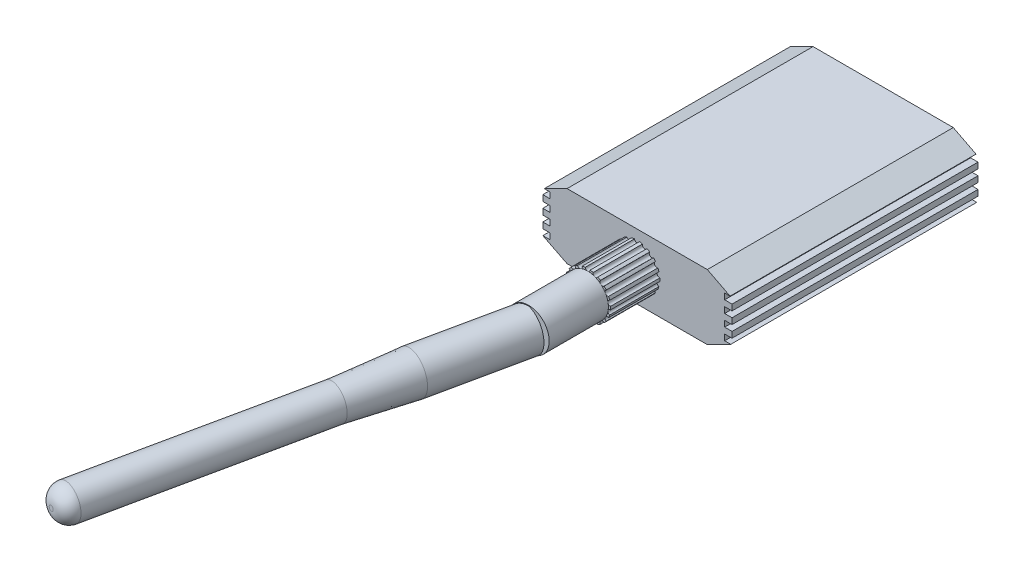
ISO-10303-21;
HEADER;
FILE_DESCRIPTION(('STEP AP214'),'2;1');
FILE_NAME('part.step','',(''),(''),'','','');
FILE_SCHEMA(('AUTOMOTIVE_DESIGN { 1 0 10303 214 1 1 1 1 }'));
ENDSEC;
DATA;
#1=APPLICATION_CONTEXT('core data for automotive mechanical design processes');
#2=APPLICATION_PROTOCOL_DEFINITION('international standard','automotive_design',2000,#1);
#3=PRODUCT_CONTEXT('',#1,'mechanical');
#4=PRODUCT('Part','Part','',(#3));
#5=PRODUCT_RELATED_PRODUCT_CATEGORY('part','',(#4));
#6=PRODUCT_DEFINITION_FORMATION('','',#4);
#7=PRODUCT_DEFINITION_CONTEXT('part definition',#1,'design');
#8=PRODUCT_DEFINITION('design','',#6,#7);
#9=PRODUCT_DEFINITION_SHAPE('','',#8);
#10=(LENGTH_UNIT() NAMED_UNIT(*) SI_UNIT(.MILLI.,.METRE.));
#11=(NAMED_UNIT(*) PLANE_ANGLE_UNIT() SI_UNIT($,.RADIAN.));
#12=(NAMED_UNIT(*) SI_UNIT($,.STERADIAN.) SOLID_ANGLE_UNIT());
#13=UNCERTAINTY_MEASURE_WITH_UNIT(LENGTH_MEASURE(1.E-05),#10,'distance_accuracy_value','');
#14=(GEOMETRIC_REPRESENTATION_CONTEXT(3) GLOBAL_UNCERTAINTY_ASSIGNED_CONTEXT((#13)) GLOBAL_UNIT_ASSIGNED_CONTEXT((#10,
#11,#12)) REPRESENTATION_CONTEXT('',''));
#15=CARTESIAN_POINT('',(0.,0.,0.));
#16=DIRECTION('',(0.,0.,1.));
#17=DIRECTION('',(1.,0.,0.));
#18=AXIS2_PLACEMENT_3D('',#15,#16,#17);
#19=CARTESIAN_POINT('',(-26.539653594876,0.,76.1238));
#20=DIRECTION('',(0.,0.,1.));
#21=DIRECTION('',(1.,0.,0.));
#22=AXIS2_PLACEMENT_3D('',#19,#20,#21);
#23=PLANE('',#22);
#24=CARTESIAN_POINT('',(-26.539653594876,0.,76.1238));
#25=DIRECTION('',(0.,0.,1.));
#26=DIRECTION('',(1.,0.,0.));
#27=AXIS2_PLACEMENT_3D('',#24,#25,#26);
#28=CIRCLE('',#27,4.445);
#29=CARTESIAN_POINT('',(-22.094653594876,0.,76.1238));
#30=VERTEX_POINT('',#29);
#31=EDGE_CURVE('E1345',#30,#30,#28,.T.);
#32=ORIENTED_EDGE('',*,*,#31,.T.);
#33=EDGE_LOOP('',(#32));
#34=FACE_BOUND('',#33,.T.);
#35=DIRECTION('',(0.,-1.,0.));
#36=VECTOR('',#35,1.);
#37=CARTESIAN_POINT('',(-26.5396535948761,0.,76.1238));
#38=LINE('',#37,#36);
#39=CARTESIAN_POINT('',(-26.5396535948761,4.29581120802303,76.1238));
#40=VERTEX_POINT('',#39);
#41=CARTESIAN_POINT('',(-26.5396535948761,-4.29581120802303,76.1238));
#42=VERTEX_POINT('',#41);
#43=EDGE_CURVE('E790',#40,#42,#38,.T.);
#44=ORIENTED_EDGE('',*,*,#43,.T.);
#45=CARTESIAN_POINT('',(-26.539653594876,0.,76.1238));
#46=DIRECTION('',(0.,0.,1.));
#47=DIRECTION('',(1.,0.,0.));
#48=AXIS2_PLACEMENT_3D('',#45,#46,#47);
#49=ELLIPSE('',#48,4.39136173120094,4.29581120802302);
#50=EDGE_CURVE('E794',#42,#40,#49,.F.);
#51=ORIENTED_EDGE('',*,*,#50,.T.);
#52=EDGE_LOOP('',(#44,#51));
#53=FACE_BOUND('',#52,.T.);
#54=ADVANCED_FACE('F31',(#34,#53),#23,.T.);
#55=CARTESIAN_POINT('',(-26.539653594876,0.,63.4238));
#56=DIRECTION('',(0.,0.,1.));
#57=DIRECTION('',(1.,0.,0.));
#58=AXIS2_PLACEMENT_3D('',#55,#56,#57);
#59=PLANE('',#58);
#60=CARTESIAN_POINT('',(-21.6994219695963,-0.853463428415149,63.4238));
#61=DIRECTION('',(0.,0.,1.));
#62=DIRECTION('',(-0.173648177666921,-0.98480775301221,0.));
#63=AXIS2_PLACEMENT_3D('',#60,#61,#62);
#64=CIRCLE('',#63,0.52562601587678);
#65=CARTESIAN_POINT('',(-22.2066246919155,-0.991405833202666,63.4238));
#66=VERTEX_POINT('',#65);
#67=CARTESIAN_POINT('',(-21.818245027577,-1.36548275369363,63.4238));
#68=VERTEX_POINT('',#67);
#69=EDGE_CURVE('E1257',#66,#68,#64,.T.);
#70=ORIENTED_EDGE('',*,*,#69,.F.);
#71=CARTESIAN_POINT('',(-26.539653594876,0.,63.4238));
#72=DIRECTION('',(0.,0.,1.));
#73=DIRECTION('',(1.,0.,0.));
#74=AXIS2_PLACEMENT_3D('',#71,#72,#73);
#75=CIRCLE('',#74,4.445);
#76=CARTESIAN_POINT('',(-22.5830974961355,-2.02575636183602,63.4238));
#77=VERTEX_POINT('',#76);
#78=EDGE_CURVE('E3387',#77,#66,#75,.T.);
#79=ORIENTED_EDGE('',*,*,#78,.F.);
#80=CARTESIAN_POINT('',(-22.2832253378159,-2.45744999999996,63.4238));
#81=DIRECTION('',(0.,0.,1.));
#82=DIRECTION('',(-0.499999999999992,-0.866025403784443,0.));
#83=AXIS2_PLACEMENT_3D('',#80,#81,#82);
#84=CIRCLE('',#83,0.52562601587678);
#85=CARTESIAN_POINT('',(-22.0451294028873,-1.98884245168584,63.4238));
#86=VERTEX_POINT('',#85);
#87=EDGE_CURVE('E1241',#86,#77,#84,.T.);
#88=ORIENTED_EDGE('',*,*,#87,.F.);
#89=CARTESIAN_POINT('',(-26.539653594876,0.,63.4238));
#90=DIRECTION('',(0.,0.,1.));
#91=DIRECTION('',(1.,0.,0.));
#92=AXIS2_PLACEMENT_3D('',#89,#90,#91);
#93=CIRCLE('',#92,4.9149);
#94=EDGE_CURVE('E3191',#86,#68,#93,.T.);
#95=ORIENTED_EDGE('',*,*,#94,.T.);
#96=EDGE_LOOP('',(#70,#79,#88,#95));
#97=FACE_BOUND('',#96,.T.);
#98=ADVANCED_FACE('F1631',(#97),#59,.T.);
#99=CARTESIAN_POINT('',(-22.8070190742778,-2.41359991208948,63.4238));
#100=VERTEX_POINT('',#99);
#101=CARTESIAN_POINT('',(-22.5700034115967,-2.89795090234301,63.4238));
#102=VERTEX_POINT('',#101);
#103=EDGE_CURVE('E1244',#100,#102,#84,.T.);
#104=ORIENTED_EDGE('',*,*,#103,.F.);
#105=CARTESIAN_POINT('',(-23.5145565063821,-3.2568101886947,63.4238));
#106=VERTEX_POINT('',#105);
#107=EDGE_CURVE('E3382',#106,#100,#75,.T.);
#108=ORIENTED_EDGE('',*,*,#107,.F.);
#109=CARTESIAN_POINT('',(-23.3804167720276,-3.76503183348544,63.4238));
#110=DIRECTION('',(0.,0.,1.));
#111=DIRECTION('',(-0.766044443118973,-0.642787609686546,0.));
#112=AXIS2_PLACEMENT_3D('',#109,#110,#111);
#113=CIRCLE('',#112,0.52562601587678);
#114=CARTESIAN_POINT('',(-22.9964065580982,-3.40611838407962,63.4238));
#115=VERTEX_POINT('',#114);
#116=EDGE_CURVE('E1228',#115,#106,#113,.T.);
#117=ORIENTED_EDGE('',*,*,#116,.F.);
#118=EDGE_CURVE('E3196',#115,#102,#93,.T.);
#119=ORIENTED_EDGE('',*,*,#118,.T.);
#120=EDGE_LOOP('',(#104,#108,#117,#119));
#121=FACE_BOUND('',#120,.T.);
#122=ADVANCED_FACE('F1637',(#121),#59,.T.);
#123=CARTESIAN_POINT('',(-23.8576242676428,-3.54467822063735,63.4238));
#124=VERTEX_POINT('',#123);
#125=CARTESIAN_POINT('',(-23.8005601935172,-4.08088340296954,63.4238));
#126=VERTEX_POINT('',#125);
#127=EDGE_CURVE('E1231',#124,#126,#113,.T.);
#128=ORIENTED_EDGE('',*,*,#127,.F.);
#129=CARTESIAN_POINT('',(-24.8108868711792,-4.09504464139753,63.4238));
#130=VERTEX_POINT('',#129);
#131=EDGE_CURVE('E3377',#130,#124,#75,.T.);
#132=ORIENTED_EDGE('',*,*,#131,.F.);
#133=CARTESIAN_POINT('',(-24.8586587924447,-4.61849526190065,63.4238));
#134=DIRECTION('',(0.,0.,1.));
#135=DIRECTION('',(-0.939692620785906,-0.342020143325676,0.));
#136=AXIS2_PLACEMENT_3D('',#133,#134,#135);
#137=CIRCLE('',#136,0.52562601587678);
#138=CARTESIAN_POINT('',(-24.3750515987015,-4.41256617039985,63.4238));
#139=VERTEX_POINT('',#138);
#140=EDGE_CURVE('E1215',#139,#130,#137,.T.);
#141=ORIENTED_EDGE('',*,*,#140,.F.);
#142=EDGE_CURVE('E3201',#139,#126,#93,.T.);
#143=ORIENTED_EDGE('',*,*,#142,.T.);
#144=EDGE_LOOP('',(#128,#132,#141,#143));
#145=FACE_BOUND('',#144,.T.);
#146=ADVANCED_FACE('F2171',(#145),#59,.T.);
#147=CARTESIAN_POINT('',(-25.2317217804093,-4.2482160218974,63.4238));
#148=VERTEX_POINT('',#147);
#149=CARTESIAN_POINT('',(-25.3614920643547,-4.77160113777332,63.4238));
#150=VERTEX_POINT('',#149);
#151=EDGE_CURVE('E1218',#148,#150,#137,.T.);
#152=ORIENTED_EDGE('',*,*,#151,.F.);
#153=CARTESIAN_POINT('',(-26.3157320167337,-4.43935627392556,63.4238));
#154=VERTEX_POINT('',#153);
#155=EDGE_CURVE('E3372',#154,#148,#75,.T.);
#156=ORIENTED_EDGE('',*,*,#155,.F.);
#157=CARTESIAN_POINT('',(-26.539653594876,-4.9149,63.4238));
#158=DIRECTION('',(0.,0.,1.));
#159=DIRECTION('',(-1.,0.,0.));
#160=AXIS2_PLACEMENT_3D('',#157,#158,#159);
#161=CIRCLE('',#160,0.52562601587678);
#162=CARTESIAN_POINT('',(-26.0147795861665,-4.88679335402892,63.4238));
#163=VERTEX_POINT('',#162);
#164=EDGE_CURVE('E1202',#163,#154,#161,.T.);
#165=ORIENTED_EDGE('',*,*,#164,.F.);
#166=EDGE_CURVE('E3206',#163,#150,#93,.T.);
#167=ORIENTED_EDGE('',*,*,#166,.T.);
#168=EDGE_LOOP('',(#152,#156,#165,#167));
#169=FACE_BOUND('',#168,.T.);
#170=ADVANCED_FACE('F2180',(#169),#59,.T.);
#171=CARTESIAN_POINT('',(-26.7635751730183,-4.43935627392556,63.4238));
#172=VERTEX_POINT('',#171);
#173=CARTESIAN_POINT('',(-27.0645276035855,-4.88679335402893,63.4238));
#174=VERTEX_POINT('',#173);
#175=EDGE_CURVE('E1205',#172,#174,#161,.T.);
#176=ORIENTED_EDGE('',*,*,#175,.F.);
#177=CARTESIAN_POINT('',(-27.8475854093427,-4.24821602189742,63.4238));
#178=VERTEX_POINT('',#177);
#179=EDGE_CURVE('E3367',#178,#172,#75,.T.);
#180=ORIENTED_EDGE('',*,*,#179,.F.);
#181=CARTESIAN_POINT('',(-28.2206483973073,-4.61849526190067,63.4238));
#182=DIRECTION('',(0.,0.,1.));
#183=DIRECTION('',(-0.939692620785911,0.342020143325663,0.));
#184=AXIS2_PLACEMENT_3D('',#181,#182,#183);
#185=CIRCLE('',#184,0.52562601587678);
#186=CARTESIAN_POINT('',(-27.7178151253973,-4.77160113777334,63.4238));
#187=VERTEX_POINT('',#186);
#188=EDGE_CURVE('E1189',#187,#178,#185,.T.);
#189=ORIENTED_EDGE('',*,*,#188,.F.);
#190=EDGE_CURVE('E3211',#187,#174,#93,.T.);
#191=ORIENTED_EDGE('',*,*,#190,.T.);
#192=EDGE_LOOP('',(#176,#180,#189,#191));
#193=FACE_BOUND('',#192,.T.);
#194=ADVANCED_FACE('F2189',(#193),#59,.T.);
#195=CARTESIAN_POINT('',(-28.2684203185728,-4.09504464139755,63.4238));
#196=VERTEX_POINT('',#195);
#197=CARTESIAN_POINT('',(-28.7042555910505,-4.41256617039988,63.4238));
#198=VERTEX_POINT('',#197);
#199=EDGE_CURVE('E1192',#196,#198,#185,.T.);
#200=ORIENTED_EDGE('',*,*,#199,.F.);
#201=CARTESIAN_POINT('',(-29.2216829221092,-3.54467822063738,63.4238));
#202=VERTEX_POINT('',#201);
#203=EDGE_CURVE('E3362',#202,#196,#75,.T.);
#204=ORIENTED_EDGE('',*,*,#203,.F.);
#205=CARTESIAN_POINT('',(-29.6988904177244,-3.76503183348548,63.4238));
#206=DIRECTION('',(0.,0.,1.));
#207=DIRECTION('',(-0.766044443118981,0.642787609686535,0.));
#208=AXIS2_PLACEMENT_3D('',#205,#206,#207);
#209=CIRCLE('',#208,0.52562601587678);
#210=CARTESIAN_POINT('',(-29.2787469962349,-4.08088340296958,63.4238));
#211=VERTEX_POINT('',#210);
#212=EDGE_CURVE('E1176',#211,#202,#209,.T.);
#213=ORIENTED_EDGE('',*,*,#212,.F.);
#214=EDGE_CURVE('E3216',#211,#198,#93,.T.);
#215=ORIENTED_EDGE('',*,*,#214,.T.);
#216=EDGE_LOOP('',(#200,#204,#213,#215));
#217=FACE_BOUND('',#216,.T.);
#218=ADVANCED_FACE('F2198',(#217),#59,.T.);
#219=CARTESIAN_POINT('',(-29.5647506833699,-3.25681018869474,63.4238));
#220=VERTEX_POINT('',#219);
#221=CARTESIAN_POINT('',(-30.0829006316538,-3.40611838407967,63.4238));
#222=VERTEX_POINT('',#221);
#223=EDGE_CURVE('E1179',#220,#222,#209,.T.);
#224=ORIENTED_EDGE('',*,*,#223,.F.);
#225=CARTESIAN_POINT('',(-30.2722881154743,-2.41359991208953,63.4238));
#226=VERTEX_POINT('',#225);
#227=EDGE_CURVE('E3357',#226,#220,#75,.T.);
#228=ORIENTED_EDGE('',*,*,#227,.F.);
#229=CARTESIAN_POINT('',(-30.7960818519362,-2.45745000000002,63.4238));
#230=DIRECTION('',(0.,0.,1.));
#231=DIRECTION('',(-0.500000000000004,0.866025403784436,0.));
#232=AXIS2_PLACEMENT_3D('',#229,#230,#231);
#233=CIRCLE('',#232,0.52562601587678);
#234=CARTESIAN_POINT('',(-30.5093037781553,-2.89795090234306,63.4238));
#235=VERTEX_POINT('',#234);
#236=EDGE_CURVE('E1163',#235,#226,#233,.T.);
#237=ORIENTED_EDGE('',*,*,#236,.F.);
#238=EDGE_CURVE('E3221',#235,#222,#93,.T.);
#239=ORIENTED_EDGE('',*,*,#238,.T.);
#240=EDGE_LOOP('',(#224,#228,#237,#239));
#241=FACE_BOUND('',#240,.T.);
#242=ADVANCED_FACE('F2207',(#241),#59,.T.);
#243=CARTESIAN_POINT('',(-30.4962096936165,-2.02575636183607,63.4238));
#244=VERTEX_POINT('',#243);
#245=CARTESIAN_POINT('',(-31.0341777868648,-1.9888424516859,63.4238));
#246=VERTEX_POINT('',#245);
#247=EDGE_CURVE('E1166',#244,#246,#233,.T.);
#248=ORIENTED_EDGE('',*,*,#247,.F.);
#249=CARTESIAN_POINT('',(-30.8726824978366,-0.991405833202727,63.4238));
#250=VERTEX_POINT('',#249);
#251=EDGE_CURVE('E3352',#250,#244,#75,.T.);
#252=ORIENTED_EDGE('',*,*,#251,.F.);
#253=CARTESIAN_POINT('',(-31.3798852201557,-0.853463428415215,63.4238));
#254=DIRECTION('',(0.,0.,1.));
#255=DIRECTION('',(-0.173648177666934,0.984807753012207,0.));
#256=AXIS2_PLACEMENT_3D('',#253,#254,#255);
#257=CIRCLE('',#256,0.52562601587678);
#258=CARTESIAN_POINT('',(-31.2610621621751,-1.3654827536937,63.4238));
#259=VERTEX_POINT('',#258);
#260=EDGE_CURVE('E1150',#259,#250,#257,.T.);
#261=ORIENTED_EDGE('',*,*,#260,.F.);
#262=EDGE_CURVE('E3226',#259,#246,#93,.T.);
#263=ORIENTED_EDGE('',*,*,#262,.T.);
#264=EDGE_LOOP('',(#248,#252,#261,#263));
#265=FACE_BOUND('',#264,.T.);
#266=ADVANCED_FACE('F2216',(#265),#59,.T.);
#267=CARTESIAN_POINT('',(-30.950449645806,-0.550366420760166,63.4238));
#268=VERTEX_POINT('',#267);
#269=CARTESIAN_POINT('',(-31.4433489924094,-0.331682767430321,63.4238));
#270=VERTEX_POINT('',#269);
#271=EDGE_CURVE('E1153',#268,#270,#257,.T.);
#272=ORIENTED_EDGE('',*,*,#271,.F.);
#273=CARTESIAN_POINT('',(-30.950449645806,0.550366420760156,63.4238));
#274=VERTEX_POINT('',#273);
#275=EDGE_CURVE('E3347',#274,#268,#75,.T.);
#276=ORIENTED_EDGE('',*,*,#275,.F.);
#277=CARTESIAN_POINT('',(-31.3798852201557,0.853463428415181,63.4238));
#278=DIRECTION('',(0.,0.,1.));
#279=DIRECTION('',(0.173648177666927,0.984807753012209,0.));
#280=AXIS2_PLACEMENT_3D('',#277,#278,#279);
#281=CIRCLE('',#280,0.52562601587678);
#282=CARTESIAN_POINT('',(-31.4433489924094,0.33168276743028,63.4238));
#283=VERTEX_POINT('',#282);
#284=EDGE_CURVE('E1137',#283,#274,#281,.T.);
#285=ORIENTED_EDGE('',*,*,#284,.F.);
#286=EDGE_CURVE('E3231',#283,#270,#93,.T.);
#287=ORIENTED_EDGE('',*,*,#286,.T.);
#288=EDGE_LOOP('',(#272,#276,#285,#287));
#289=FACE_BOUND('',#288,.T.);
#290=ADVANCED_FACE('F2225',(#289),#59,.T.);
#291=CARTESIAN_POINT('',(-30.8726824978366,0.991405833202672,63.4238));
#292=VERTEX_POINT('',#291);
#293=CARTESIAN_POINT('',(-31.2610621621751,1.36548275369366,63.4238));
#294=VERTEX_POINT('',#293);
#295=EDGE_CURVE('E1140',#292,#294,#281,.T.);
#296=ORIENTED_EDGE('',*,*,#295,.F.);
#297=CARTESIAN_POINT('',(-30.4962096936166,2.02575636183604,63.4238));
#298=VERTEX_POINT('',#297);
#299=EDGE_CURVE('E3342',#298,#292,#75,.T.);
#300=ORIENTED_EDGE('',*,*,#299,.F.);
#301=CARTESIAN_POINT('',(-30.7960818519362,2.45744999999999,63.4238));
#302=DIRECTION('',(0.,0.,1.));
#303=DIRECTION('',(0.499999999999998,0.86602540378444,0.));
#304=AXIS2_PLACEMENT_3D('',#301,#302,#303);
#305=CIRCLE('',#304,0.52562601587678);
#306=CARTESIAN_POINT('',(-31.0341777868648,1.98884245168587,63.4238));
#307=VERTEX_POINT('',#306);
#308=EDGE_CURVE('E1124',#307,#298,#305,.T.);
#309=ORIENTED_EDGE('',*,*,#308,.F.);
#310=EDGE_CURVE('E3236',#307,#294,#93,.T.);
#311=ORIENTED_EDGE('',*,*,#310,.T.);
#312=EDGE_LOOP('',(#296,#300,#309,#311));
#313=FACE_BOUND('',#312,.T.);
#314=ADVANCED_FACE('F2234',(#313),#59,.T.);
#315=CARTESIAN_POINT('',(-30.2722881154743,2.4135999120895,63.4238));
#316=VERTEX_POINT('',#315);
#317=CARTESIAN_POINT('',(-30.5093037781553,2.89795090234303,63.4238));
#318=VERTEX_POINT('',#317);
#319=EDGE_CURVE('E1127',#316,#318,#305,.T.);
#320=ORIENTED_EDGE('',*,*,#319,.F.);
#321=CARTESIAN_POINT('',(-29.5647506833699,3.25681018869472,63.4238));
#322=VERTEX_POINT('',#321);
#323=EDGE_CURVE('E3337',#322,#316,#75,.T.);
#324=ORIENTED_EDGE('',*,*,#323,.F.);
#325=CARTESIAN_POINT('',(-29.6988904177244,3.76503183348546,63.4238));
#326=DIRECTION('',(0.,0.,1.));
#327=DIRECTION('',(0.766044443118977,0.642787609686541,0.));
#328=AXIS2_PLACEMENT_3D('',#325,#326,#327);
#329=CIRCLE('',#328,0.52562601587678);
#330=CARTESIAN_POINT('',(-30.0829006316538,3.40611838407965,63.4238));
#331=VERTEX_POINT('',#330);
#332=EDGE_CURVE('E1111',#331,#322,#329,.T.);
#333=ORIENTED_EDGE('',*,*,#332,.F.);
#334=EDGE_CURVE('E3241',#331,#318,#93,.T.);
#335=ORIENTED_EDGE('',*,*,#334,.T.);
#336=EDGE_LOOP('',(#320,#324,#333,#335));
#337=FACE_BOUND('',#336,.T.);
#338=ADVANCED_FACE('F2243',(#337),#59,.T.);
#339=CARTESIAN_POINT('',(-29.2216829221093,3.54467822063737,63.4238));
#340=VERTEX_POINT('',#339);
#341=CARTESIAN_POINT('',(-29.2787469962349,4.08088340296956,63.4238));
#342=VERTEX_POINT('',#341);
#343=EDGE_CURVE('E1114',#340,#342,#329,.T.);
#344=ORIENTED_EDGE('',*,*,#343,.F.);
#345=CARTESIAN_POINT('',(-28.2684203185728,4.09504464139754,63.4238));
#346=VERTEX_POINT('',#345);
#347=EDGE_CURVE('E3333',#346,#340,#75,.T.);
#348=ORIENTED_EDGE('',*,*,#347,.F.);
#349=CARTESIAN_POINT('',(-28.2206483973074,4.61849526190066,63.4238));
#350=DIRECTION('',(0.,0.,1.));
#351=DIRECTION('',(0.939692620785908,0.342020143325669,0.));
#352=AXIS2_PLACEMENT_3D('',#349,#350,#351);
#353=CIRCLE('',#352,0.52562601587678);
#354=CARTESIAN_POINT('',(-28.7042555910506,4.41256617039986,63.4238));
#355=VERTEX_POINT('',#354);
#356=EDGE_CURVE('E1098',#355,#346,#353,.T.);
#357=ORIENTED_EDGE('',*,*,#356,.F.);
#358=EDGE_CURVE('E1069',#355,#342,#93,.T.);
#359=ORIENTED_EDGE('',*,*,#358,.T.);
#360=EDGE_LOOP('',(#344,#348,#357,#359));
#361=FACE_BOUND('',#360,.T.);
#362=ADVANCED_FACE('F2252',(#361),#59,.T.);
#363=CARTESIAN_POINT('',(-27.8475854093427,4.24821602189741,63.4238));
#364=VERTEX_POINT('',#363);
#365=CARTESIAN_POINT('',(-27.7178151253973,4.77160113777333,63.4238));
#366=VERTEX_POINT('',#365);
#367=EDGE_CURVE('E1101',#364,#366,#353,.T.);
#368=ORIENTED_EDGE('',*,*,#367,.F.);
#369=CARTESIAN_POINT('',(-26.7635751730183,4.43935627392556,63.4238));
#370=VERTEX_POINT('',#369);
#371=EDGE_CURVE('E3327',#370,#364,#75,.T.);
#372=ORIENTED_EDGE('',*,*,#371,.F.);
#373=CARTESIAN_POINT('',(-26.539653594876,4.9149,63.4238));
#374=DIRECTION('',(0.,0.,1.));
#375=DIRECTION('',(1.,0.,0.));
#376=AXIS2_PLACEMENT_3D('',#373,#374,#375);
#377=CIRCLE('',#376,0.52562601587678);
#378=CARTESIAN_POINT('',(-27.0645276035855,4.88679335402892,63.4238));
#379=VERTEX_POINT('',#378);
#380=EDGE_CURVE('E1085',#379,#370,#377,.T.);
#381=ORIENTED_EDGE('',*,*,#380,.F.);
#382=EDGE_CURVE('E1066',#379,#366,#93,.T.);
#383=ORIENTED_EDGE('',*,*,#382,.T.);
#384=EDGE_LOOP('',(#368,#372,#381,#383));
#385=FACE_BOUND('',#384,.T.);
#386=ADVANCED_FACE('F2261',(#385),#59,.T.);
#387=CARTESIAN_POINT('',(-26.3157320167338,4.43935627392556,63.4238));
#388=VERTEX_POINT('',#387);
#389=CARTESIAN_POINT('',(-26.0147795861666,4.88679335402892,63.4238));
#390=VERTEX_POINT('',#389);
#391=EDGE_CURVE('E1088',#388,#390,#377,.T.);
#392=ORIENTED_EDGE('',*,*,#391,.F.);
#393=CARTESIAN_POINT('',(-25.2317217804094,4.24821602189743,63.4238));
#394=VERTEX_POINT('',#393);
#395=EDGE_CURVE('E3167',#394,#388,#75,.T.);
#396=ORIENTED_EDGE('',*,*,#395,.F.);
#397=CARTESIAN_POINT('',(-24.8586587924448,4.61849526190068,63.4238));
#398=DIRECTION('',(0.,0.,1.));
#399=DIRECTION('',(0.939692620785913,-0.342020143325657,0.));
#400=AXIS2_PLACEMENT_3D('',#397,#398,#399);
#401=CIRCLE('',#400,0.52562601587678);
#402=CARTESIAN_POINT('',(-25.3614920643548,4.77160113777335,63.4238));
#403=VERTEX_POINT('',#402);
#404=EDGE_CURVE('E1306',#403,#394,#401,.T.);
#405=ORIENTED_EDGE('',*,*,#404,.F.);
#406=EDGE_CURVE('E1070',#403,#390,#93,.T.);
#407=ORIENTED_EDGE('',*,*,#406,.T.);
#408=EDGE_LOOP('',(#392,#396,#405,#407));
#409=FACE_BOUND('',#408,.T.);
#410=ADVANCED_FACE('F2270',(#409),#59,.T.);
#411=CARTESIAN_POINT('',(-24.8108868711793,4.09504464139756,63.4238));
#412=VERTEX_POINT('',#411);
#413=CARTESIAN_POINT('',(-24.3750515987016,4.41256617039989,63.4238));
#414=VERTEX_POINT('',#413);
#415=EDGE_CURVE('E1310',#412,#414,#401,.T.);
#416=ORIENTED_EDGE('',*,*,#415,.F.);
#417=CARTESIAN_POINT('',(-23.8576242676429,3.5446782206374,63.4238));
#418=VERTEX_POINT('',#417);
#419=EDGE_CURVE('E3166',#418,#412,#75,.T.);
#420=ORIENTED_EDGE('',*,*,#419,.F.);
#421=CARTESIAN_POINT('',(-23.3804167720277,3.76503183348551,63.4238));
#422=DIRECTION('',(0.,0.,1.));
#423=DIRECTION('',(0.766044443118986,-0.64278760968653,0.));
#424=AXIS2_PLACEMENT_3D('',#421,#422,#423);
#425=CIRCLE('',#424,0.52562601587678);
#426=CARTESIAN_POINT('',(-23.8005601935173,4.0808834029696,63.4238));
#427=VERTEX_POINT('',#426);
#428=EDGE_CURVE('E1293',#427,#418,#425,.T.);
#429=ORIENTED_EDGE('',*,*,#428,.F.);
#430=EDGE_CURVE('E3172',#427,#414,#93,.T.);
#431=ORIENTED_EDGE('',*,*,#430,.T.);
#432=EDGE_LOOP('',(#416,#420,#429,#431));
#433=FACE_BOUND('',#432,.T.);
#434=ADVANCED_FACE('F2279',(#433),#59,.T.);
#435=CARTESIAN_POINT('',(-23.5145565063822,3.25681018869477,63.4238));
#436=VERTEX_POINT('',#435);
#437=CARTESIAN_POINT('',(-22.9964065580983,3.4061183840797,63.4238));
#438=VERTEX_POINT('',#437);
#439=EDGE_CURVE('E1296',#436,#438,#425,.T.);
#440=ORIENTED_EDGE('',*,*,#439,.F.);
#441=CARTESIAN_POINT('',(-22.8070190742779,2.41359991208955,63.4238));
#442=VERTEX_POINT('',#441);
#443=EDGE_CURVE('E3533',#442,#436,#75,.T.);
#444=ORIENTED_EDGE('',*,*,#443,.F.);
#445=CARTESIAN_POINT('',(-22.2832253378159,2.45745000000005,63.4238));
#446=DIRECTION('',(0.,0.,1.));
#447=DIRECTION('',(0.50000000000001,-0.866025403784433,0.));
#448=AXIS2_PLACEMENT_3D('',#445,#446,#447);
#449=CIRCLE('',#448,0.52562601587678);
#450=CARTESIAN_POINT('',(-22.5700034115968,2.89795090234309,63.4238));
#451=VERTEX_POINT('',#450);
#452=EDGE_CURVE('E1280',#451,#442,#449,.T.);
#453=ORIENTED_EDGE('',*,*,#452,.F.);
#454=EDGE_CURVE('E3179',#451,#438,#93,.T.);
#455=ORIENTED_EDGE('',*,*,#454,.T.);
#456=EDGE_LOOP('',(#440,#444,#453,#455));
#457=FACE_BOUND('',#456,.T.);
#458=ADVANCED_FACE('F2288',(#457),#59,.T.);
#459=CARTESIAN_POINT('',(-22.5830974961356,2.0257563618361,63.4238));
#460=VERTEX_POINT('',#459);
#461=CARTESIAN_POINT('',(-22.0451294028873,1.98884245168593,63.4238));
#462=VERTEX_POINT('',#461);
#463=EDGE_CURVE('E1283',#460,#462,#449,.T.);
#464=ORIENTED_EDGE('',*,*,#463,.F.);
#465=CARTESIAN_POINT('',(-22.2066246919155,0.991405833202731,63.4238));
#466=VERTEX_POINT('',#465);
#467=EDGE_CURVE('E1351',#466,#460,#75,.T.);
#468=ORIENTED_EDGE('',*,*,#467,.F.);
#469=CARTESIAN_POINT('',(-21.6994219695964,0.853463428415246,63.4238));
#470=DIRECTION('',(0.,0.,1.));
#471=DIRECTION('',(0.17364817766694,-0.984807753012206,0.));
#472=AXIS2_PLACEMENT_3D('',#469,#470,#471);
#473=CIRCLE('',#472,0.52562601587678);
#474=CARTESIAN_POINT('',(-21.818245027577,1.36548275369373,63.4238));
#475=VERTEX_POINT('',#474);
#476=EDGE_CURVE('E1267',#475,#466,#473,.T.);
#477=ORIENTED_EDGE('',*,*,#476,.F.);
#478=EDGE_CURVE('E3181',#475,#462,#93,.T.);
#479=ORIENTED_EDGE('',*,*,#478,.T.);
#480=EDGE_LOOP('',(#464,#468,#477,#479));
#481=FACE_BOUND('',#480,.T.);
#482=ADVANCED_FACE('F2297',(#481),#59,.T.);
#483=CARTESIAN_POINT('',(-22.1288575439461,0.550366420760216,63.4238));
#484=VERTEX_POINT('',#483);
#485=CARTESIAN_POINT('',(-21.6359581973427,0.331682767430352,63.4238));
#486=VERTEX_POINT('',#485);
#487=EDGE_CURVE('E1270',#484,#486,#473,.T.);
#488=ORIENTED_EDGE('',*,*,#487,.F.);
#489=CARTESIAN_POINT('',(-22.128857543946,-0.550366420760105,63.4238));
#490=VERTEX_POINT('',#489);
#491=EDGE_CURVE('E1352',#490,#484,#75,.T.);
#492=ORIENTED_EDGE('',*,*,#491,.F.);
#493=CARTESIAN_POINT('',(-21.6359581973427,-0.33168276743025,63.4238));
#494=VERTEX_POINT('',#493);
#495=EDGE_CURVE('E1254',#494,#490,#64,.T.);
#496=ORIENTED_EDGE('',*,*,#495,.F.);
#497=EDGE_CURVE('E3186',#494,#486,#93,.T.);
#498=ORIENTED_EDGE('',*,*,#497,.T.);
#499=EDGE_LOOP('',(#488,#492,#496,#498));
#500=FACE_BOUND('',#499,.T.);
#501=ADVANCED_FACE('F1640',(#500),#59,.T.);
#502=CARTESIAN_POINT('',(-26.539653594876,0.,63.4238));
#503=DIRECTION('',(0.,0.,-1.));
#504=DIRECTION('',(-1.,0.,0.));
#505=AXIS2_PLACEMENT_3D('',#502,#503,#504);
#506=CYLINDRICAL_SURFACE('',#505,4.9149);
#507=CARTESIAN_POINT('',(-26.539653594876,0.,52.832));
#508=DIRECTION('',(0.,0.,1.));
#509=DIRECTION('',(1.,0.,0.));
#510=AXIS2_PLACEMENT_3D('',#507,#508,#509);
#511=CIRCLE('',#510,4.9149);
#512=CARTESIAN_POINT('',(-23.8005601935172,4.0808834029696,52.832));
#513=VERTEX_POINT('',#512);
#514=CARTESIAN_POINT('',(-24.3750515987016,4.41256617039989,52.832));
#515=VERTEX_POINT('',#514);
#516=EDGE_CURVE('E3313',#513,#515,#511,.T.);
#517=ORIENTED_EDGE('',*,*,#516,.T.);
#518=DIRECTION('',(0.,0.,1.));
#519=VECTOR('',#518,1.);
#520=CARTESIAN_POINT('',(-24.3750515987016,4.41256617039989,58.1279));
#521=LINE('',#520,#519);
#522=EDGE_CURVE('E1297',#515,#414,#521,.T.);
#523=ORIENTED_EDGE('',*,*,#522,.T.);
#524=ORIENTED_EDGE('',*,*,#430,.F.);
#525=DIRECTION('',(0.,0.,1.));
#526=VECTOR('',#525,1.);
#527=CARTESIAN_POINT('',(-23.8005601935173,4.0808834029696,58.1279));
#528=LINE('',#527,#526);
#529=EDGE_CURVE('E1287',#427,#513,#528,.F.);
#530=ORIENTED_EDGE('',*,*,#529,.T.);
#531=EDGE_LOOP('',(#517,#523,#524,#530));
#532=FACE_BOUND('',#531,.T.);
#533=ADVANCED_FACE('F1728',(#532),#506,.T.);
#534=CARTESIAN_POINT('',(-22.5700034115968,2.89795090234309,52.832));
#535=VERTEX_POINT('',#534);
#536=CARTESIAN_POINT('',(-22.9964065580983,3.4061183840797,52.832));
#537=VERTEX_POINT('',#536);
#538=EDGE_CURVE('E3309',#535,#537,#511,.T.);
#539=ORIENTED_EDGE('',*,*,#538,.T.);
#540=DIRECTION('',(0.,0.,1.));
#541=VECTOR('',#540,1.);
#542=CARTESIAN_POINT('',(-22.9964065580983,3.4061183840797,58.1279));
#543=LINE('',#542,#541);
#544=EDGE_CURVE('E1284',#537,#438,#543,.T.);
#545=ORIENTED_EDGE('',*,*,#544,.T.);
#546=ORIENTED_EDGE('',*,*,#454,.F.);
#547=DIRECTION('',(0.,0.,1.));
#548=VECTOR('',#547,1.);
#549=CARTESIAN_POINT('',(-22.5700034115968,2.89795090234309,58.1279));
#550=LINE('',#549,#548);
#551=EDGE_CURVE('E1274',#451,#535,#550,.F.);
#552=ORIENTED_EDGE('',*,*,#551,.T.);
#553=EDGE_LOOP('',(#539,#545,#546,#552));
#554=FACE_BOUND('',#553,.T.);
#555=ADVANCED_FACE('F3399',(#554),#506,.T.);
#556=CARTESIAN_POINT('',(-21.818245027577,1.36548275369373,52.832));
#557=VERTEX_POINT('',#556);
#558=CARTESIAN_POINT('',(-22.0451294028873,1.98884245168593,52.832));
#559=VERTEX_POINT('',#558);
#560=EDGE_CURVE('E3305',#557,#559,#511,.T.);
#561=ORIENTED_EDGE('',*,*,#560,.T.);
#562=DIRECTION('',(0.,0.,1.));
#563=VECTOR('',#562,1.);
#564=CARTESIAN_POINT('',(-22.0451294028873,1.98884245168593,58.1279));
#565=LINE('',#564,#563);
#566=EDGE_CURVE('E1271',#559,#462,#565,.T.);
#567=ORIENTED_EDGE('',*,*,#566,.T.);
#568=ORIENTED_EDGE('',*,*,#478,.F.);
#569=DIRECTION('',(0.,0.,1.));
#570=VECTOR('',#569,1.);
#571=CARTESIAN_POINT('',(-21.818245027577,1.36548275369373,58.1279));
#572=LINE('',#571,#570);
#573=EDGE_CURVE('E1261',#475,#557,#572,.F.);
#574=ORIENTED_EDGE('',*,*,#573,.T.);
#575=EDGE_LOOP('',(#561,#567,#568,#574));
#576=FACE_BOUND('',#575,.T.);
#577=ADVANCED_FACE('F3397',(#576),#506,.T.);
#578=CARTESIAN_POINT('',(-21.6359581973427,-0.331682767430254,52.832));
#579=VERTEX_POINT('',#578);
#580=CARTESIAN_POINT('',(-21.6359581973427,0.331682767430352,52.832));
#581=VERTEX_POINT('',#580);
#582=EDGE_CURVE('E3301',#579,#581,#511,.T.);
#583=ORIENTED_EDGE('',*,*,#582,.T.);
#584=DIRECTION('',(0.,0.,1.));
#585=VECTOR('',#584,1.);
#586=CARTESIAN_POINT('',(-21.6359581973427,0.331682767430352,58.1279));
#587=LINE('',#586,#585);
#588=EDGE_CURVE('E1258',#581,#486,#587,.T.);
#589=ORIENTED_EDGE('',*,*,#588,.T.);
#590=ORIENTED_EDGE('',*,*,#497,.F.);
#591=DIRECTION('',(0.,0.,1.));
#592=VECTOR('',#591,1.);
#593=CARTESIAN_POINT('',(-21.6359581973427,-0.331682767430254,58.1279));
#594=LINE('',#593,#592);
#595=EDGE_CURVE('E1248',#494,#579,#594,.F.);
#596=ORIENTED_EDGE('',*,*,#595,.T.);
#597=EDGE_LOOP('',(#583,#589,#590,#596));
#598=FACE_BOUND('',#597,.T.);
#599=ADVANCED_FACE('F3405',(#598),#506,.T.);
#600=CARTESIAN_POINT('',(-22.0451294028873,-1.98884245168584,52.832));
#601=VERTEX_POINT('',#600);
#602=CARTESIAN_POINT('',(-21.818245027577,-1.36548275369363,52.832));
#603=VERTEX_POINT('',#602);
#604=EDGE_CURVE('E3297',#601,#603,#511,.T.);
#605=ORIENTED_EDGE('',*,*,#604,.T.);
#606=DIRECTION('',(0.,0.,1.));
#607=VECTOR('',#606,1.);
#608=CARTESIAN_POINT('',(-21.818245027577,-1.36548275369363,58.1279));
#609=LINE('',#608,#607);
#610=EDGE_CURVE('E1245',#603,#68,#609,.T.);
#611=ORIENTED_EDGE('',*,*,#610,.T.);
#612=ORIENTED_EDGE('',*,*,#94,.F.);
#613=DIRECTION('',(0.,0.,1.));
#614=VECTOR('',#613,1.);
#615=CARTESIAN_POINT('',(-22.0451294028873,-1.98884245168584,58.1279));
#616=LINE('',#615,#614);
#617=EDGE_CURVE('E1235',#86,#601,#616,.F.);
#618=ORIENTED_EDGE('',*,*,#617,.T.);
#619=EDGE_LOOP('',(#605,#611,#612,#618));
#620=FACE_BOUND('',#619,.T.);
#621=ADVANCED_FACE('F3409',(#620),#506,.T.);
#622=CARTESIAN_POINT('',(-22.9964065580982,-3.40611838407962,52.832));
#623=VERTEX_POINT('',#622);
#624=CARTESIAN_POINT('',(-22.5700034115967,-2.89795090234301,52.832));
#625=VERTEX_POINT('',#624);
#626=EDGE_CURVE('E3293',#623,#625,#511,.T.);
#627=ORIENTED_EDGE('',*,*,#626,.T.);
#628=DIRECTION('',(0.,0.,1.));
#629=VECTOR('',#628,1.);
#630=CARTESIAN_POINT('',(-22.5700034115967,-2.89795090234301,58.1279));
#631=LINE('',#630,#629);
#632=EDGE_CURVE('E1232',#625,#102,#631,.T.);
#633=ORIENTED_EDGE('',*,*,#632,.T.);
#634=ORIENTED_EDGE('',*,*,#118,.F.);
#635=DIRECTION('',(0.,0.,1.));
#636=VECTOR('',#635,1.);
#637=CARTESIAN_POINT('',(-22.9964065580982,-3.40611838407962,58.1279));
#638=LINE('',#637,#636);
#639=EDGE_CURVE('E1222',#115,#623,#638,.F.);
#640=ORIENTED_EDGE('',*,*,#639,.T.);
#641=EDGE_LOOP('',(#627,#633,#634,#640));
#642=FACE_BOUND('',#641,.T.);
#643=ADVANCED_FACE('F3413',(#642),#506,.T.);
#644=CARTESIAN_POINT('',(-24.3750515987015,-4.41256617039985,52.832));
#645=VERTEX_POINT('',#644);
#646=CARTESIAN_POINT('',(-23.8005601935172,-4.08088340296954,52.832));
#647=VERTEX_POINT('',#646);
#648=EDGE_CURVE('E3289',#645,#647,#511,.T.);
#649=ORIENTED_EDGE('',*,*,#648,.T.);
#650=DIRECTION('',(0.,0.,1.));
#651=VECTOR('',#650,1.);
#652=CARTESIAN_POINT('',(-23.8005601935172,-4.08088340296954,58.1279));
#653=LINE('',#652,#651);
#654=EDGE_CURVE('E1219',#647,#126,#653,.T.);
#655=ORIENTED_EDGE('',*,*,#654,.T.);
#656=ORIENTED_EDGE('',*,*,#142,.F.);
#657=DIRECTION('',(0.,0.,1.));
#658=VECTOR('',#657,1.);
#659=CARTESIAN_POINT('',(-24.3750515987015,-4.41256617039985,58.1279));
#660=LINE('',#659,#658);
#661=EDGE_CURVE('E1209',#139,#645,#660,.F.);
#662=ORIENTED_EDGE('',*,*,#661,.T.);
#663=EDGE_LOOP('',(#649,#655,#656,#662));
#664=FACE_BOUND('',#663,.T.);
#665=ADVANCED_FACE('F3417',(#664),#506,.T.);
#666=CARTESIAN_POINT('',(-26.0147795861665,-4.88679335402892,52.832));
#667=VERTEX_POINT('',#666);
#668=CARTESIAN_POINT('',(-25.3614920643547,-4.77160113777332,52.832));
#669=VERTEX_POINT('',#668);
#670=EDGE_CURVE('E3285',#667,#669,#511,.T.);
#671=ORIENTED_EDGE('',*,*,#670,.T.);
#672=DIRECTION('',(0.,0.,1.));
#673=VECTOR('',#672,1.);
#674=CARTESIAN_POINT('',(-25.3614920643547,-4.77160113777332,58.1279));
#675=LINE('',#674,#673);
#676=EDGE_CURVE('E1206',#669,#150,#675,.T.);
#677=ORIENTED_EDGE('',*,*,#676,.T.);
#678=ORIENTED_EDGE('',*,*,#166,.F.);
#679=DIRECTION('',(0.,0.,1.));
#680=VECTOR('',#679,1.);
#681=CARTESIAN_POINT('',(-26.0147795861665,-4.88679335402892,58.1279));
#682=LINE('',#681,#680);
#683=EDGE_CURVE('E1196',#163,#667,#682,.F.);
#684=ORIENTED_EDGE('',*,*,#683,.T.);
#685=EDGE_LOOP('',(#671,#677,#678,#684));
#686=FACE_BOUND('',#685,.T.);
#687=ADVANCED_FACE('F3421',(#686),#506,.T.);
#688=CARTESIAN_POINT('',(-27.7178151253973,-4.77160113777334,52.832));
#689=VERTEX_POINT('',#688);
#690=CARTESIAN_POINT('',(-27.0645276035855,-4.88679335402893,52.832));
#691=VERTEX_POINT('',#690);
#692=EDGE_CURVE('E3281',#689,#691,#511,.T.);
#693=ORIENTED_EDGE('',*,*,#692,.T.);
#694=DIRECTION('',(0.,0.,1.));
#695=VECTOR('',#694,1.);
#696=CARTESIAN_POINT('',(-27.0645276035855,-4.88679335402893,58.1279));
#697=LINE('',#696,#695);
#698=EDGE_CURVE('E1193',#691,#174,#697,.T.);
#699=ORIENTED_EDGE('',*,*,#698,.T.);
#700=ORIENTED_EDGE('',*,*,#190,.F.);
#701=DIRECTION('',(0.,0.,1.));
#702=VECTOR('',#701,1.);
#703=CARTESIAN_POINT('',(-27.7178151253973,-4.77160113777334,58.1279));
#704=LINE('',#703,#702);
#705=EDGE_CURVE('E1183',#187,#689,#704,.F.);
#706=ORIENTED_EDGE('',*,*,#705,.T.);
#707=EDGE_LOOP('',(#693,#699,#700,#706));
#708=FACE_BOUND('',#707,.T.);
#709=ADVANCED_FACE('F3425',(#708),#506,.T.);
#710=CARTESIAN_POINT('',(-29.2787469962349,-4.08088340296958,52.832));
#711=VERTEX_POINT('',#710);
#712=CARTESIAN_POINT('',(-28.7042555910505,-4.41256617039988,52.832));
#713=VERTEX_POINT('',#712);
#714=EDGE_CURVE('E3277',#711,#713,#511,.T.);
#715=ORIENTED_EDGE('',*,*,#714,.T.);
#716=DIRECTION('',(0.,0.,1.));
#717=VECTOR('',#716,1.);
#718=CARTESIAN_POINT('',(-28.7042555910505,-4.41256617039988,58.1279));
#719=LINE('',#718,#717);
#720=EDGE_CURVE('E1180',#713,#198,#719,.T.);
#721=ORIENTED_EDGE('',*,*,#720,.T.);
#722=ORIENTED_EDGE('',*,*,#214,.F.);
#723=DIRECTION('',(0.,0.,1.));
#724=VECTOR('',#723,1.);
#725=CARTESIAN_POINT('',(-29.2787469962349,-4.08088340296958,58.1279));
#726=LINE('',#725,#724);
#727=EDGE_CURVE('E1170',#211,#711,#726,.F.);
#728=ORIENTED_EDGE('',*,*,#727,.T.);
#729=EDGE_LOOP('',(#715,#721,#722,#728));
#730=FACE_BOUND('',#729,.T.);
#731=ADVANCED_FACE('F3429',(#730),#506,.T.);
#732=CARTESIAN_POINT('',(-30.5093037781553,-2.89795090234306,52.832));
#733=VERTEX_POINT('',#732);
#734=CARTESIAN_POINT('',(-30.0829006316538,-3.40611838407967,52.832));
#735=VERTEX_POINT('',#734);
#736=EDGE_CURVE('E3273',#733,#735,#511,.T.);
#737=ORIENTED_EDGE('',*,*,#736,.T.);
#738=DIRECTION('',(0.,0.,1.));
#739=VECTOR('',#738,1.);
#740=CARTESIAN_POINT('',(-30.0829006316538,-3.40611838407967,58.1279));
#741=LINE('',#740,#739);
#742=EDGE_CURVE('E1167',#735,#222,#741,.T.);
#743=ORIENTED_EDGE('',*,*,#742,.T.);
#744=ORIENTED_EDGE('',*,*,#238,.F.);
#745=DIRECTION('',(0.,0.,1.));
#746=VECTOR('',#745,1.);
#747=CARTESIAN_POINT('',(-30.5093037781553,-2.89795090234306,58.1279));
#748=LINE('',#747,#746);
#749=EDGE_CURVE('E1157',#235,#733,#748,.F.);
#750=ORIENTED_EDGE('',*,*,#749,.T.);
#751=EDGE_LOOP('',(#737,#743,#744,#750));
#752=FACE_BOUND('',#751,.T.);
#753=ADVANCED_FACE('F3433',(#752),#506,.T.);
#754=CARTESIAN_POINT('',(-31.2610621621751,-1.3654827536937,52.832));
#755=VERTEX_POINT('',#754);
#756=CARTESIAN_POINT('',(-31.0341777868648,-1.9888424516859,52.832));
#757=VERTEX_POINT('',#756);
#758=EDGE_CURVE('E3269',#755,#757,#511,.T.);
#759=ORIENTED_EDGE('',*,*,#758,.T.);
#760=DIRECTION('',(0.,0.,1.));
#761=VECTOR('',#760,1.);
#762=CARTESIAN_POINT('',(-31.0341777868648,-1.9888424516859,58.1279));
#763=LINE('',#762,#761);
#764=EDGE_CURVE('E1154',#757,#246,#763,.T.);
#765=ORIENTED_EDGE('',*,*,#764,.T.);
#766=ORIENTED_EDGE('',*,*,#262,.F.);
#767=DIRECTION('',(0.,0.,1.));
#768=VECTOR('',#767,1.);
#769=CARTESIAN_POINT('',(-31.2610621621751,-1.3654827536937,58.1279));
#770=LINE('',#769,#768);
#771=EDGE_CURVE('E1144',#259,#755,#770,.F.);
#772=ORIENTED_EDGE('',*,*,#771,.T.);
#773=EDGE_LOOP('',(#759,#765,#766,#772));
#774=FACE_BOUND('',#773,.T.);
#775=ADVANCED_FACE('F3437',(#774),#506,.T.);
#776=CARTESIAN_POINT('',(-31.4433489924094,0.331682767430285,52.832));
#777=VERTEX_POINT('',#776);
#778=CARTESIAN_POINT('',(-31.4433489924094,-0.331682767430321,52.832));
#779=VERTEX_POINT('',#778);
#780=EDGE_CURVE('E3266',#777,#779,#511,.T.);
#781=ORIENTED_EDGE('',*,*,#780,.T.);
#782=DIRECTION('',(0.,0.,1.));
#783=VECTOR('',#782,1.);
#784=CARTESIAN_POINT('',(-31.4433489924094,-0.331682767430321,58.1279));
#785=LINE('',#784,#783);
#786=EDGE_CURVE('E1141',#779,#270,#785,.T.);
#787=ORIENTED_EDGE('',*,*,#786,.T.);
#788=ORIENTED_EDGE('',*,*,#286,.F.);
#789=DIRECTION('',(0.,0.,1.));
#790=VECTOR('',#789,1.);
#791=CARTESIAN_POINT('',(-31.4433489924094,0.331682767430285,58.1279));
#792=LINE('',#791,#790);
#793=EDGE_CURVE('E1131',#283,#777,#792,.F.);
#794=ORIENTED_EDGE('',*,*,#793,.T.);
#795=EDGE_LOOP('',(#781,#787,#788,#794));
#796=FACE_BOUND('',#795,.T.);
#797=ADVANCED_FACE('F3441',(#796),#506,.T.);
#798=CARTESIAN_POINT('',(-31.0341777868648,1.98884245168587,52.832));
#799=VERTEX_POINT('',#798);
#800=CARTESIAN_POINT('',(-31.2610621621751,1.36548275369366,52.832));
#801=VERTEX_POINT('',#800);
#802=EDGE_CURVE('E3264',#799,#801,#511,.T.);
#803=ORIENTED_EDGE('',*,*,#802,.T.);
#804=DIRECTION('',(0.,0.,1.));
#805=VECTOR('',#804,1.);
#806=CARTESIAN_POINT('',(-31.2610621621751,1.36548275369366,58.1279));
#807=LINE('',#806,#805);
#808=EDGE_CURVE('E1128',#801,#294,#807,.T.);
#809=ORIENTED_EDGE('',*,*,#808,.T.);
#810=ORIENTED_EDGE('',*,*,#310,.F.);
#811=DIRECTION('',(0.,0.,1.));
#812=VECTOR('',#811,1.);
#813=CARTESIAN_POINT('',(-31.0341777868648,1.98884245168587,58.1279));
#814=LINE('',#813,#812);
#815=EDGE_CURVE('E1118',#307,#799,#814,.F.);
#816=ORIENTED_EDGE('',*,*,#815,.T.);
#817=EDGE_LOOP('',(#803,#809,#810,#816));
#818=FACE_BOUND('',#817,.T.);
#819=ADVANCED_FACE('F3445',(#818),#506,.T.);
#820=CARTESIAN_POINT('',(-30.0829006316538,3.40611838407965,52.832));
#821=VERTEX_POINT('',#820);
#822=CARTESIAN_POINT('',(-30.5093037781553,2.89795090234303,52.832));
#823=VERTEX_POINT('',#822);
#824=EDGE_CURVE('E3261',#821,#823,#511,.T.);
#825=ORIENTED_EDGE('',*,*,#824,.T.);
#826=DIRECTION('',(0.,0.,1.));
#827=VECTOR('',#826,1.);
#828=CARTESIAN_POINT('',(-30.5093037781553,2.89795090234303,58.1279));
#829=LINE('',#828,#827);
#830=EDGE_CURVE('E1115',#823,#318,#829,.T.);
#831=ORIENTED_EDGE('',*,*,#830,.T.);
#832=ORIENTED_EDGE('',*,*,#334,.F.);
#833=DIRECTION('',(0.,0.,1.));
#834=VECTOR('',#833,1.);
#835=CARTESIAN_POINT('',(-30.0829006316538,3.40611838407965,58.1279));
#836=LINE('',#835,#834);
#837=EDGE_CURVE('E1105',#331,#821,#836,.F.);
#838=ORIENTED_EDGE('',*,*,#837,.T.);
#839=EDGE_LOOP('',(#825,#831,#832,#838));
#840=FACE_BOUND('',#839,.T.);
#841=ADVANCED_FACE('F3449',(#840),#506,.T.);
#842=CARTESIAN_POINT('',(-28.7042555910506,4.41256617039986,52.832));
#843=VERTEX_POINT('',#842);
#844=CARTESIAN_POINT('',(-29.2787469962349,4.08088340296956,52.832));
#845=VERTEX_POINT('',#844);
#846=EDGE_CURVE('E1074',#843,#845,#511,.T.);
#847=ORIENTED_EDGE('',*,*,#846,.T.);
#848=DIRECTION('',(0.,0.,1.));
#849=VECTOR('',#848,1.);
#850=CARTESIAN_POINT('',(-29.2787469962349,4.08088340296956,58.1279));
#851=LINE('',#850,#849);
#852=EDGE_CURVE('E1102',#845,#342,#851,.T.);
#853=ORIENTED_EDGE('',*,*,#852,.T.);
#854=ORIENTED_EDGE('',*,*,#358,.F.);
#855=DIRECTION('',(0.,0.,1.));
#856=VECTOR('',#855,1.);
#857=CARTESIAN_POINT('',(-28.7042555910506,4.41256617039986,58.1279));
#858=LINE('',#857,#856);
#859=EDGE_CURVE('E1092',#355,#843,#858,.F.);
#860=ORIENTED_EDGE('',*,*,#859,.T.);
#861=EDGE_LOOP('',(#847,#853,#854,#860));
#862=FACE_BOUND('',#861,.T.);
#863=ADVANCED_FACE('F3257',(#862),#506,.T.);
#864=CARTESIAN_POINT('',(-27.0645276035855,4.88679335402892,52.832));
#865=VERTEX_POINT('',#864);
#866=CARTESIAN_POINT('',(-27.7178151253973,4.77160113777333,52.832));
#867=VERTEX_POINT('',#866);
#868=EDGE_CURVE('E1071',#865,#867,#511,.T.);
#869=ORIENTED_EDGE('',*,*,#868,.T.);
#870=DIRECTION('',(0.,0.,1.));
#871=VECTOR('',#870,1.);
#872=CARTESIAN_POINT('',(-27.7178151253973,4.77160113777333,58.1279));
#873=LINE('',#872,#871);
#874=EDGE_CURVE('E1089',#867,#366,#873,.T.);
#875=ORIENTED_EDGE('',*,*,#874,.T.);
#876=ORIENTED_EDGE('',*,*,#382,.F.);
#877=DIRECTION('',(0.,0.,1.));
#878=VECTOR('',#877,1.);
#879=CARTESIAN_POINT('',(-27.0645276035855,4.88679335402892,58.1279));
#880=LINE('',#879,#878);
#881=EDGE_CURVE('E1079',#379,#865,#880,.F.);
#882=ORIENTED_EDGE('',*,*,#881,.T.);
#883=EDGE_LOOP('',(#869,#875,#876,#882));
#884=FACE_BOUND('',#883,.T.);
#885=ADVANCED_FACE('F1729',(#884),#506,.T.);
#886=CARTESIAN_POINT('',(-46.759816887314,4.37107254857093,52.832));
#887=DIRECTION('',(0.,0.,1.));
#888=DIRECTION('',(1.,0.,0.));
#889=AXIS2_PLACEMENT_3D('',#886,#887,#888);
#890=PLANE('',#889);
#891=CARTESIAN_POINT('',(-25.3614920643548,4.77160113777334,52.832));
#892=VERTEX_POINT('',#891);
#893=CARTESIAN_POINT('',(-26.0147795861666,4.88679335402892,52.832));
#894=VERTEX_POINT('',#893);
#895=EDGE_CURVE('E1075',#892,#894,#511,.T.);
#896=ORIENTED_EDGE('',*,*,#895,.F.);
#897=CARTESIAN_POINT('',(-24.8586587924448,4.61849526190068,52.832));
#898=DIRECTION('',(0.,0.,1.));
#899=DIRECTION('',(0.939692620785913,-0.342020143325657,0.));
#900=AXIS2_PLACEMENT_3D('',#897,#898,#899);
#901=CIRCLE('',#900,0.52562601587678);
#902=EDGE_CURVE('E1303',#892,#515,#901,.T.);
#903=ORIENTED_EDGE('',*,*,#902,.T.);
#904=ORIENTED_EDGE('',*,*,#516,.F.);
#905=CARTESIAN_POINT('',(-23.3804167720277,3.76503183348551,52.832));
#906=DIRECTION('',(0.,0.,1.));
#907=DIRECTION('',(0.766044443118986,-0.64278760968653,0.));
#908=AXIS2_PLACEMENT_3D('',#905,#906,#907);
#909=CIRCLE('',#908,0.52562601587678);
#910=EDGE_CURVE('E1290',#513,#537,#909,.T.);
#911=ORIENTED_EDGE('',*,*,#910,.T.);
#912=ORIENTED_EDGE('',*,*,#538,.F.);
#913=CARTESIAN_POINT('',(-22.2832253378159,2.45745000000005,52.832));
#914=DIRECTION('',(0.,0.,1.));
#915=DIRECTION('',(0.50000000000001,-0.866025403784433,0.));
#916=AXIS2_PLACEMENT_3D('',#913,#914,#915);
#917=CIRCLE('',#916,0.52562601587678);
#918=EDGE_CURVE('E1277',#535,#559,#917,.T.);
#919=ORIENTED_EDGE('',*,*,#918,.T.);
#920=ORIENTED_EDGE('',*,*,#560,.F.);
#921=CARTESIAN_POINT('',(-21.6994219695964,0.853463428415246,52.832));
#922=DIRECTION('',(0.,0.,1.));
#923=DIRECTION('',(0.17364817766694,-0.984807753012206,0.));
#924=AXIS2_PLACEMENT_3D('',#921,#922,#923);
#925=CIRCLE('',#924,0.52562601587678);
#926=EDGE_CURVE('E1264',#557,#581,#925,.T.);
#927=ORIENTED_EDGE('',*,*,#926,.T.);
#928=ORIENTED_EDGE('',*,*,#582,.F.);
#929=CARTESIAN_POINT('',(-21.6994219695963,-0.853463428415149,52.832));
#930=DIRECTION('',(0.,0.,1.));
#931=DIRECTION('',(-0.173648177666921,-0.98480775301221,0.));
#932=AXIS2_PLACEMENT_3D('',#929,#930,#931);
#933=CIRCLE('',#932,0.52562601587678);
#934=EDGE_CURVE('E1251',#579,#603,#933,.T.);
#935=ORIENTED_EDGE('',*,*,#934,.T.);
#936=ORIENTED_EDGE('',*,*,#604,.F.);
#937=CARTESIAN_POINT('',(-22.2832253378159,-2.45744999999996,52.832));
#938=DIRECTION('',(0.,0.,1.));
#939=DIRECTION('',(-0.499999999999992,-0.866025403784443,0.));
#940=AXIS2_PLACEMENT_3D('',#937,#938,#939);
#941=CIRCLE('',#940,0.52562601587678);
#942=EDGE_CURVE('E1238',#601,#625,#941,.T.);
#943=ORIENTED_EDGE('',*,*,#942,.T.);
#944=ORIENTED_EDGE('',*,*,#626,.F.);
#945=CARTESIAN_POINT('',(-23.3804167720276,-3.76503183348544,52.832));
#946=DIRECTION('',(0.,0.,1.));
#947=DIRECTION('',(-0.766044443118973,-0.642787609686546,0.));
#948=AXIS2_PLACEMENT_3D('',#945,#946,#947);
#949=CIRCLE('',#948,0.52562601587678);
#950=EDGE_CURVE('E1225',#623,#647,#949,.T.);
#951=ORIENTED_EDGE('',*,*,#950,.T.);
#952=ORIENTED_EDGE('',*,*,#648,.F.);
#953=CARTESIAN_POINT('',(-24.8586587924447,-4.61849526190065,52.832));
#954=DIRECTION('',(0.,0.,1.));
#955=DIRECTION('',(-0.939692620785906,-0.342020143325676,0.));
#956=AXIS2_PLACEMENT_3D('',#953,#954,#955);
#957=CIRCLE('',#956,0.52562601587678);
#958=EDGE_CURVE('E1212',#645,#669,#957,.T.);
#959=ORIENTED_EDGE('',*,*,#958,.T.);
#960=ORIENTED_EDGE('',*,*,#670,.F.);
#961=CARTESIAN_POINT('',(-26.539653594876,-4.9149,52.832));
#962=DIRECTION('',(0.,0.,1.));
#963=DIRECTION('',(-1.,0.,0.));
#964=AXIS2_PLACEMENT_3D('',#961,#962,#963);
#965=CIRCLE('',#964,0.52562601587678);
#966=EDGE_CURVE('E1199',#667,#691,#965,.T.);
#967=ORIENTED_EDGE('',*,*,#966,.T.);
#968=ORIENTED_EDGE('',*,*,#692,.F.);
#969=CARTESIAN_POINT('',(-28.2206483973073,-4.61849526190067,52.832));
#970=DIRECTION('',(0.,0.,1.));
#971=DIRECTION('',(-0.939692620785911,0.342020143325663,0.));
#972=AXIS2_PLACEMENT_3D('',#969,#970,#971);
#973=CIRCLE('',#972,0.52562601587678);
#974=EDGE_CURVE('E1186',#689,#713,#973,.T.);
#975=ORIENTED_EDGE('',*,*,#974,.T.);
#976=ORIENTED_EDGE('',*,*,#714,.F.);
#977=CARTESIAN_POINT('',(-29.6988904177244,-3.76503183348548,52.832));
#978=DIRECTION('',(0.,0.,1.));
#979=DIRECTION('',(-0.766044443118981,0.642787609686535,0.));
#980=AXIS2_PLACEMENT_3D('',#977,#978,#979);
#981=CIRCLE('',#980,0.52562601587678);
#982=EDGE_CURVE('E1173',#711,#735,#981,.T.);
#983=ORIENTED_EDGE('',*,*,#982,.T.);
#984=ORIENTED_EDGE('',*,*,#736,.F.);
#985=CARTESIAN_POINT('',(-30.7960818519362,-2.45745000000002,52.832));
#986=DIRECTION('',(0.,0.,1.));
#987=DIRECTION('',(-0.500000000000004,0.866025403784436,0.));
#988=AXIS2_PLACEMENT_3D('',#985,#986,#987);
#989=CIRCLE('',#988,0.52562601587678);
#990=EDGE_CURVE('E1160',#733,#757,#989,.T.);
#991=ORIENTED_EDGE('',*,*,#990,.T.);
#992=ORIENTED_EDGE('',*,*,#758,.F.);
#993=CARTESIAN_POINT('',(-31.3798852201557,-0.853463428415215,52.832));
#994=DIRECTION('',(0.,0.,1.));
#995=DIRECTION('',(-0.173648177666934,0.984807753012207,0.));
#996=AXIS2_PLACEMENT_3D('',#993,#994,#995);
#997=CIRCLE('',#996,0.52562601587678);
#998=EDGE_CURVE('E1147',#755,#779,#997,.T.);
#999=ORIENTED_EDGE('',*,*,#998,.T.);
#1000=ORIENTED_EDGE('',*,*,#780,.F.);
#1001=CARTESIAN_POINT('',(-31.3798852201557,0.853463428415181,52.832));
#1002=DIRECTION('',(0.,0.,1.));
#1003=DIRECTION('',(0.173648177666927,0.984807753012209,0.));
#1004=AXIS2_PLACEMENT_3D('',#1001,#1002,#1003);
#1005=CIRCLE('',#1004,0.52562601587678);
#1006=EDGE_CURVE('E1134',#777,#801,#1005,.T.);
#1007=ORIENTED_EDGE('',*,*,#1006,.T.);
#1008=ORIENTED_EDGE('',*,*,#802,.F.);
#1009=CARTESIAN_POINT('',(-30.7960818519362,2.45744999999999,52.832));
#1010=DIRECTION('',(0.,0.,1.));
#1011=DIRECTION('',(0.499999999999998,0.86602540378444,0.));
#1012=AXIS2_PLACEMENT_3D('',#1009,#1010,#1011);
#1013=CIRCLE('',#1012,0.52562601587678);
#1014=EDGE_CURVE('E1121',#799,#823,#1013,.T.);
#1015=ORIENTED_EDGE('',*,*,#1014,.T.);
#1016=ORIENTED_EDGE('',*,*,#824,.F.);
#1017=CARTESIAN_POINT('',(-29.6988904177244,3.76503183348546,52.832));
#1018=DIRECTION('',(0.,0.,1.));
#1019=DIRECTION('',(0.766044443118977,0.642787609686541,0.));
#1020=AXIS2_PLACEMENT_3D('',#1017,#1018,#1019);
#1021=CIRCLE('',#1020,0.52562601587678);
#1022=EDGE_CURVE('E1108',#821,#845,#1021,.T.);
#1023=ORIENTED_EDGE('',*,*,#1022,.T.);
#1024=ORIENTED_EDGE('',*,*,#846,.F.);
#1025=CARTESIAN_POINT('',(-28.2206483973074,4.61849526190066,52.832));
#1026=DIRECTION('',(0.,0.,1.));
#1027=DIRECTION('',(0.939692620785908,0.342020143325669,0.));
#1028=AXIS2_PLACEMENT_3D('',#1025,#1026,#1027);
#1029=CIRCLE('',#1028,0.52562601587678);
#1030=EDGE_CURVE('E1095',#843,#867,#1029,.T.);
#1031=ORIENTED_EDGE('',*,*,#1030,.T.);
#1032=ORIENTED_EDGE('',*,*,#868,.F.);
#1033=CARTESIAN_POINT('',(-26.539653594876,4.9149,52.832));
#1034=DIRECTION('',(0.,0.,1.));
#1035=DIRECTION('',(1.,0.,0.));
#1036=AXIS2_PLACEMENT_3D('',#1033,#1034,#1035);
#1037=CIRCLE('',#1036,0.52562601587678);
#1038=EDGE_CURVE('E1082',#865,#894,#1037,.T.);
#1039=ORIENTED_EDGE('',*,*,#1038,.T.);
#1040=EDGE_LOOP('',(#896,#903,#904,#911,#912,#919,#920,#927,#928,#935,#936,#943,#944,#951,#952,
#959,#960,#967,#968,#975,#976,#983,#984,#991,#992,#999,#1000,#1007,#1008,#1015,#1016,#1023,
#1024,#1031,#1032,#1039));
#1041=FACE_BOUND('',#1040,.T.);
#1042=DIRECTION('',(1.,0.,0.));
#1043=VECTOR('',#1042,1.);
#1044=CARTESIAN_POINT('',(-7.70731688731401,-3.13543831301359,52.832));
#1045=LINE('',#1044,#1043);
#1046=CARTESIAN_POINT('',(-7.70731688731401,-3.13543831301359,52.832));
#1047=VERTEX_POINT('',#1046);
#1048=CARTESIAN_POINT('',(-6.11981688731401,-3.13543831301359,52.832));
#1049=VERTEX_POINT('',#1048);
#1050=EDGE_CURVE('E1044',#1047,#1049,#1045,.T.);
#1051=ORIENTED_EDGE('',*,*,#1050,.T.);
#1052=DIRECTION('',(0.,1.,0.));
#1053=VECTOR('',#1052,1.);
#1054=CARTESIAN_POINT('',(-6.11981688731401,4.26700301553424,52.832));
#1055=LINE('',#1054,#1053);
#1056=CARTESIAN_POINT('',(-6.11981688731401,-1.86543831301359,52.832));
#1057=VERTEX_POINT('',#1056);
#1058=EDGE_CURVE('E823',#1049,#1057,#1055,.T.);
#1059=ORIENTED_EDGE('',*,*,#1058,.T.);
#1060=DIRECTION('',(1.,0.,0.));
#1061=VECTOR('',#1060,1.);
#1062=CARTESIAN_POINT('',(-7.70731688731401,-1.86543831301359,52.832));
#1063=LINE('',#1062,#1061);
#1064=CARTESIAN_POINT('',(-7.70731688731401,-1.86543831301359,52.832));
#1065=VERTEX_POINT('',#1064);
#1066=EDGE_CURVE('E1016',#1065,#1057,#1063,.T.);
#1067=ORIENTED_EDGE('',*,*,#1066,.F.);
#1068=DIRECTION('',(0.,-1.,0.));
#1069=VECTOR('',#1068,1.);
#1070=CARTESIAN_POINT('',(-7.70731688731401,-0.595438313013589,52.832));
#1071=LINE('',#1070,#1069);
#1072=CARTESIAN_POINT('',(-7.70731688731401,-0.595438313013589,52.832));
#1073=VERTEX_POINT('',#1072);
#1074=EDGE_CURVE('E1033',#1073,#1065,#1071,.T.);
#1075=ORIENTED_EDGE('',*,*,#1074,.F.);
#1076=DIRECTION('',(1.,0.,0.));
#1077=VECTOR('',#1076,1.);
#1078=CARTESIAN_POINT('',(-7.70731688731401,-0.595438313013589,52.832));
#1079=LINE('',#1078,#1077);
#1080=CARTESIAN_POINT('',(-6.11981688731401,-0.595438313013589,52.832));
#1081=VERTEX_POINT('',#1080);
#1082=EDGE_CURVE('E1015',#1073,#1081,#1079,.T.);
#1083=ORIENTED_EDGE('',*,*,#1082,.T.);
#1084=CARTESIAN_POINT('',(-6.11981688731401,0.67456168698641,52.832));
#1085=VERTEX_POINT('',#1084);
#1086=EDGE_CURVE('E825',#1081,#1085,#1055,.T.);
#1087=ORIENTED_EDGE('',*,*,#1086,.T.);
#1088=DIRECTION('',(1.,0.,0.));
#1089=VECTOR('',#1088,1.);
#1090=CARTESIAN_POINT('',(-7.70731688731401,0.67456168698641,52.832));
#1091=LINE('',#1090,#1089);
#1092=CARTESIAN_POINT('',(-7.70731688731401,0.67456168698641,52.832));
#1093=VERTEX_POINT('',#1092);
#1094=EDGE_CURVE('E990',#1093,#1085,#1091,.T.);
#1095=ORIENTED_EDGE('',*,*,#1094,.F.);
#1096=DIRECTION('',(0.,-1.,0.));
#1097=VECTOR('',#1096,1.);
#1098=CARTESIAN_POINT('',(-7.70731688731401,1.94456168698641,52.832));
#1099=LINE('',#1098,#1097);
#1100=CARTESIAN_POINT('',(-7.70731688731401,1.94456168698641,52.832));
#1101=VERTEX_POINT('',#1100);
#1102=EDGE_CURVE('E1007',#1101,#1093,#1099,.T.);
#1103=ORIENTED_EDGE('',*,*,#1102,.F.);
#1104=DIRECTION('',(1.,0.,0.));
#1105=VECTOR('',#1104,1.);
#1106=CARTESIAN_POINT('',(-7.70731688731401,1.94456168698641,52.832));
#1107=LINE('',#1106,#1105);
#1108=CARTESIAN_POINT('',(-6.11981688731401,1.94456168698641,52.832));
#1109=VERTEX_POINT('',#1108);
#1110=EDGE_CURVE('E989',#1101,#1109,#1107,.T.);
#1111=ORIENTED_EDGE('',*,*,#1110,.T.);
#1112=CARTESIAN_POINT('',(-6.11981688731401,3.21456168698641,52.832));
#1113=VERTEX_POINT('',#1112);
#1114=EDGE_CURVE('E826',#1109,#1113,#1055,.T.);
#1115=ORIENTED_EDGE('',*,*,#1114,.T.);
#1116=DIRECTION('',(1.,0.,0.));
#1117=VECTOR('',#1116,1.);
#1118=CARTESIAN_POINT('',(-7.70731688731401,3.21456168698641,52.832));
#1119=LINE('',#1118,#1117);
#1120=CARTESIAN_POINT('',(-7.70731688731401,3.21456168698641,52.832));
#1121=VERTEX_POINT('',#1120);
#1122=EDGE_CURVE('E966',#1121,#1113,#1119,.T.);
#1123=ORIENTED_EDGE('',*,*,#1122,.F.);
#1124=DIRECTION('',(0.,-1.,0.));
#1125=VECTOR('',#1124,1.);
#1126=CARTESIAN_POINT('',(-7.70731688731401,4.48456168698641,52.832));
#1127=LINE('',#1126,#1125);
#1128=CARTESIAN_POINT('',(-7.70731688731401,4.48456168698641,52.832));
#1129=VERTEX_POINT('',#1128);
#1130=EDGE_CURVE('E983',#1129,#1121,#1127,.T.);
#1131=ORIENTED_EDGE('',*,*,#1130,.F.);
#1132=DIRECTION('',(1.,0.,0.));
#1133=VECTOR('',#1132,1.);
#1134=CARTESIAN_POINT('',(-7.70731688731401,4.48456168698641,52.832));
#1135=LINE('',#1134,#1133);
#1136=CARTESIAN_POINT('',(-6.54473713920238,4.48456168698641,52.832));
#1137=VERTEX_POINT('',#1136);
#1138=EDGE_CURVE('E965',#1129,#1137,#1135,.T.);
#1139=ORIENTED_EDGE('',*,*,#1138,.T.);
#1140=DIRECTION('',(-0.89011424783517,0.455737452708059,0.));
#1141=VECTOR('',#1140,1.);
#1142=CARTESIAN_POINT('',(-11.428416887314,6.985,52.832));
#1143=LINE('',#1142,#1141);
#1144=CARTESIAN_POINT('',(-11.428416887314,6.985,52.832));
#1145=VERTEX_POINT('',#1144);
#1146=EDGE_CURVE('E821',#1137,#1145,#1143,.T.);
#1147=ORIENTED_EDGE('',*,*,#1146,.T.);
#1148=DIRECTION('',(-1.,0.,0.));
#1149=VECTOR('',#1148,1.);
#1150=CARTESIAN_POINT('',(-41.552816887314,6.985,52.832));
#1151=LINE('',#1150,#1149);
#1152=CARTESIAN_POINT('',(-41.552816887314,6.985,52.832));
#1153=VERTEX_POINT('',#1152);
#1154=EDGE_CURVE('E819',#1145,#1153,#1151,.T.);
#1155=ORIENTED_EDGE('',*,*,#1154,.T.);
#1156=DIRECTION('',(-0.893710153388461,-0.448644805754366,0.));
#1157=VECTOR('',#1156,1.);
#1158=CARTESIAN_POINT('',(-41.552816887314,6.985,52.832));
#1159=LINE('',#1158,#1157);
#1160=CARTESIAN_POINT('',(-46.4532652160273,4.52496227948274,52.832));
#1161=VERTEX_POINT('',#1160);
#1162=EDGE_CURVE('E839',#1153,#1161,#1159,.T.);
#1163=ORIENTED_EDGE('',*,*,#1162,.T.);
#1164=DIRECTION('',(-1.,0.,0.));
#1165=VECTOR('',#1164,1.);
#1166=CARTESIAN_POINT('',(-45.172316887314,4.52496227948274,52.832));
#1167=LINE('',#1166,#1165);
#1168=CARTESIAN_POINT('',(-45.172316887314,4.52496227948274,52.832));
#1169=VERTEX_POINT('',#1168);
#1170=EDGE_CURVE('E875',#1169,#1161,#1167,.T.);
#1171=ORIENTED_EDGE('',*,*,#1170,.F.);
#1172=DIRECTION('',(0.,1.,0.));
#1173=VECTOR('',#1172,1.);
#1174=CARTESIAN_POINT('',(-45.172316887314,4.52496227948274,52.832));
#1175=LINE('',#1174,#1173);
#1176=CARTESIAN_POINT('',(-45.172316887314,3.25496227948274,52.832));
#1177=VERTEX_POINT('',#1176);
#1178=EDGE_CURVE('E880',#1177,#1169,#1175,.T.);
#1179=ORIENTED_EDGE('',*,*,#1178,.F.);
#1180=DIRECTION('',(-1.,0.,0.));
#1181=VECTOR('',#1180,1.);
#1182=CARTESIAN_POINT('',(-45.172316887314,3.25496227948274,52.832));
#1183=LINE('',#1182,#1181);
#1184=CARTESIAN_POINT('',(-46.759816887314,3.25496227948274,52.832));
#1185=VERTEX_POINT('',#1184);
#1186=EDGE_CURVE('E871',#1177,#1185,#1183,.T.);
#1187=ORIENTED_EDGE('',*,*,#1186,.T.);
#1188=DIRECTION('',(0.,-1.,0.));
#1189=VECTOR('',#1188,1.);
#1190=CARTESIAN_POINT('',(-46.759816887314,4.37107254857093,52.832));
#1191=LINE('',#1190,#1189);
#1192=CARTESIAN_POINT('',(-46.759816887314,1.98496227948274,52.832));
#1193=VERTEX_POINT('',#1192);
#1194=EDGE_CURVE('E834',#1185,#1193,#1191,.T.);
#1195=ORIENTED_EDGE('',*,*,#1194,.T.);
#1196=DIRECTION('',(-1.,0.,0.));
#1197=VECTOR('',#1196,1.);
#1198=CARTESIAN_POINT('',(-45.172316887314,1.98496227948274,52.832));
#1199=LINE('',#1198,#1197);
#1200=CARTESIAN_POINT('',(-45.172316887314,1.98496227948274,52.832));
#1201=VERTEX_POINT('',#1200);
#1202=EDGE_CURVE('E897',#1201,#1193,#1199,.T.);
#1203=ORIENTED_EDGE('',*,*,#1202,.F.);
#1204=DIRECTION('',(0.,1.,0.));
#1205=VECTOR('',#1204,1.);
#1206=CARTESIAN_POINT('',(-45.172316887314,1.98496227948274,52.832));
#1207=LINE('',#1206,#1205);
#1208=CARTESIAN_POINT('',(-45.172316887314,0.714962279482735,52.832));
#1209=VERTEX_POINT('',#1208);
#1210=EDGE_CURVE('E902',#1209,#1201,#1207,.T.);
#1211=ORIENTED_EDGE('',*,*,#1210,.F.);
#1212=DIRECTION('',(-1.,0.,0.));
#1213=VECTOR('',#1212,1.);
#1214=CARTESIAN_POINT('',(-45.172316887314,0.714962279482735,52.832));
#1215=LINE('',#1214,#1213);
#1216=CARTESIAN_POINT('',(-46.759816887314,0.714962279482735,52.832));
#1217=VERTEX_POINT('',#1216);
#1218=EDGE_CURVE('E893',#1209,#1217,#1215,.T.);
#1219=ORIENTED_EDGE('',*,*,#1218,.T.);
#1220=CARTESIAN_POINT('',(-46.759816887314,-0.555037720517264,52.832));
#1221=VERTEX_POINT('',#1220);
#1222=EDGE_CURVE('E837',#1217,#1221,#1191,.T.);
#1223=ORIENTED_EDGE('',*,*,#1222,.T.);
#1224=DIRECTION('',(-1.,0.,0.));
#1225=VECTOR('',#1224,1.);
#1226=CARTESIAN_POINT('',(-45.172316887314,-0.555037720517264,52.832));
#1227=LINE('',#1226,#1225);
#1228=CARTESIAN_POINT('',(-45.172316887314,-0.555037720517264,52.832));
#1229=VERTEX_POINT('',#1228);
#1230=EDGE_CURVE('E921',#1229,#1221,#1227,.T.);
#1231=ORIENTED_EDGE('',*,*,#1230,.F.);
#1232=DIRECTION('',(0.,1.,0.));
#1233=VECTOR('',#1232,1.);
#1234=CARTESIAN_POINT('',(-45.172316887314,-0.555037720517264,52.832));
#1235=LINE('',#1234,#1233);
#1236=CARTESIAN_POINT('',(-45.172316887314,-1.82503772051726,52.832));
#1237=VERTEX_POINT('',#1236);
#1238=EDGE_CURVE('E926',#1237,#1229,#1235,.T.);
#1239=ORIENTED_EDGE('',*,*,#1238,.F.);
#1240=DIRECTION('',(-1.,0.,0.));
#1241=VECTOR('',#1240,1.);
#1242=CARTESIAN_POINT('',(-45.172316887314,-1.82503772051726,52.832));
#1243=LINE('',#1242,#1241);
#1244=CARTESIAN_POINT('',(-46.759816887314,-1.82503772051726,52.832));
#1245=VERTEX_POINT('',#1244);
#1246=EDGE_CURVE('E917',#1237,#1245,#1243,.T.);
#1247=ORIENTED_EDGE('',*,*,#1246,.T.);
#1248=CARTESIAN_POINT('',(-46.759816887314,-3.09503772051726,52.832));
#1249=VERTEX_POINT('',#1248);
#1250=EDGE_CURVE('E1970',#1245,#1249,#1191,.T.);
#1251=ORIENTED_EDGE('',*,*,#1250,.T.);
#1252=DIRECTION('',(-1.,0.,0.));
#1253=VECTOR('',#1252,1.);
#1254=CARTESIAN_POINT('',(-45.172316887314,-3.09503772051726,52.832));
#1255=LINE('',#1254,#1253);
#1256=CARTESIAN_POINT('',(-45.172316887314,-3.09503772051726,52.832));
#1257=VERTEX_POINT('',#1256);
#1258=EDGE_CURVE('E945',#1257,#1249,#1255,.T.);
#1259=ORIENTED_EDGE('',*,*,#1258,.F.);
#1260=DIRECTION('',(0.,1.,0.));
#1261=VECTOR('',#1260,1.);
#1262=CARTESIAN_POINT('',(-45.172316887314,-3.09503772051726,52.832));
#1263=LINE('',#1262,#1261);
#1264=CARTESIAN_POINT('',(-45.172316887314,-4.36503772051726,52.832));
#1265=VERTEX_POINT('',#1264);
#1266=EDGE_CURVE('E950',#1265,#1257,#1263,.T.);
#1267=ORIENTED_EDGE('',*,*,#1266,.F.);
#1268=DIRECTION('',(-1.,0.,0.));
#1269=VECTOR('',#1268,1.);
#1270=CARTESIAN_POINT('',(-45.172316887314,-4.36503772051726,52.832));
#1271=LINE('',#1270,#1269);
#1272=CARTESIAN_POINT('',(-46.759816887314,-4.36503772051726,52.832));
#1273=VERTEX_POINT('',#1272);
#1274=EDGE_CURVE('E941',#1265,#1273,#1271,.T.);
#1275=ORIENTED_EDGE('',*,*,#1274,.T.);
#1276=CARTESIAN_POINT('',(-46.759816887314,-4.37107254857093,52.832));
#1277=VERTEX_POINT('',#1276);
#1278=EDGE_CURVE('E838',#1273,#1277,#1191,.T.);
#1279=ORIENTED_EDGE('',*,*,#1278,.T.);
#1280=DIRECTION('',(0.893710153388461,-0.448644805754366,0.));
#1281=VECTOR('',#1280,1.);
#1282=CARTESIAN_POINT('',(-41.552816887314,-6.985,52.832));
#1283=LINE('',#1282,#1281);
#1284=CARTESIAN_POINT('',(-41.552816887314,-6.985,52.832));
#1285=VERTEX_POINT('',#1284);
#1286=EDGE_CURVE('E832',#1277,#1285,#1283,.T.);
#1287=ORIENTED_EDGE('',*,*,#1286,.T.);
#1288=DIRECTION('',(1.,0.,0.));
#1289=VECTOR('',#1288,1.);
#1290=CARTESIAN_POINT('',(-41.552816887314,-6.985,52.832));
#1291=LINE('',#1290,#1289);
#1292=CARTESIAN_POINT('',(-11.428416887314,-6.985,52.832));
#1293=VERTEX_POINT('',#1292);
#1294=EDGE_CURVE('E830',#1285,#1293,#1291,.T.);
#1295=ORIENTED_EDGE('',*,*,#1294,.T.);
#1296=DIRECTION('',(0.89011424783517,0.455737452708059,0.));
#1297=VECTOR('',#1296,1.);
#1298=CARTESIAN_POINT('',(-11.428416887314,-6.985,52.832));
#1299=LINE('',#1298,#1297);
#1300=CARTESIAN_POINT('',(-6.3901989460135,-4.40543831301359,52.832));
#1301=VERTEX_POINT('',#1300);
#1302=EDGE_CURVE('E827',#1293,#1301,#1299,.T.);
#1303=ORIENTED_EDGE('',*,*,#1302,.T.);
#1304=DIRECTION('',(1.,0.,0.));
#1305=VECTOR('',#1304,1.);
#1306=CARTESIAN_POINT('',(-7.70731688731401,-4.40543831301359,52.832));
#1307=LINE('',#1306,#1305);
#1308=CARTESIAN_POINT('',(-7.70731688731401,-4.40543831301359,52.832));
#1309=VERTEX_POINT('',#1308);
#1310=EDGE_CURVE('E1045',#1309,#1301,#1307,.T.);
#1311=ORIENTED_EDGE('',*,*,#1310,.F.);
#1312=DIRECTION('',(0.,-1.,0.));
#1313=VECTOR('',#1312,1.);
#1314=CARTESIAN_POINT('',(-7.70731688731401,-3.13543831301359,52.832));
#1315=LINE('',#1314,#1313);
#1316=EDGE_CURVE('E1061',#1047,#1309,#1315,.T.);
#1317=ORIENTED_EDGE('',*,*,#1316,.F.);
#1318=EDGE_LOOP('',(#1051,#1059,#1067,#1075,#1083,#1087,#1095,#1103,#1111,#1115,#1123,#1131,
#1139,#1147,#1155,#1163,#1171,#1179,#1187,#1195,#1203,#1211,#1219,#1223,#1231,#1239,#1247,#1251,
#1259,#1267,#1275,#1279,#1287,#1295,#1303,#1311,#1317));
#1319=FACE_BOUND('',#1318,.T.);
#1320=ADVANCED_FACE('F1830',(#1041,#1319),#890,.T.);
#1321=CARTESIAN_POINT('',(-6.11981688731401,4.26700301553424,52.832));
#1322=DIRECTION('',(-1.,0.,0.));
#1323=DIRECTION('',(0.,0.,1.));
#1324=AXIS2_PLACEMENT_3D('',#1321,#1322,#1323);
#1325=PLANE('',#1324);
#1326=ORIENTED_EDGE('',*,*,#1086,.F.);
#1327=DIRECTION('',(0.,0.,1.));
#1328=VECTOR('',#1327,1.);
#1329=CARTESIAN_POINT('',(-6.11981688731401,-0.595438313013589,52.832));
#1330=LINE('',#1329,#1328);
#1331=CARTESIAN_POINT('',(-6.11981688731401,-0.59543831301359,0.));
#1332=VERTEX_POINT('',#1331);
#1333=EDGE_CURVE('E1036',#1332,#1081,#1330,.T.);
#1334=ORIENTED_EDGE('',*,*,#1333,.F.);
#1335=DIRECTION('',(0.,1.,0.));
#1336=VECTOR('',#1335,1.);
#1337=CARTESIAN_POINT('',(-6.11981688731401,4.26700301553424,0.));
#1338=LINE('',#1337,#1336);
#1339=CARTESIAN_POINT('',(-6.11981688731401,0.67456168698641,0.));
#1340=VERTEX_POINT('',#1339);
#1341=EDGE_CURVE('E848',#1332,#1340,#1338,.T.);
#1342=ORIENTED_EDGE('',*,*,#1341,.T.);
#1343=DIRECTION('',(0.,0.,-1.));
#1344=VECTOR('',#1343,1.);
#1345=CARTESIAN_POINT('',(-6.11981688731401,0.67456168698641,52.832));
#1346=LINE('',#1345,#1344);
#1347=EDGE_CURVE('E1012',#1085,#1340,#1346,.T.);
#1348=ORIENTED_EDGE('',*,*,#1347,.F.);
#1349=EDGE_LOOP('',(#1326,#1334,#1342,#1348));
#1350=FACE_BOUND('',#1349,.T.);
#1351=ADVANCED_FACE('F1833',(#1350),#1325,.F.);
#1352=ORIENTED_EDGE('',*,*,#1114,.F.);
#1353=DIRECTION('',(0.,0.,1.));
#1354=VECTOR('',#1353,1.);
#1355=CARTESIAN_POINT('',(-6.11981688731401,1.94456168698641,52.832));
#1356=LINE('',#1355,#1354);
#1357=CARTESIAN_POINT('',(-6.11981688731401,1.94456168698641,0.));
#1358=VERTEX_POINT('',#1357);
#1359=EDGE_CURVE('E1010',#1358,#1109,#1356,.T.);
#1360=ORIENTED_EDGE('',*,*,#1359,.F.);
#1361=CARTESIAN_POINT('',(-6.11981688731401,3.21456168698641,0.));
#1362=VERTEX_POINT('',#1361);
#1363=EDGE_CURVE('E849',#1358,#1362,#1338,.T.);
#1364=ORIENTED_EDGE('',*,*,#1363,.T.);
#1365=DIRECTION('',(0.,0.,-1.));
#1366=VECTOR('',#1365,1.);
#1367=CARTESIAN_POINT('',(-6.11981688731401,3.21456168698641,52.832));
#1368=LINE('',#1367,#1366);
#1369=EDGE_CURVE('E986',#1113,#1362,#1368,.T.);
#1370=ORIENTED_EDGE('',*,*,#1369,.F.);
#1371=EDGE_LOOP('',(#1352,#1360,#1364,#1370));
#1372=FACE_BOUND('',#1371,.T.);
#1373=ADVANCED_FACE('F1847',(#1372),#1325,.F.);
#1374=CARTESIAN_POINT('',(-46.759816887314,4.37107254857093,52.832));
#1375=DIRECTION('',(1.,0.,0.));
#1376=DIRECTION('',(0.,0.,-1.));
#1377=AXIS2_PLACEMENT_3D('',#1374,#1375,#1376);
#1378=PLANE('',#1377);
#1379=DIRECTION('',(0.,-1.,0.));
#1380=VECTOR('',#1379,1.);
#1381=CARTESIAN_POINT('',(-46.759816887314,4.37107254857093,0.));
#1382=LINE('',#1381,#1380);
#1383=CARTESIAN_POINT('',(-46.759816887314,-1.82503772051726,0.));
#1384=VERTEX_POINT('',#1383);
#1385=CARTESIAN_POINT('',(-46.759816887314,-3.09503772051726,0.));
#1386=VERTEX_POINT('',#1385);
#1387=EDGE_CURVE('E1953',#1384,#1386,#1382,.T.);
#1388=ORIENTED_EDGE('',*,*,#1387,.T.);
#1389=DIRECTION('',(0.,0.,-1.));
#1390=VECTOR('',#1389,1.);
#1391=CARTESIAN_POINT('',(-46.759816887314,-3.09503772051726,0.));
#1392=LINE('',#1391,#1390);
#1393=EDGE_CURVE('E958',#1249,#1386,#1392,.T.);
#1394=ORIENTED_EDGE('',*,*,#1393,.F.);
#1395=ORIENTED_EDGE('',*,*,#1250,.F.);
#1396=DIRECTION('',(0.,0.,1.));
#1397=VECTOR('',#1396,1.);
#1398=CARTESIAN_POINT('',(-46.759816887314,-1.82503772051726,0.));
#1399=LINE('',#1398,#1397);
#1400=EDGE_CURVE('E936',#1384,#1245,#1399,.T.);
#1401=ORIENTED_EDGE('',*,*,#1400,.F.);
#1402=EDGE_LOOP('',(#1388,#1394,#1395,#1401));
#1403=FACE_BOUND('',#1402,.T.);
#1404=ADVANCED_FACE('F1861',(#1403),#1378,.F.);
#1405=CARTESIAN_POINT('',(-46.759816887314,0.714962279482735,0.));
#1406=VERTEX_POINT('',#1405);
#1407=CARTESIAN_POINT('',(-46.759816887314,-0.555037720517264,0.));
#1408=VERTEX_POINT('',#1407);
#1409=EDGE_CURVE('E860',#1406,#1408,#1382,.T.);
#1410=ORIENTED_EDGE('',*,*,#1409,.T.);
#1411=DIRECTION('',(0.,0.,-1.));
#1412=VECTOR('',#1411,1.);
#1413=CARTESIAN_POINT('',(-46.759816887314,-0.555037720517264,0.));
#1414=LINE('',#1413,#1412);
#1415=EDGE_CURVE('E934',#1221,#1408,#1414,.T.);
#1416=ORIENTED_EDGE('',*,*,#1415,.F.);
#1417=ORIENTED_EDGE('',*,*,#1222,.F.);
#1418=DIRECTION('',(0.,0.,1.));
#1419=VECTOR('',#1418,1.);
#1420=CARTESIAN_POINT('',(-46.759816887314,0.714962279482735,0.));
#1421=LINE('',#1420,#1419);
#1422=EDGE_CURVE('E912',#1406,#1217,#1421,.T.);
#1423=ORIENTED_EDGE('',*,*,#1422,.F.);
#1424=EDGE_LOOP('',(#1410,#1416,#1417,#1423));
#1425=FACE_BOUND('',#1424,.T.);
#1426=ADVANCED_FACE('F1869',(#1425),#1378,.F.);
#1427=CARTESIAN_POINT('',(-46.759816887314,3.25496227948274,0.));
#1428=VERTEX_POINT('',#1427);
#1429=CARTESIAN_POINT('',(-46.759816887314,1.98496227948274,0.));
#1430=VERTEX_POINT('',#1429);
#1431=EDGE_CURVE('E857',#1428,#1430,#1382,.T.);
#1432=ORIENTED_EDGE('',*,*,#1431,.T.);
#1433=DIRECTION('',(0.,0.,-1.));
#1434=VECTOR('',#1433,1.);
#1435=CARTESIAN_POINT('',(-46.759816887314,1.98496227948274,0.));
#1436=LINE('',#1435,#1434);
#1437=EDGE_CURVE('E910',#1193,#1430,#1436,.T.);
#1438=ORIENTED_EDGE('',*,*,#1437,.F.);
#1439=ORIENTED_EDGE('',*,*,#1194,.F.);
#1440=DIRECTION('',(0.,0.,1.));
#1441=VECTOR('',#1440,1.);
#1442=CARTESIAN_POINT('',(-46.759816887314,3.25496227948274,0.));
#1443=LINE('',#1442,#1441);
#1444=EDGE_CURVE('E888',#1428,#1185,#1443,.T.);
#1445=ORIENTED_EDGE('',*,*,#1444,.F.);
#1446=EDGE_LOOP('',(#1432,#1438,#1439,#1445));
#1447=FACE_BOUND('',#1446,.T.);
#1448=ADVANCED_FACE('F1862',(#1447),#1378,.F.);
#1449=CARTESIAN_POINT('',(-41.552816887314,6.985,52.832));
#1450=DIRECTION('',(0.448644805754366,-0.893710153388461,0.));
#1451=DIRECTION('',(0.893710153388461,0.448644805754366,0.));
#1452=AXIS2_PLACEMENT_3D('',#1449,#1450,#1451);
#1453=PLANE('',#1452);
#1454=DIRECTION('',(-0.893710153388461,-0.448644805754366,0.));
#1455=VECTOR('',#1454,1.);
#1456=CARTESIAN_POINT('',(-41.552816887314,6.985,0.));
#1457=LINE('',#1456,#1455);
#1458=CARTESIAN_POINT('',(-41.552816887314,6.985,0.));
#1459=VERTEX_POINT('',#1458);
#1460=CARTESIAN_POINT('',(-46.4532652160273,4.52496227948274,0.));
#1461=VERTEX_POINT('',#1460);
#1462=EDGE_CURVE('E862',#1459,#1461,#1457,.T.);
#1463=ORIENTED_EDGE('',*,*,#1462,.T.);
#1464=DIRECTION('',(0.,0.,1.));
#1465=VECTOR('',#1464,1.);
#1466=CARTESIAN_POINT('',(-46.4532652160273,4.52496227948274,52.832));
#1467=LINE('',#1466,#1465);
#1468=EDGE_CURVE('E865',#1461,#1161,#1467,.T.);
#1469=ORIENTED_EDGE('',*,*,#1468,.T.);
#1470=ORIENTED_EDGE('',*,*,#1162,.F.);
#1471=DIRECTION('',(0.,0.,-1.));
#1472=VECTOR('',#1471,1.);
#1473=CARTESIAN_POINT('',(-41.552816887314,6.985,52.832));
#1474=LINE('',#1473,#1472);
#1475=EDGE_CURVE('E816',#1153,#1459,#1474,.T.);
#1476=ORIENTED_EDGE('',*,*,#1475,.T.);
#1477=EDGE_LOOP('',(#1463,#1469,#1470,#1476));
#1478=FACE_BOUND('',#1477,.T.);
#1479=ADVANCED_FACE('F33',(#1478),#1453,.F.);
#1480=ORIENTED_EDGE('',*,*,#1278,.F.);
#1481=DIRECTION('',(0.,0.,1.));
#1482=VECTOR('',#1481,1.);
#1483=CARTESIAN_POINT('',(-46.759816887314,-4.36503772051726,0.));
#1484=LINE('',#1483,#1482);
#1485=CARTESIAN_POINT('',(-46.759816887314,-4.36503772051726,0.));
#1486=VERTEX_POINT('',#1485);
#1487=EDGE_CURVE('E960',#1486,#1273,#1484,.T.);
#1488=ORIENTED_EDGE('',*,*,#1487,.F.);
#1489=CARTESIAN_POINT('',(-46.759816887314,-4.37107254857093,0.));
#1490=VERTEX_POINT('',#1489);
#1491=EDGE_CURVE('E861',#1486,#1490,#1382,.T.);
#1492=ORIENTED_EDGE('',*,*,#1491,.T.);
#1493=DIRECTION('',(0.,0.,-1.));
#1494=VECTOR('',#1493,1.);
#1495=CARTESIAN_POINT('',(-46.759816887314,-4.37107254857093,52.832));
#1496=LINE('',#1495,#1494);
#1497=EDGE_CURVE('E795',#1277,#1490,#1496,.T.);
#1498=ORIENTED_EDGE('',*,*,#1497,.F.);
#1499=EDGE_LOOP('',(#1480,#1488,#1492,#1498));
#1500=FACE_BOUND('',#1499,.T.);
#1501=ADVANCED_FACE('F1857',(#1500),#1378,.F.);
#1502=CARTESIAN_POINT('',(-41.552816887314,-6.985,52.832));
#1503=DIRECTION('',(0.448644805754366,0.893710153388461,0.));
#1504=DIRECTION('',(-0.893710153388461,0.448644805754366,0.));
#1505=AXIS2_PLACEMENT_3D('',#1502,#1503,#1504);
#1506=PLANE('',#1505);
#1507=DIRECTION('',(0.893710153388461,-0.448644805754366,0.));
#1508=VECTOR('',#1507,1.);
#1509=CARTESIAN_POINT('',(-41.552816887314,-6.985,0.));
#1510=LINE('',#1509,#1508);
#1511=CARTESIAN_POINT('',(-41.552816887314,-6.985,0.));
#1512=VERTEX_POINT('',#1511);
#1513=EDGE_CURVE('E855',#1490,#1512,#1510,.T.);
#1514=ORIENTED_EDGE('',*,*,#1513,.T.);
#1515=DIRECTION('',(0.,0.,-1.));
#1516=VECTOR('',#1515,1.);
#1517=CARTESIAN_POINT('',(-41.552816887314,-6.985,52.832));
#1518=LINE('',#1517,#1516);
#1519=EDGE_CURVE('E807',#1285,#1512,#1518,.T.);
#1520=ORIENTED_EDGE('',*,*,#1519,.F.);
#1521=ORIENTED_EDGE('',*,*,#1286,.F.);
#1522=ORIENTED_EDGE('',*,*,#1497,.T.);
#1523=EDGE_LOOP('',(#1514,#1520,#1521,#1522));
#1524=FACE_BOUND('',#1523,.T.);
#1525=ADVANCED_FACE('F1854',(#1524),#1506,.F.);
#1526=CARTESIAN_POINT('',(-41.552816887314,-6.985,52.832));
#1527=DIRECTION('',(0.,1.,0.));
#1528=DIRECTION('',(0.,0.,1.));
#1529=AXIS2_PLACEMENT_3D('',#1526,#1527,#1528);
#1530=PLANE('',#1529);
#1531=DIRECTION('',(-1.,0.,0.));
#1532=VECTOR('',#1531,1.);
#1533=CARTESIAN_POINT('',(-28.9345646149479,-6.985,47.0139611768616));
#1534=LINE('',#1533,#1532);
#1535=CARTESIAN_POINT('',(-28.9345646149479,-6.985,47.0139611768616));
#1536=VERTEX_POINT('',#1535);
#1537=CARTESIAN_POINT('',(-34.5227995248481,-6.985,47.0139611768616));
#1538=VERTEX_POINT('',#1537);
#1539=EDGE_CURVE('E1380',#1536,#1538,#1534,.T.);
#1540=ORIENTED_EDGE('',*,*,#1539,.F.);
#1541=DIRECTION('',(0.,0.,1.));
#1542=VECTOR('',#1541,1.);
#1543=CARTESIAN_POINT('',(-28.9345646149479,-6.985,47.0139611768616));
#1544=LINE('',#1543,#1542);
#1545=CARTESIAN_POINT('',(-28.9345646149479,-6.985,35.2387519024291));
#1546=VERTEX_POINT('',#1545);
#1547=EDGE_CURVE('E1383',#1546,#1536,#1544,.T.);
#1548=ORIENTED_EDGE('',*,*,#1547,.F.);
#1549=DIRECTION('',(1.,0.,0.));
#1550=VECTOR('',#1549,1.);
#1551=CARTESIAN_POINT('',(-28.9345646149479,-6.985,35.2387519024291));
#1552=LINE('',#1551,#1550);
#1553=CARTESIAN_POINT('',(-34.5227995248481,-6.985,35.2387519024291));
#1554=VERTEX_POINT('',#1553);
#1555=EDGE_CURVE('E1374',#1554,#1546,#1552,.T.);
#1556=ORIENTED_EDGE('',*,*,#1555,.F.);
#1557=DIRECTION('',(0.,0.,-1.));
#1558=VECTOR('',#1557,1.);
#1559=CARTESIAN_POINT('',(-34.5227995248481,-6.985,47.0139611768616));
#1560=LINE('',#1559,#1558);
#1561=EDGE_CURVE('E1377',#1538,#1554,#1560,.T.);
#1562=ORIENTED_EDGE('',*,*,#1561,.F.);
#1563=EDGE_LOOP('',(#1540,#1548,#1556,#1562));
#1564=FACE_BOUND('',#1563,.T.);
#1565=DIRECTION('',(1.,0.,0.));
#1566=VECTOR('',#1565,1.);
#1567=CARTESIAN_POINT('',(-41.552816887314,-6.985,0.));
#1568=LINE('',#1567,#1566);
#1569=CARTESIAN_POINT('',(-11.428416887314,-6.985,0.));
#1570=VERTEX_POINT('',#1569);
#1571=EDGE_CURVE('E853',#1512,#1570,#1568,.T.);
#1572=ORIENTED_EDGE('',*,*,#1571,.T.);
#1573=DIRECTION('',(0.,0.,-1.));
#1574=VECTOR('',#1573,1.);
#1575=CARTESIAN_POINT('',(-11.428416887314,-6.985,52.832));
#1576=LINE('',#1575,#1574);
#1577=EDGE_CURVE('E810',#1293,#1570,#1576,.T.);
#1578=ORIENTED_EDGE('',*,*,#1577,.F.);
#1579=ORIENTED_EDGE('',*,*,#1294,.F.);
#1580=ORIENTED_EDGE('',*,*,#1519,.T.);
#1581=EDGE_LOOP('',(#1572,#1578,#1579,#1580));
#1582=FACE_BOUND('',#1581,.T.);
#1583=ADVANCED_FACE('F1850',(#1564,#1582),#1530,.F.);
#1584=CARTESIAN_POINT('',(-11.428416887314,-6.985,52.832));
#1585=DIRECTION('',(-0.455737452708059,0.89011424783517,0.));
#1586=DIRECTION('',(-0.89011424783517,-0.455737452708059,0.));
#1587=AXIS2_PLACEMENT_3D('',#1584,#1585,#1586);
#1588=PLANE('',#1587);
#1589=DIRECTION('',(0.89011424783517,0.455737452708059,0.));
#1590=VECTOR('',#1589,1.);
#1591=CARTESIAN_POINT('',(-11.428416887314,-6.985,0.));
#1592=LINE('',#1591,#1590);
#1593=CARTESIAN_POINT('',(-6.3901989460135,-4.40543831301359,0.));
#1594=VERTEX_POINT('',#1593);
#1595=EDGE_CURVE('E850',#1570,#1594,#1592,.T.);
#1596=ORIENTED_EDGE('',*,*,#1595,.T.);
#1597=DIRECTION('',(0.,0.,1.));
#1598=VECTOR('',#1597,1.);
#1599=CARTESIAN_POINT('',(-6.39019894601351,-4.40543831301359,52.832));
#1600=LINE('',#1599,#1598);
#1601=EDGE_CURVE('E1041',#1594,#1301,#1600,.T.);
#1602=ORIENTED_EDGE('',*,*,#1601,.T.);
#1603=ORIENTED_EDGE('',*,*,#1302,.F.);
#1604=ORIENTED_EDGE('',*,*,#1577,.T.);
#1605=EDGE_LOOP('',(#1596,#1602,#1603,#1604));
#1606=FACE_BOUND('',#1605,.T.);
#1607=ADVANCED_FACE('F1845',(#1606),#1588,.F.);
#1608=ORIENTED_EDGE('',*,*,#1058,.F.);
#1609=DIRECTION('',(0.,0.,1.));
#1610=VECTOR('',#1609,1.);
#1611=CARTESIAN_POINT('',(-6.11981688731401,-3.13543831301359,52.832));
#1612=LINE('',#1611,#1610);
#1613=CARTESIAN_POINT('',(-6.11981688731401,-3.13543831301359,0.));
#1614=VERTEX_POINT('',#1613);
#1615=EDGE_CURVE('E1064',#1614,#1049,#1612,.T.);
#1616=ORIENTED_EDGE('',*,*,#1615,.F.);
#1617=CARTESIAN_POINT('',(-6.11981688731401,-1.86543831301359,0.));
#1618=VERTEX_POINT('',#1617);
#1619=EDGE_CURVE('E846',#1614,#1618,#1338,.T.);
#1620=ORIENTED_EDGE('',*,*,#1619,.T.);
#1621=DIRECTION('',(0.,0.,-1.));
#1622=VECTOR('',#1621,1.);
#1623=CARTESIAN_POINT('',(-6.11981688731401,-1.86543831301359,52.832));
#1624=LINE('',#1623,#1622);
#1625=EDGE_CURVE('E1038',#1057,#1618,#1624,.T.);
#1626=ORIENTED_EDGE('',*,*,#1625,.F.);
#1627=EDGE_LOOP('',(#1608,#1616,#1620,#1626));
#1628=FACE_BOUND('',#1627,.T.);
#1629=ADVANCED_FACE('F1841',(#1628),#1325,.F.);
#1630=CARTESIAN_POINT('',(-11.428416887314,6.985,52.832));
#1631=DIRECTION('',(-0.455737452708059,-0.89011424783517,0.));
#1632=DIRECTION('',(0.89011424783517,-0.455737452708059,0.));
#1633=AXIS2_PLACEMENT_3D('',#1630,#1631,#1632);
#1634=PLANE('',#1633);
#1635=ORIENTED_EDGE('',*,*,#1146,.F.);
#1636=DIRECTION('',(0.,0.,-1.));
#1637=VECTOR('',#1636,1.);
#1638=CARTESIAN_POINT('',(-6.54473713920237,4.48456168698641,52.832));
#1639=LINE('',#1638,#1637);
#1640=CARTESIAN_POINT('',(-6.54473713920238,4.48456168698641,0.));
#1641=VERTEX_POINT('',#1640);
#1642=EDGE_CURVE('E962',#1137,#1641,#1639,.T.);
#1643=ORIENTED_EDGE('',*,*,#1642,.T.);
#1644=DIRECTION('',(-0.89011424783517,0.455737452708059,0.));
#1645=VECTOR('',#1644,1.);
#1646=CARTESIAN_POINT('',(-11.428416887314,6.985,0.));
#1647=LINE('',#1646,#1645);
#1648=CARTESIAN_POINT('',(-11.428416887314,6.985,0.));
#1649=VERTEX_POINT('',#1648);
#1650=EDGE_CURVE('E844',#1641,#1649,#1647,.T.);
#1651=ORIENTED_EDGE('',*,*,#1650,.T.);
#1652=DIRECTION('',(0.,0.,-1.));
#1653=VECTOR('',#1652,1.);
#1654=CARTESIAN_POINT('',(-11.428416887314,6.985,52.832));
#1655=LINE('',#1654,#1653);
#1656=EDGE_CURVE('E813',#1145,#1649,#1655,.T.);
#1657=ORIENTED_EDGE('',*,*,#1656,.F.);
#1658=EDGE_LOOP('',(#1635,#1643,#1651,#1657));
#1659=FACE_BOUND('',#1658,.T.);
#1660=ADVANCED_FACE('F1837',(#1659),#1634,.F.);
#1661=CARTESIAN_POINT('',(-41.552816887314,6.985,52.832));
#1662=DIRECTION('',(0.,-1.,0.));
#1663=DIRECTION('',(0.,0.,-1.));
#1664=AXIS2_PLACEMENT_3D('',#1661,#1662,#1663);
#1665=PLANE('',#1664);
#1666=DIRECTION('',(-1.,0.,0.));
#1667=VECTOR('',#1666,1.);
#1668=CARTESIAN_POINT('',(-41.552816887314,6.985,0.));
#1669=LINE('',#1668,#1667);
#1670=EDGE_CURVE('E842',#1649,#1459,#1669,.T.);
#1671=ORIENTED_EDGE('',*,*,#1670,.T.);
#1672=ORIENTED_EDGE('',*,*,#1475,.F.);
#1673=ORIENTED_EDGE('',*,*,#1154,.F.);
#1674=ORIENTED_EDGE('',*,*,#1656,.T.);
#1675=EDGE_LOOP('',(#1671,#1672,#1673,#1674));
#1676=FACE_BOUND('',#1675,.T.);
#1677=ADVANCED_FACE('F1828',(#1676),#1665,.F.);
#1678=CARTESIAN_POINT('',(-46.759816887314,4.37107254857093,0.));
#1679=DIRECTION('',(0.,0.,1.));
#1680=DIRECTION('',(1.,0.,0.));
#1681=AXIS2_PLACEMENT_3D('',#1678,#1679,#1680);
#1682=PLANE('',#1681);
#1683=ORIENTED_EDGE('',*,*,#1619,.F.);
#1684=DIRECTION('',(1.,0.,0.));
#1685=VECTOR('',#1684,1.);
#1686=CARTESIAN_POINT('',(-7.70731688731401,-3.13543831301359,0.));
#1687=LINE('',#1686,#1685);
#1688=CARTESIAN_POINT('',(-7.70731688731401,-3.13543831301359,0.));
#1689=VERTEX_POINT('',#1688);
#1690=EDGE_CURVE('E1051',#1689,#1614,#1687,.T.);
#1691=ORIENTED_EDGE('',*,*,#1690,.F.);
#1692=DIRECTION('',(0.,1.,0.));
#1693=VECTOR('',#1692,1.);
#1694=CARTESIAN_POINT('',(-7.70731688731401,-3.13543831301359,0.));
#1695=LINE('',#1694,#1693);
#1696=CARTESIAN_POINT('',(-7.70731688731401,-4.40543831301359,0.));
#1697=VERTEX_POINT('',#1696);
#1698=EDGE_CURVE('E1057',#1697,#1689,#1695,.T.);
#1699=ORIENTED_EDGE('',*,*,#1698,.F.);
#1700=DIRECTION('',(1.,0.,0.));
#1701=VECTOR('',#1700,1.);
#1702=CARTESIAN_POINT('',(-7.70731688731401,-4.40543831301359,0.));
#1703=LINE('',#1702,#1701);
#1704=EDGE_CURVE('E1047',#1697,#1594,#1703,.T.);
#1705=ORIENTED_EDGE('',*,*,#1704,.T.);
#1706=ORIENTED_EDGE('',*,*,#1595,.F.);
#1707=ORIENTED_EDGE('',*,*,#1571,.F.);
#1708=ORIENTED_EDGE('',*,*,#1513,.F.);
#1709=ORIENTED_EDGE('',*,*,#1491,.F.);
#1710=DIRECTION('',(-1.,0.,0.));
#1711=VECTOR('',#1710,1.);
#1712=CARTESIAN_POINT('',(-45.172316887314,-4.36503772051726,0.));
#1713=LINE('',#1712,#1711);
#1714=CARTESIAN_POINT('',(-45.172316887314,-4.36503772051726,0.));
#1715=VERTEX_POINT('',#1714);
#1716=EDGE_CURVE('E939',#1715,#1486,#1713,.T.);
#1717=ORIENTED_EDGE('',*,*,#1716,.F.);
#1718=DIRECTION('',(0.,-1.,0.));
#1719=VECTOR('',#1718,1.);
#1720=CARTESIAN_POINT('',(-45.172316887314,-3.09503772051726,0.));
#1721=LINE('',#1720,#1719);
#1722=CARTESIAN_POINT('',(-45.172316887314,-3.09503772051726,0.));
#1723=VERTEX_POINT('',#1722);
#1724=EDGE_CURVE('E955',#1723,#1715,#1721,.T.);
#1725=ORIENTED_EDGE('',*,*,#1724,.F.);
#1726=DIRECTION('',(-1.,0.,0.));
#1727=VECTOR('',#1726,1.);
#1728=CARTESIAN_POINT('',(-45.172316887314,-3.09503772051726,0.));
#1729=LINE('',#1728,#1727);
#1730=EDGE_CURVE('E938',#1723,#1386,#1729,.T.);
#1731=ORIENTED_EDGE('',*,*,#1730,.T.);
#1732=ORIENTED_EDGE('',*,*,#1387,.F.);
#1733=DIRECTION('',(-1.,0.,0.));
#1734=VECTOR('',#1733,1.);
#1735=CARTESIAN_POINT('',(-45.172316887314,-1.82503772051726,0.));
#1736=LINE('',#1735,#1734);
#1737=CARTESIAN_POINT('',(-45.172316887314,-1.82503772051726,0.));
#1738=VERTEX_POINT('',#1737);
#1739=EDGE_CURVE('E915',#1738,#1384,#1736,.T.);
#1740=ORIENTED_EDGE('',*,*,#1739,.F.);
#1741=DIRECTION('',(0.,-1.,0.));
#1742=VECTOR('',#1741,1.);
#1743=CARTESIAN_POINT('',(-45.172316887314,-0.555037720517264,0.));
#1744=LINE('',#1743,#1742);
#1745=CARTESIAN_POINT('',(-45.172316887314,-0.555037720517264,0.));
#1746=VERTEX_POINT('',#1745);
#1747=EDGE_CURVE('E931',#1746,#1738,#1744,.T.);
#1748=ORIENTED_EDGE('',*,*,#1747,.F.);
#1749=DIRECTION('',(-1.,0.,0.));
#1750=VECTOR('',#1749,1.);
#1751=CARTESIAN_POINT('',(-45.172316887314,-0.555037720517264,0.));
#1752=LINE('',#1751,#1750);
#1753=EDGE_CURVE('E914',#1746,#1408,#1752,.T.);
#1754=ORIENTED_EDGE('',*,*,#1753,.T.);
#1755=ORIENTED_EDGE('',*,*,#1409,.F.);
#1756=DIRECTION('',(-1.,0.,0.));
#1757=VECTOR('',#1756,1.);
#1758=CARTESIAN_POINT('',(-45.172316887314,0.714962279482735,0.));
#1759=LINE('',#1758,#1757);
#1760=CARTESIAN_POINT('',(-45.172316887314,0.714962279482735,0.));
#1761=VERTEX_POINT('',#1760);
#1762=EDGE_CURVE('E891',#1761,#1406,#1759,.T.);
#1763=ORIENTED_EDGE('',*,*,#1762,.F.);
#1764=DIRECTION('',(0.,-1.,0.));
#1765=VECTOR('',#1764,1.);
#1766=CARTESIAN_POINT('',(-45.172316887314,1.98496227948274,0.));
#1767=LINE('',#1766,#1765);
#1768=CARTESIAN_POINT('',(-45.172316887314,1.98496227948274,0.));
#1769=VERTEX_POINT('',#1768);
#1770=EDGE_CURVE('E907',#1769,#1761,#1767,.T.);
#1771=ORIENTED_EDGE('',*,*,#1770,.F.);
#1772=DIRECTION('',(-1.,0.,0.));
#1773=VECTOR('',#1772,1.);
#1774=CARTESIAN_POINT('',(-45.172316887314,1.98496227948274,0.));
#1775=LINE('',#1774,#1773);
#1776=EDGE_CURVE('E890',#1769,#1430,#1775,.T.);
#1777=ORIENTED_EDGE('',*,*,#1776,.T.);
#1778=ORIENTED_EDGE('',*,*,#1431,.F.);
#1779=DIRECTION('',(-1.,0.,0.));
#1780=VECTOR('',#1779,1.);
#1781=CARTESIAN_POINT('',(-45.172316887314,3.25496227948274,0.));
#1782=LINE('',#1781,#1780);
#1783=CARTESIAN_POINT('',(-45.172316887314,3.25496227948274,0.));
#1784=VERTEX_POINT('',#1783);
#1785=EDGE_CURVE('E869',#1784,#1428,#1782,.T.);
#1786=ORIENTED_EDGE('',*,*,#1785,.F.);
#1787=DIRECTION('',(0.,-1.,0.));
#1788=VECTOR('',#1787,1.);
#1789=CARTESIAN_POINT('',(-45.172316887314,4.52496227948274,0.));
#1790=LINE('',#1789,#1788);
#1791=CARTESIAN_POINT('',(-45.172316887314,4.52496227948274,0.));
#1792=VERTEX_POINT('',#1791);
#1793=EDGE_CURVE('E885',#1792,#1784,#1790,.T.);
#1794=ORIENTED_EDGE('',*,*,#1793,.F.);
#1795=DIRECTION('',(-1.,0.,0.));
#1796=VECTOR('',#1795,1.);
#1797=CARTESIAN_POINT('',(-45.172316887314,4.52496227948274,0.));
#1798=LINE('',#1797,#1796);
#1799=EDGE_CURVE('E868',#1792,#1461,#1798,.T.);
#1800=ORIENTED_EDGE('',*,*,#1799,.T.);
#1801=ORIENTED_EDGE('',*,*,#1462,.F.);
#1802=ORIENTED_EDGE('',*,*,#1670,.F.);
#1803=ORIENTED_EDGE('',*,*,#1650,.F.);
#1804=DIRECTION('',(1.,0.,0.));
#1805=VECTOR('',#1804,1.);
#1806=CARTESIAN_POINT('',(-7.70731688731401,4.48456168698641,0.));
#1807=LINE('',#1806,#1805);
#1808=CARTESIAN_POINT('',(-7.70731688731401,4.48456168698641,0.));
#1809=VERTEX_POINT('',#1808);
#1810=EDGE_CURVE('E973',#1809,#1641,#1807,.T.);
#1811=ORIENTED_EDGE('',*,*,#1810,.F.);
#1812=DIRECTION('',(0.,1.,0.));
#1813=VECTOR('',#1812,1.);
#1814=CARTESIAN_POINT('',(-7.70731688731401,4.48456168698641,0.));
#1815=LINE('',#1814,#1813);
#1816=CARTESIAN_POINT('',(-7.70731688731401,3.21456168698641,0.));
#1817=VERTEX_POINT('',#1816);
#1818=EDGE_CURVE('E979',#1817,#1809,#1815,.T.);
#1819=ORIENTED_EDGE('',*,*,#1818,.F.);
#1820=DIRECTION('',(1.,0.,0.));
#1821=VECTOR('',#1820,1.);
#1822=CARTESIAN_POINT('',(-7.70731688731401,3.21456168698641,0.));
#1823=LINE('',#1822,#1821);
#1824=EDGE_CURVE('E969',#1817,#1362,#1823,.T.);
#1825=ORIENTED_EDGE('',*,*,#1824,.T.);
#1826=ORIENTED_EDGE('',*,*,#1363,.F.);
#1827=DIRECTION('',(1.,0.,0.));
#1828=VECTOR('',#1827,1.);
#1829=CARTESIAN_POINT('',(-7.70731688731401,1.94456168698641,0.));
#1830=LINE('',#1829,#1828);
#1831=CARTESIAN_POINT('',(-7.70731688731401,1.94456168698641,0.));
#1832=VERTEX_POINT('',#1831);
#1833=EDGE_CURVE('E997',#1832,#1358,#1830,.T.);
#1834=ORIENTED_EDGE('',*,*,#1833,.F.);
#1835=DIRECTION('',(0.,1.,0.));
#1836=VECTOR('',#1835,1.);
#1837=CARTESIAN_POINT('',(-7.70731688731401,1.94456168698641,0.));
#1838=LINE('',#1837,#1836);
#1839=CARTESIAN_POINT('',(-7.70731688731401,0.67456168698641,0.));
#1840=VERTEX_POINT('',#1839);
#1841=EDGE_CURVE('E1003',#1840,#1832,#1838,.T.);
#1842=ORIENTED_EDGE('',*,*,#1841,.F.);
#1843=DIRECTION('',(1.,0.,0.));
#1844=VECTOR('',#1843,1.);
#1845=CARTESIAN_POINT('',(-7.70731688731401,0.67456168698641,0.));
#1846=LINE('',#1845,#1844);
#1847=EDGE_CURVE('E993',#1840,#1340,#1846,.T.);
#1848=ORIENTED_EDGE('',*,*,#1847,.T.);
#1849=ORIENTED_EDGE('',*,*,#1341,.F.);
#1850=DIRECTION('',(1.,0.,0.));
#1851=VECTOR('',#1850,1.);
#1852=CARTESIAN_POINT('',(-7.70731688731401,-0.59543831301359,0.));
#1853=LINE('',#1852,#1851);
#1854=CARTESIAN_POINT('',(-7.70731688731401,-0.59543831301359,0.));
#1855=VERTEX_POINT('',#1854);
#1856=EDGE_CURVE('E1023',#1855,#1332,#1853,.T.);
#1857=ORIENTED_EDGE('',*,*,#1856,.F.);
#1858=DIRECTION('',(0.,1.,0.));
#1859=VECTOR('',#1858,1.);
#1860=CARTESIAN_POINT('',(-7.70731688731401,-0.59543831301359,0.));
#1861=LINE('',#1860,#1859);
#1862=CARTESIAN_POINT('',(-7.70731688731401,-1.86543831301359,0.));
#1863=VERTEX_POINT('',#1862);
#1864=EDGE_CURVE('E1029',#1863,#1855,#1861,.T.);
#1865=ORIENTED_EDGE('',*,*,#1864,.F.);
#1866=DIRECTION('',(1.,0.,0.));
#1867=VECTOR('',#1866,1.);
#1868=CARTESIAN_POINT('',(-7.70731688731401,-1.86543831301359,0.));
#1869=LINE('',#1868,#1867);
#1870=EDGE_CURVE('E1019',#1863,#1618,#1869,.T.);
#1871=ORIENTED_EDGE('',*,*,#1870,.T.);
#1872=EDGE_LOOP('',(#1683,#1691,#1699,#1705,#1706,#1707,#1708,#1709,#1717,#1725,#1731,#1732,
#1740,#1748,#1754,#1755,#1763,#1771,#1777,#1778,#1786,#1794,#1800,#1801,#1802,#1803,#1811,#1819,
#1825,#1826,#1834,#1842,#1848,#1849,#1857,#1865,#1871));
#1873=FACE_BOUND('',#1872,.T.);
#1874=ADVANCED_FACE('F1821',(#1873),#1682,.F.);
#1875=CARTESIAN_POINT('',(-45.172316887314,4.52496227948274,0.));
#1876=DIRECTION('',(0.,1.,0.));
#1877=DIRECTION('',(0.,0.,1.));
#1878=AXIS2_PLACEMENT_3D('',#1875,#1876,#1877);
#1879=PLANE('',#1878);
#1880=ORIENTED_EDGE('',*,*,#1799,.F.);
#1881=DIRECTION('',(0.,0.,-1.));
#1882=VECTOR('',#1881,1.);
#1883=CARTESIAN_POINT('',(-45.172316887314,4.52496227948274,0.));
#1884=LINE('',#1883,#1882);
#1885=EDGE_CURVE('E872',#1169,#1792,#1884,.T.);
#1886=ORIENTED_EDGE('',*,*,#1885,.F.);
#1887=ORIENTED_EDGE('',*,*,#1170,.T.);
#1888=ORIENTED_EDGE('',*,*,#1468,.F.);
#1889=EDGE_LOOP('',(#1880,#1886,#1887,#1888));
#1890=FACE_BOUND('',#1889,.T.);
#1891=ADVANCED_FACE('F1818',(#1890),#1879,.F.);
#1892=CARTESIAN_POINT('',(-45.172316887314,3.25496227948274,0.));
#1893=DIRECTION('',(0.,-1.,0.));
#1894=DIRECTION('',(0.,0.,-1.));
#1895=AXIS2_PLACEMENT_3D('',#1892,#1893,#1894);
#1896=PLANE('',#1895);
#1897=ORIENTED_EDGE('',*,*,#1444,.T.);
#1898=ORIENTED_EDGE('',*,*,#1186,.F.);
#1899=DIRECTION('',(0.,0.,1.));
#1900=VECTOR('',#1899,1.);
#1901=CARTESIAN_POINT('',(-45.172316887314,3.25496227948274,0.));
#1902=LINE('',#1901,#1900);
#1903=EDGE_CURVE('E882',#1784,#1177,#1902,.T.);
#1904=ORIENTED_EDGE('',*,*,#1903,.F.);
#1905=ORIENTED_EDGE('',*,*,#1785,.T.);
#1906=EDGE_LOOP('',(#1897,#1898,#1904,#1905));
#1907=FACE_BOUND('',#1906,.T.);
#1908=ADVANCED_FACE('F1816',(#1907),#1896,.F.);
#1909=CARTESIAN_POINT('',(-45.172316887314,3.25496227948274,0.));
#1910=DIRECTION('',(-1.,0.,0.));
#1911=DIRECTION('',(0.,0.,1.));
#1912=AXIS2_PLACEMENT_3D('',#1909,#1910,#1911);
#1913=PLANE('',#1912);
#1914=ORIENTED_EDGE('',*,*,#1793,.T.);
#1915=ORIENTED_EDGE('',*,*,#1903,.T.);
#1916=ORIENTED_EDGE('',*,*,#1178,.T.);
#1917=ORIENTED_EDGE('',*,*,#1885,.T.);
#1918=EDGE_LOOP('',(#1914,#1915,#1916,#1917));
#1919=FACE_BOUND('',#1918,.T.);
#1920=ADVANCED_FACE('F1809',(#1919),#1913,.T.);
#1921=CARTESIAN_POINT('',(-45.172316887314,1.98496227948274,0.));
#1922=DIRECTION('',(0.,1.,0.));
#1923=DIRECTION('',(0.,0.,1.));
#1924=AXIS2_PLACEMENT_3D('',#1921,#1922,#1923);
#1925=PLANE('',#1924);
#1926=ORIENTED_EDGE('',*,*,#1437,.T.);
#1927=ORIENTED_EDGE('',*,*,#1776,.F.);
#1928=DIRECTION('',(0.,0.,-1.));
#1929=VECTOR('',#1928,1.);
#1930=CARTESIAN_POINT('',(-45.172316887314,1.98496227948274,0.));
#1931=LINE('',#1930,#1929);
#1932=EDGE_CURVE('E894',#1201,#1769,#1931,.T.);
#1933=ORIENTED_EDGE('',*,*,#1932,.F.);
#1934=ORIENTED_EDGE('',*,*,#1202,.T.);
#1935=EDGE_LOOP('',(#1926,#1927,#1933,#1934));
#1936=FACE_BOUND('',#1935,.T.);
#1937=ADVANCED_FACE('F1806',(#1936),#1925,.F.);
#1938=CARTESIAN_POINT('',(-45.172316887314,0.714962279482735,0.));
#1939=DIRECTION('',(0.,-1.,0.));
#1940=DIRECTION('',(0.,0.,-1.));
#1941=AXIS2_PLACEMENT_3D('',#1938,#1939,#1940);
#1942=PLANE('',#1941);
#1943=ORIENTED_EDGE('',*,*,#1422,.T.);
#1944=ORIENTED_EDGE('',*,*,#1218,.F.);
#1945=DIRECTION('',(0.,0.,1.));
#1946=VECTOR('',#1945,1.);
#1947=CARTESIAN_POINT('',(-45.172316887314,0.714962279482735,0.));
#1948=LINE('',#1947,#1946);
#1949=EDGE_CURVE('E904',#1761,#1209,#1948,.T.);
#1950=ORIENTED_EDGE('',*,*,#1949,.F.);
#1951=ORIENTED_EDGE('',*,*,#1762,.T.);
#1952=EDGE_LOOP('',(#1943,#1944,#1950,#1951));
#1953=FACE_BOUND('',#1952,.T.);
#1954=ADVANCED_FACE('F1804',(#1953),#1942,.F.);
#1955=CARTESIAN_POINT('',(-45.172316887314,0.714962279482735,0.));
#1956=DIRECTION('',(-1.,0.,0.));
#1957=DIRECTION('',(0.,0.,1.));
#1958=AXIS2_PLACEMENT_3D('',#1955,#1956,#1957);
#1959=PLANE('',#1958);
#1960=ORIENTED_EDGE('',*,*,#1770,.T.);
#1961=ORIENTED_EDGE('',*,*,#1949,.T.);
#1962=ORIENTED_EDGE('',*,*,#1210,.T.);
#1963=ORIENTED_EDGE('',*,*,#1932,.T.);
#1964=EDGE_LOOP('',(#1960,#1961,#1962,#1963));
#1965=FACE_BOUND('',#1964,.T.);
#1966=ADVANCED_FACE('F1797',(#1965),#1959,.T.);
#1967=CARTESIAN_POINT('',(-45.172316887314,-0.555037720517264,0.));
#1968=DIRECTION('',(0.,1.,0.));
#1969=DIRECTION('',(0.,0.,1.));
#1970=AXIS2_PLACEMENT_3D('',#1967,#1968,#1969);
#1971=PLANE('',#1970);
#1972=ORIENTED_EDGE('',*,*,#1415,.T.);
#1973=ORIENTED_EDGE('',*,*,#1753,.F.);
#1974=DIRECTION('',(0.,0.,-1.));
#1975=VECTOR('',#1974,1.);
#1976=CARTESIAN_POINT('',(-45.172316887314,-0.555037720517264,0.));
#1977=LINE('',#1976,#1975);
#1978=EDGE_CURVE('E918',#1229,#1746,#1977,.T.);
#1979=ORIENTED_EDGE('',*,*,#1978,.F.);
#1980=ORIENTED_EDGE('',*,*,#1230,.T.);
#1981=EDGE_LOOP('',(#1972,#1973,#1979,#1980));
#1982=FACE_BOUND('',#1981,.T.);
#1983=ADVANCED_FACE('F1794',(#1982),#1971,.F.);
#1984=CARTESIAN_POINT('',(-45.172316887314,-1.82503772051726,0.));
#1985=DIRECTION('',(0.,-1.,0.));
#1986=DIRECTION('',(0.,0.,-1.));
#1987=AXIS2_PLACEMENT_3D('',#1984,#1985,#1986);
#1988=PLANE('',#1987);
#1989=ORIENTED_EDGE('',*,*,#1400,.T.);
#1990=ORIENTED_EDGE('',*,*,#1246,.F.);
#1991=DIRECTION('',(0.,0.,1.));
#1992=VECTOR('',#1991,1.);
#1993=CARTESIAN_POINT('',(-45.172316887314,-1.82503772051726,0.));
#1994=LINE('',#1993,#1992);
#1995=EDGE_CURVE('E928',#1738,#1237,#1994,.T.);
#1996=ORIENTED_EDGE('',*,*,#1995,.F.);
#1997=ORIENTED_EDGE('',*,*,#1739,.T.);
#1998=EDGE_LOOP('',(#1989,#1990,#1996,#1997));
#1999=FACE_BOUND('',#1998,.T.);
#2000=ADVANCED_FACE('F1792',(#1999),#1988,.F.);
#2001=CARTESIAN_POINT('',(-45.172316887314,-1.82503772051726,0.));
#2002=DIRECTION('',(-1.,0.,0.));
#2003=DIRECTION('',(0.,0.,1.));
#2004=AXIS2_PLACEMENT_3D('',#2001,#2002,#2003);
#2005=PLANE('',#2004);
#2006=ORIENTED_EDGE('',*,*,#1747,.T.);
#2007=ORIENTED_EDGE('',*,*,#1995,.T.);
#2008=ORIENTED_EDGE('',*,*,#1238,.T.);
#2009=ORIENTED_EDGE('',*,*,#1978,.T.);
#2010=EDGE_LOOP('',(#2006,#2007,#2008,#2009));
#2011=FACE_BOUND('',#2010,.T.);
#2012=ADVANCED_FACE('F1785',(#2011),#2005,.T.);
#2013=CARTESIAN_POINT('',(-45.172316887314,-3.09503772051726,0.));
#2014=DIRECTION('',(0.,1.,0.));
#2015=DIRECTION('',(0.,0.,1.));
#2016=AXIS2_PLACEMENT_3D('',#2013,#2014,#2015);
#2017=PLANE('',#2016);
#2018=ORIENTED_EDGE('',*,*,#1393,.T.);
#2019=ORIENTED_EDGE('',*,*,#1730,.F.);
#2020=DIRECTION('',(0.,0.,-1.));
#2021=VECTOR('',#2020,1.);
#2022=CARTESIAN_POINT('',(-45.172316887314,-3.09503772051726,0.));
#2023=LINE('',#2022,#2021);
#2024=EDGE_CURVE('E942',#1257,#1723,#2023,.T.);
#2025=ORIENTED_EDGE('',*,*,#2024,.F.);
#2026=ORIENTED_EDGE('',*,*,#1258,.T.);
#2027=EDGE_LOOP('',(#2018,#2019,#2025,#2026));
#2028=FACE_BOUND('',#2027,.T.);
#2029=ADVANCED_FACE('F1782',(#2028),#2017,.F.);
#2030=CARTESIAN_POINT('',(-45.172316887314,-4.36503772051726,0.));
#2031=DIRECTION('',(0.,-1.,0.));
#2032=DIRECTION('',(0.,0.,-1.));
#2033=AXIS2_PLACEMENT_3D('',#2030,#2031,#2032);
#2034=PLANE('',#2033);
#2035=ORIENTED_EDGE('',*,*,#1487,.T.);
#2036=ORIENTED_EDGE('',*,*,#1274,.F.);
#2037=DIRECTION('',(0.,0.,1.));
#2038=VECTOR('',#2037,1.);
#2039=CARTESIAN_POINT('',(-45.172316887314,-4.36503772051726,0.));
#2040=LINE('',#2039,#2038);
#2041=EDGE_CURVE('E952',#1715,#1265,#2040,.T.);
#2042=ORIENTED_EDGE('',*,*,#2041,.F.);
#2043=ORIENTED_EDGE('',*,*,#1716,.T.);
#2044=EDGE_LOOP('',(#2035,#2036,#2042,#2043));
#2045=FACE_BOUND('',#2044,.T.);
#2046=ADVANCED_FACE('F1780',(#2045),#2034,.F.);
#2047=CARTESIAN_POINT('',(-45.172316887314,-4.36503772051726,0.));
#2048=DIRECTION('',(-1.,0.,0.));
#2049=DIRECTION('',(0.,0.,1.));
#2050=AXIS2_PLACEMENT_3D('',#2047,#2048,#2049);
#2051=PLANE('',#2050);
#2052=ORIENTED_EDGE('',*,*,#1724,.T.);
#2053=ORIENTED_EDGE('',*,*,#2041,.T.);
#2054=ORIENTED_EDGE('',*,*,#1266,.T.);
#2055=ORIENTED_EDGE('',*,*,#2024,.T.);
#2056=EDGE_LOOP('',(#2052,#2053,#2054,#2055));
#2057=FACE_BOUND('',#2056,.T.);
#2058=ADVANCED_FACE('F1773',(#2057),#2051,.T.);
#2059=CARTESIAN_POINT('',(-7.70731688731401,4.48456168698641,52.832));
#2060=DIRECTION('',(0.,1.,0.));
#2061=DIRECTION('',(0.,0.,1.));
#2062=AXIS2_PLACEMENT_3D('',#2059,#2060,#2061);
#2063=PLANE('',#2062);
#2064=ORIENTED_EDGE('',*,*,#1138,.F.);
#2065=DIRECTION('',(0.,0.,1.));
#2066=VECTOR('',#2065,1.);
#2067=CARTESIAN_POINT('',(-7.70731688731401,4.48456168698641,52.832));
#2068=LINE('',#2067,#2066);
#2069=EDGE_CURVE('E970',#1809,#1129,#2068,.T.);
#2070=ORIENTED_EDGE('',*,*,#2069,.F.);
#2071=ORIENTED_EDGE('',*,*,#1810,.T.);
#2072=ORIENTED_EDGE('',*,*,#1642,.F.);
#2073=EDGE_LOOP('',(#2064,#2070,#2071,#2072));
#2074=FACE_BOUND('',#2073,.T.);
#2075=ADVANCED_FACE('F1770',(#2074),#2063,.F.);
#2076=CARTESIAN_POINT('',(-7.70731688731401,3.21456168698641,52.832));
#2077=DIRECTION('',(0.,-1.,0.));
#2078=DIRECTION('',(0.,0.,-1.));
#2079=AXIS2_PLACEMENT_3D('',#2076,#2077,#2078);
#2080=PLANE('',#2079);
#2081=ORIENTED_EDGE('',*,*,#1369,.T.);
#2082=ORIENTED_EDGE('',*,*,#1824,.F.);
#2083=DIRECTION('',(0.,0.,-1.));
#2084=VECTOR('',#2083,1.);
#2085=CARTESIAN_POINT('',(-7.70731688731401,3.21456168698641,52.832));
#2086=LINE('',#2085,#2084);
#2087=EDGE_CURVE('E981',#1121,#1817,#2086,.T.);
#2088=ORIENTED_EDGE('',*,*,#2087,.F.);
#2089=ORIENTED_EDGE('',*,*,#1122,.T.);
#2090=EDGE_LOOP('',(#2081,#2082,#2088,#2089));
#2091=FACE_BOUND('',#2090,.T.);
#2092=ADVANCED_FACE('F1768',(#2091),#2080,.F.);
#2093=CARTESIAN_POINT('',(-7.70731688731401,3.21456168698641,52.832));
#2094=DIRECTION('',(1.,0.,0.));
#2095=DIRECTION('',(0.,0.,-1.));
#2096=AXIS2_PLACEMENT_3D('',#2093,#2094,#2095);
#2097=PLANE('',#2096);
#2098=ORIENTED_EDGE('',*,*,#1130,.T.);
#2099=ORIENTED_EDGE('',*,*,#2087,.T.);
#2100=ORIENTED_EDGE('',*,*,#1818,.T.);
#2101=ORIENTED_EDGE('',*,*,#2069,.T.);
#2102=EDGE_LOOP('',(#2098,#2099,#2100,#2101));
#2103=FACE_BOUND('',#2102,.T.);
#2104=ADVANCED_FACE('F1761',(#2103),#2097,.T.);
#2105=CARTESIAN_POINT('',(-7.70731688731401,1.94456168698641,52.832));
#2106=DIRECTION('',(0.,1.,0.));
#2107=DIRECTION('',(0.,0.,1.));
#2108=AXIS2_PLACEMENT_3D('',#2105,#2106,#2107);
#2109=PLANE('',#2108);
#2110=ORIENTED_EDGE('',*,*,#1359,.T.);
#2111=ORIENTED_EDGE('',*,*,#1110,.F.);
#2112=DIRECTION('',(0.,0.,1.));
#2113=VECTOR('',#2112,1.);
#2114=CARTESIAN_POINT('',(-7.70731688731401,1.94456168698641,52.832));
#2115=LINE('',#2114,#2113);
#2116=EDGE_CURVE('E994',#1832,#1101,#2115,.T.);
#2117=ORIENTED_EDGE('',*,*,#2116,.F.);
#2118=ORIENTED_EDGE('',*,*,#1833,.T.);
#2119=EDGE_LOOP('',(#2110,#2111,#2117,#2118));
#2120=FACE_BOUND('',#2119,.T.);
#2121=ADVANCED_FACE('F1758',(#2120),#2109,.F.);
#2122=CARTESIAN_POINT('',(-7.70731688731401,0.67456168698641,52.832));
#2123=DIRECTION('',(0.,-1.,0.));
#2124=DIRECTION('',(0.,0.,-1.));
#2125=AXIS2_PLACEMENT_3D('',#2122,#2123,#2124);
#2126=PLANE('',#2125);
#2127=ORIENTED_EDGE('',*,*,#1347,.T.);
#2128=ORIENTED_EDGE('',*,*,#1847,.F.);
#2129=DIRECTION('',(0.,0.,-1.));
#2130=VECTOR('',#2129,1.);
#2131=CARTESIAN_POINT('',(-7.70731688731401,0.67456168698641,52.832));
#2132=LINE('',#2131,#2130);
#2133=EDGE_CURVE('E1005',#1093,#1840,#2132,.T.);
#2134=ORIENTED_EDGE('',*,*,#2133,.F.);
#2135=ORIENTED_EDGE('',*,*,#1094,.T.);
#2136=EDGE_LOOP('',(#2127,#2128,#2134,#2135));
#2137=FACE_BOUND('',#2136,.T.);
#2138=ADVANCED_FACE('F1756',(#2137),#2126,.F.);
#2139=CARTESIAN_POINT('',(-7.70731688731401,0.67456168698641,52.832));
#2140=DIRECTION('',(1.,0.,0.));
#2141=DIRECTION('',(0.,0.,-1.));
#2142=AXIS2_PLACEMENT_3D('',#2139,#2140,#2141);
#2143=PLANE('',#2142);
#2144=ORIENTED_EDGE('',*,*,#1102,.T.);
#2145=ORIENTED_EDGE('',*,*,#2133,.T.);
#2146=ORIENTED_EDGE('',*,*,#1841,.T.);
#2147=ORIENTED_EDGE('',*,*,#2116,.T.);
#2148=EDGE_LOOP('',(#2144,#2145,#2146,#2147));
#2149=FACE_BOUND('',#2148,.T.);
#2150=ADVANCED_FACE('F1749',(#2149),#2143,.T.);
#2151=CARTESIAN_POINT('',(-7.70731688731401,-0.595438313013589,52.832));
#2152=DIRECTION('',(0.,1.,0.));
#2153=DIRECTION('',(0.,0.,1.));
#2154=AXIS2_PLACEMENT_3D('',#2151,#2152,#2153);
#2155=PLANE('',#2154);
#2156=ORIENTED_EDGE('',*,*,#1333,.T.);
#2157=ORIENTED_EDGE('',*,*,#1082,.F.);
#2158=DIRECTION('',(0.,0.,1.));
#2159=VECTOR('',#2158,1.);
#2160=CARTESIAN_POINT('',(-7.70731688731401,-0.595438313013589,52.832));
#2161=LINE('',#2160,#2159);
#2162=EDGE_CURVE('E1020',#1855,#1073,#2161,.T.);
#2163=ORIENTED_EDGE('',*,*,#2162,.F.);
#2164=ORIENTED_EDGE('',*,*,#1856,.T.);
#2165=EDGE_LOOP('',(#2156,#2157,#2163,#2164));
#2166=FACE_BOUND('',#2165,.T.);
#2167=ADVANCED_FACE('F1746',(#2166),#2155,.F.);
#2168=CARTESIAN_POINT('',(-7.70731688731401,-1.86543831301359,52.832));
#2169=DIRECTION('',(0.,-1.,0.));
#2170=DIRECTION('',(0.,0.,-1.));
#2171=AXIS2_PLACEMENT_3D('',#2168,#2169,#2170);
#2172=PLANE('',#2171);
#2173=ORIENTED_EDGE('',*,*,#1625,.T.);
#2174=ORIENTED_EDGE('',*,*,#1870,.F.);
#2175=DIRECTION('',(0.,0.,-1.));
#2176=VECTOR('',#2175,1.);
#2177=CARTESIAN_POINT('',(-7.70731688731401,-1.86543831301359,52.832));
#2178=LINE('',#2177,#2176);
#2179=EDGE_CURVE('E1031',#1065,#1863,#2178,.T.);
#2180=ORIENTED_EDGE('',*,*,#2179,.F.);
#2181=ORIENTED_EDGE('',*,*,#1066,.T.);
#2182=EDGE_LOOP('',(#2173,#2174,#2180,#2181));
#2183=FACE_BOUND('',#2182,.T.);
#2184=ADVANCED_FACE('F1744',(#2183),#2172,.F.);
#2185=CARTESIAN_POINT('',(-7.70731688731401,-1.86543831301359,52.832));
#2186=DIRECTION('',(1.,0.,0.));
#2187=DIRECTION('',(0.,0.,-1.));
#2188=AXIS2_PLACEMENT_3D('',#2185,#2186,#2187);
#2189=PLANE('',#2188);
#2190=ORIENTED_EDGE('',*,*,#1074,.T.);
#2191=ORIENTED_EDGE('',*,*,#2179,.T.);
#2192=ORIENTED_EDGE('',*,*,#1864,.T.);
#2193=ORIENTED_EDGE('',*,*,#2162,.T.);
#2194=EDGE_LOOP('',(#2190,#2191,#2192,#2193));
#2195=FACE_BOUND('',#2194,.T.);
#2196=ADVANCED_FACE('F1740',(#2195),#2189,.T.);
#2197=CARTESIAN_POINT('',(-7.70731688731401,-4.40543831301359,52.832));
#2198=DIRECTION('',(0.,-1.,0.));
#2199=DIRECTION('',(0.,0.,-1.));
#2200=AXIS2_PLACEMENT_3D('',#2197,#2198,#2199);
#2201=PLANE('',#2200);
#2202=ORIENTED_EDGE('',*,*,#1704,.F.);
#2203=DIRECTION('',(0.,0.,-1.));
#2204=VECTOR('',#2203,1.);
#2205=CARTESIAN_POINT('',(-7.70731688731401,-4.40543831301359,52.832));
#2206=LINE('',#2205,#2204);
#2207=EDGE_CURVE('E1059',#1309,#1697,#2206,.T.);
#2208=ORIENTED_EDGE('',*,*,#2207,.F.);
#2209=ORIENTED_EDGE('',*,*,#1310,.T.);
#2210=ORIENTED_EDGE('',*,*,#1601,.F.);
#2211=EDGE_LOOP('',(#2202,#2208,#2209,#2210));
#2212=FACE_BOUND('',#2211,.T.);
#2213=ADVANCED_FACE('F1736',(#2212),#2201,.F.);
#2214=CARTESIAN_POINT('',(-7.70731688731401,-3.13543831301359,52.832));
#2215=DIRECTION('',(0.,1.,0.));
#2216=DIRECTION('',(0.,0.,1.));
#2217=AXIS2_PLACEMENT_3D('',#2214,#2215,#2216);
#2218=PLANE('',#2217);
#2219=ORIENTED_EDGE('',*,*,#1615,.T.);
#2220=ORIENTED_EDGE('',*,*,#1050,.F.);
#2221=DIRECTION('',(0.,0.,1.));
#2222=VECTOR('',#2221,1.);
#2223=CARTESIAN_POINT('',(-7.70731688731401,-3.13543831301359,52.832));
#2224=LINE('',#2223,#2222);
#2225=EDGE_CURVE('E1048',#1689,#1047,#2224,.T.);
#2226=ORIENTED_EDGE('',*,*,#2225,.F.);
#2227=ORIENTED_EDGE('',*,*,#1690,.T.);
#2228=EDGE_LOOP('',(#2219,#2220,#2226,#2227));
#2229=FACE_BOUND('',#2228,.T.);
#2230=ADVANCED_FACE('F1732',(#2229),#2218,.F.);
#2231=CARTESIAN_POINT('',(-7.70731688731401,-4.40543831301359,52.832));
#2232=DIRECTION('',(1.,0.,0.));
#2233=DIRECTION('',(0.,0.,-1.));
#2234=AXIS2_PLACEMENT_3D('',#2231,#2232,#2233);
#2235=PLANE('',#2234);
#2236=ORIENTED_EDGE('',*,*,#1316,.T.);
#2237=ORIENTED_EDGE('',*,*,#2207,.T.);
#2238=ORIENTED_EDGE('',*,*,#1698,.T.);
#2239=ORIENTED_EDGE('',*,*,#2225,.T.);
#2240=EDGE_LOOP('',(#2236,#2237,#2238,#2239));
#2241=FACE_BOUND('',#2240,.T.);
#2242=ADVANCED_FACE('F1726',(#2241),#2235,.T.);
#2243=ORIENTED_EDGE('',*,*,#406,.F.);
#2244=DIRECTION('',(0.,0.,1.));
#2245=VECTOR('',#2244,1.);
#2246=CARTESIAN_POINT('',(-25.3614920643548,4.77160113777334,58.1279));
#2247=LINE('',#2246,#2245);
#2248=EDGE_CURVE('E1300',#403,#892,#2247,.F.);
#2249=ORIENTED_EDGE('',*,*,#2248,.T.);
#2250=ORIENTED_EDGE('',*,*,#895,.T.);
#2251=DIRECTION('',(0.,0.,1.));
#2252=VECTOR('',#2251,1.);
#2253=CARTESIAN_POINT('',(-26.0147795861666,4.88679335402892,58.1279));
#2254=LINE('',#2253,#2252);
#2255=EDGE_CURVE('E1076',#894,#390,#2254,.T.);
#2256=ORIENTED_EDGE('',*,*,#2255,.T.);
#2257=EDGE_LOOP('',(#2243,#2249,#2250,#2256));
#2258=FACE_BOUND('',#2257,.T.);
#2259=ADVANCED_FACE('F1721',(#2258),#506,.T.);
#2260=CARTESIAN_POINT('',(-26.539653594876,4.9149,52.832));
#2261=DIRECTION('',(0.,0.,1.));
#2262=DIRECTION('',(1.,0.,0.));
#2263=AXIS2_PLACEMENT_3D('',#2260,#2261,#2262);
#2264=CYLINDRICAL_SURFACE('',#2263,0.52562601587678);
#2265=ORIENTED_EDGE('',*,*,#1038,.F.);
#2266=ORIENTED_EDGE('',*,*,#881,.F.);
#2267=ORIENTED_EDGE('',*,*,#380,.T.);
#2268=CARTESIAN_POINT('',(-26.539653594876,4.9149,63.4238));
#2269=DIRECTION('',(0.,0.,1.));
#2270=DIRECTION('',(1.,0.,0.));
#2271=AXIS2_PLACEMENT_3D('',#2268,#2269,#2270);
#2272=CIRCLE('',#2271,0.52562601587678);
#2273=EDGE_CURVE('E1311',#388,#370,#2272,.F.);
#2274=ORIENTED_EDGE('',*,*,#2273,.F.);
#2275=ORIENTED_EDGE('',*,*,#391,.T.);
#2276=ORIENTED_EDGE('',*,*,#2255,.F.);
#2277=EDGE_LOOP('',(#2265,#2266,#2267,#2274,#2275,#2276));
#2278=FACE_BOUND('',#2277,.T.);
#2279=ADVANCED_FACE('F1718',(#2278),#2264,.F.);
#2280=CARTESIAN_POINT('',(-28.2206483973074,4.61849526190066,52.832));
#2281=DIRECTION('',(0.,0.,1.));
#2282=DIRECTION('',(1.,0.,0.));
#2283=AXIS2_PLACEMENT_3D('',#2280,#2281,#2282);
#2284=CYLINDRICAL_SURFACE('',#2283,0.52562601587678);
#2285=ORIENTED_EDGE('',*,*,#1030,.F.);
#2286=ORIENTED_EDGE('',*,*,#859,.F.);
#2287=ORIENTED_EDGE('',*,*,#356,.T.);
#2288=CARTESIAN_POINT('',(-28.2206483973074,4.61849526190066,63.4238));
#2289=DIRECTION('',(0.,0.,1.));
#2290=DIRECTION('',(1.,0.,0.));
#2291=AXIS2_PLACEMENT_3D('',#2288,#2289,#2290);
#2292=CIRCLE('',#2291,0.52562601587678);
#2293=EDGE_CURVE('E1313',#364,#346,#2292,.F.);
#2294=ORIENTED_EDGE('',*,*,#2293,.F.);
#2295=ORIENTED_EDGE('',*,*,#367,.T.);
#2296=ORIENTED_EDGE('',*,*,#874,.F.);
#2297=EDGE_LOOP('',(#2285,#2286,#2287,#2294,#2295,#2296));
#2298=FACE_BOUND('',#2297,.T.);
#2299=ADVANCED_FACE('F1714',(#2298),#2284,.F.);
#2300=CARTESIAN_POINT('',(-29.6988904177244,3.76503183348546,52.832));
#2301=DIRECTION('',(0.,0.,1.));
#2302=DIRECTION('',(1.,0.,0.));
#2303=AXIS2_PLACEMENT_3D('',#2300,#2301,#2302);
#2304=CYLINDRICAL_SURFACE('',#2303,0.52562601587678);
#2305=ORIENTED_EDGE('',*,*,#1022,.F.);
#2306=ORIENTED_EDGE('',*,*,#837,.F.);
#2307=ORIENTED_EDGE('',*,*,#332,.T.);
#2308=CARTESIAN_POINT('',(-29.6988904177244,3.76503183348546,63.4238));
#2309=DIRECTION('',(0.,0.,1.));
#2310=DIRECTION('',(1.,0.,0.));
#2311=AXIS2_PLACEMENT_3D('',#2308,#2309,#2310);
#2312=CIRCLE('',#2311,0.52562601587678);
#2313=EDGE_CURVE('E1315',#340,#322,#2312,.F.);
#2314=ORIENTED_EDGE('',*,*,#2313,.F.);
#2315=ORIENTED_EDGE('',*,*,#343,.T.);
#2316=ORIENTED_EDGE('',*,*,#852,.F.);
#2317=EDGE_LOOP('',(#2305,#2306,#2307,#2314,#2315,#2316));
#2318=FACE_BOUND('',#2317,.T.);
#2319=ADVANCED_FACE('F1710',(#2318),#2304,.F.);
#2320=CARTESIAN_POINT('',(-30.7960818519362,2.45744999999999,52.832));
#2321=DIRECTION('',(0.,0.,1.));
#2322=DIRECTION('',(1.,0.,0.));
#2323=AXIS2_PLACEMENT_3D('',#2320,#2321,#2322);
#2324=CYLINDRICAL_SURFACE('',#2323,0.52562601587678);
#2325=ORIENTED_EDGE('',*,*,#1014,.F.);
#2326=ORIENTED_EDGE('',*,*,#815,.F.);
#2327=ORIENTED_EDGE('',*,*,#308,.T.);
#2328=CARTESIAN_POINT('',(-30.7960818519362,2.45744999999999,63.4238));
#2329=DIRECTION('',(0.,0.,1.));
#2330=DIRECTION('',(1.,0.,0.));
#2331=AXIS2_PLACEMENT_3D('',#2328,#2329,#2330);
#2332=CIRCLE('',#2331,0.52562601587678);
#2333=EDGE_CURVE('E1317',#316,#298,#2332,.F.);
#2334=ORIENTED_EDGE('',*,*,#2333,.F.);
#2335=ORIENTED_EDGE('',*,*,#319,.T.);
#2336=ORIENTED_EDGE('',*,*,#830,.F.);
#2337=EDGE_LOOP('',(#2325,#2326,#2327,#2334,#2335,#2336));
#2338=FACE_BOUND('',#2337,.T.);
#2339=ADVANCED_FACE('F1706',(#2338),#2324,.F.);
#2340=CARTESIAN_POINT('',(-31.3798852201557,0.853463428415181,52.832));
#2341=DIRECTION('',(0.,0.,1.));
#2342=DIRECTION('',(1.,0.,0.));
#2343=AXIS2_PLACEMENT_3D('',#2340,#2341,#2342);
#2344=CYLINDRICAL_SURFACE('',#2343,0.52562601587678);
#2345=ORIENTED_EDGE('',*,*,#1006,.F.);
#2346=ORIENTED_EDGE('',*,*,#793,.F.);
#2347=ORIENTED_EDGE('',*,*,#284,.T.);
#2348=CARTESIAN_POINT('',(-31.3798852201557,0.853463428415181,63.4238));
#2349=DIRECTION('',(0.,0.,1.));
#2350=DIRECTION('',(1.,0.,0.));
#2351=AXIS2_PLACEMENT_3D('',#2348,#2349,#2350);
#2352=CIRCLE('',#2351,0.52562601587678);
#2353=EDGE_CURVE('E1319',#292,#274,#2352,.F.);
#2354=ORIENTED_EDGE('',*,*,#2353,.F.);
#2355=ORIENTED_EDGE('',*,*,#295,.T.);
#2356=ORIENTED_EDGE('',*,*,#808,.F.);
#2357=EDGE_LOOP('',(#2345,#2346,#2347,#2354,#2355,#2356));
#2358=FACE_BOUND('',#2357,.T.);
#2359=ADVANCED_FACE('F1702',(#2358),#2344,.F.);
#2360=CARTESIAN_POINT('',(-31.3798852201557,-0.853463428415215,52.832));
#2361=DIRECTION('',(0.,0.,1.));
#2362=DIRECTION('',(1.,0.,0.));
#2363=AXIS2_PLACEMENT_3D('',#2360,#2361,#2362);
#2364=CYLINDRICAL_SURFACE('',#2363,0.52562601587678);
#2365=ORIENTED_EDGE('',*,*,#998,.F.);
#2366=ORIENTED_EDGE('',*,*,#771,.F.);
#2367=ORIENTED_EDGE('',*,*,#260,.T.);
#2368=CARTESIAN_POINT('',(-31.3798852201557,-0.853463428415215,63.4238));
#2369=DIRECTION('',(0.,0.,1.));
#2370=DIRECTION('',(1.,0.,0.));
#2371=AXIS2_PLACEMENT_3D('',#2368,#2369,#2370);
#2372=CIRCLE('',#2371,0.52562601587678);
#2373=EDGE_CURVE('E1321',#268,#250,#2372,.F.);
#2374=ORIENTED_EDGE('',*,*,#2373,.F.);
#2375=ORIENTED_EDGE('',*,*,#271,.T.);
#2376=ORIENTED_EDGE('',*,*,#786,.F.);
#2377=EDGE_LOOP('',(#2365,#2366,#2367,#2374,#2375,#2376));
#2378=FACE_BOUND('',#2377,.T.);
#2379=ADVANCED_FACE('F1698',(#2378),#2364,.F.);
#2380=CARTESIAN_POINT('',(-30.7960818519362,-2.45745000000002,52.832));
#2381=DIRECTION('',(0.,0.,1.));
#2382=DIRECTION('',(1.,0.,0.));
#2383=AXIS2_PLACEMENT_3D('',#2380,#2381,#2382);
#2384=CYLINDRICAL_SURFACE('',#2383,0.52562601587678);
#2385=ORIENTED_EDGE('',*,*,#990,.F.);
#2386=ORIENTED_EDGE('',*,*,#749,.F.);
#2387=ORIENTED_EDGE('',*,*,#236,.T.);
#2388=CARTESIAN_POINT('',(-30.7960818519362,-2.45745000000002,63.4238));
#2389=DIRECTION('',(0.,0.,1.));
#2390=DIRECTION('',(1.,0.,0.));
#2391=AXIS2_PLACEMENT_3D('',#2388,#2389,#2390);
#2392=CIRCLE('',#2391,0.52562601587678);
#2393=EDGE_CURVE('E1323',#244,#226,#2392,.F.);
#2394=ORIENTED_EDGE('',*,*,#2393,.F.);
#2395=ORIENTED_EDGE('',*,*,#247,.T.);
#2396=ORIENTED_EDGE('',*,*,#764,.F.);
#2397=EDGE_LOOP('',(#2385,#2386,#2387,#2394,#2395,#2396));
#2398=FACE_BOUND('',#2397,.T.);
#2399=ADVANCED_FACE('F1694',(#2398),#2384,.F.);
#2400=CARTESIAN_POINT('',(-29.6988904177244,-3.76503183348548,52.832));
#2401=DIRECTION('',(0.,0.,1.));
#2402=DIRECTION('',(1.,0.,0.));
#2403=AXIS2_PLACEMENT_3D('',#2400,#2401,#2402);
#2404=CYLINDRICAL_SURFACE('',#2403,0.52562601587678);
#2405=ORIENTED_EDGE('',*,*,#982,.F.);
#2406=ORIENTED_EDGE('',*,*,#727,.F.);
#2407=ORIENTED_EDGE('',*,*,#212,.T.);
#2408=CARTESIAN_POINT('',(-29.6988904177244,-3.76503183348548,63.4238));
#2409=DIRECTION('',(0.,0.,1.));
#2410=DIRECTION('',(1.,0.,0.));
#2411=AXIS2_PLACEMENT_3D('',#2408,#2409,#2410);
#2412=CIRCLE('',#2411,0.52562601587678);
#2413=EDGE_CURVE('E1325',#220,#202,#2412,.F.);
#2414=ORIENTED_EDGE('',*,*,#2413,.F.);
#2415=ORIENTED_EDGE('',*,*,#223,.T.);
#2416=ORIENTED_EDGE('',*,*,#742,.F.);
#2417=EDGE_LOOP('',(#2405,#2406,#2407,#2414,#2415,#2416));
#2418=FACE_BOUND('',#2417,.T.);
#2419=ADVANCED_FACE('F1690',(#2418),#2404,.F.);
#2420=CARTESIAN_POINT('',(-28.2206483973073,-4.61849526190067,52.832));
#2421=DIRECTION('',(0.,0.,1.));
#2422=DIRECTION('',(1.,0.,0.));
#2423=AXIS2_PLACEMENT_3D('',#2420,#2421,#2422);
#2424=CYLINDRICAL_SURFACE('',#2423,0.52562601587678);
#2425=ORIENTED_EDGE('',*,*,#974,.F.);
#2426=ORIENTED_EDGE('',*,*,#705,.F.);
#2427=ORIENTED_EDGE('',*,*,#188,.T.);
#2428=CARTESIAN_POINT('',(-28.2206483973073,-4.61849526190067,63.4238));
#2429=DIRECTION('',(0.,0.,1.));
#2430=DIRECTION('',(1.,0.,0.));
#2431=AXIS2_PLACEMENT_3D('',#2428,#2429,#2430);
#2432=CIRCLE('',#2431,0.52562601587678);
#2433=EDGE_CURVE('E1327',#196,#178,#2432,.F.);
#2434=ORIENTED_EDGE('',*,*,#2433,.F.);
#2435=ORIENTED_EDGE('',*,*,#199,.T.);
#2436=ORIENTED_EDGE('',*,*,#720,.F.);
#2437=EDGE_LOOP('',(#2425,#2426,#2427,#2434,#2435,#2436));
#2438=FACE_BOUND('',#2437,.T.);
#2439=ADVANCED_FACE('F1686',(#2438),#2424,.F.);
#2440=CARTESIAN_POINT('',(-26.539653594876,-4.9149,52.832));
#2441=DIRECTION('',(0.,0.,1.));
#2442=DIRECTION('',(1.,0.,0.));
#2443=AXIS2_PLACEMENT_3D('',#2440,#2441,#2442);
#2444=CYLINDRICAL_SURFACE('',#2443,0.52562601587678);
#2445=ORIENTED_EDGE('',*,*,#966,.F.);
#2446=ORIENTED_EDGE('',*,*,#683,.F.);
#2447=ORIENTED_EDGE('',*,*,#164,.T.);
#2448=CARTESIAN_POINT('',(-26.539653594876,-4.9149,63.4238));
#2449=DIRECTION('',(0.,0.,1.));
#2450=DIRECTION('',(1.,0.,0.));
#2451=AXIS2_PLACEMENT_3D('',#2448,#2449,#2450);
#2452=CIRCLE('',#2451,0.52562601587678);
#2453=EDGE_CURVE('E1329',#172,#154,#2452,.F.);
#2454=ORIENTED_EDGE('',*,*,#2453,.F.);
#2455=ORIENTED_EDGE('',*,*,#175,.T.);
#2456=ORIENTED_EDGE('',*,*,#698,.F.);
#2457=EDGE_LOOP('',(#2445,#2446,#2447,#2454,#2455,#2456));
#2458=FACE_BOUND('',#2457,.T.);
#2459=ADVANCED_FACE('F1682',(#2458),#2444,.F.);
#2460=CARTESIAN_POINT('',(-24.8586587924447,-4.61849526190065,52.832));
#2461=DIRECTION('',(0.,0.,1.));
#2462=DIRECTION('',(1.,0.,0.));
#2463=AXIS2_PLACEMENT_3D('',#2460,#2461,#2462);
#2464=CYLINDRICAL_SURFACE('',#2463,0.52562601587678);
#2465=ORIENTED_EDGE('',*,*,#958,.F.);
#2466=ORIENTED_EDGE('',*,*,#661,.F.);
#2467=ORIENTED_EDGE('',*,*,#140,.T.);
#2468=CARTESIAN_POINT('',(-24.8586587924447,-4.61849526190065,63.4238));
#2469=DIRECTION('',(0.,0.,1.));
#2470=DIRECTION('',(1.,0.,0.));
#2471=AXIS2_PLACEMENT_3D('',#2468,#2469,#2470);
#2472=CIRCLE('',#2471,0.52562601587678);
#2473=EDGE_CURVE('E1331',#148,#130,#2472,.F.);
#2474=ORIENTED_EDGE('',*,*,#2473,.F.);
#2475=ORIENTED_EDGE('',*,*,#151,.T.);
#2476=ORIENTED_EDGE('',*,*,#676,.F.);
#2477=EDGE_LOOP('',(#2465,#2466,#2467,#2474,#2475,#2476));
#2478=FACE_BOUND('',#2477,.T.);
#2479=ADVANCED_FACE('F1678',(#2478),#2464,.F.);
#2480=CARTESIAN_POINT('',(-23.3804167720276,-3.76503183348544,52.832));
#2481=DIRECTION('',(0.,0.,1.));
#2482=DIRECTION('',(1.,0.,0.));
#2483=AXIS2_PLACEMENT_3D('',#2480,#2481,#2482);
#2484=CYLINDRICAL_SURFACE('',#2483,0.52562601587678);
#2485=ORIENTED_EDGE('',*,*,#950,.F.);
#2486=ORIENTED_EDGE('',*,*,#639,.F.);
#2487=ORIENTED_EDGE('',*,*,#116,.T.);
#2488=CARTESIAN_POINT('',(-23.3804167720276,-3.76503183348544,63.4238));
#2489=DIRECTION('',(0.,0.,1.));
#2490=DIRECTION('',(1.,0.,0.));
#2491=AXIS2_PLACEMENT_3D('',#2488,#2489,#2490);
#2492=CIRCLE('',#2491,0.52562601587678);
#2493=EDGE_CURVE('E1333',#124,#106,#2492,.F.);
#2494=ORIENTED_EDGE('',*,*,#2493,.F.);
#2495=ORIENTED_EDGE('',*,*,#127,.T.);
#2496=ORIENTED_EDGE('',*,*,#654,.F.);
#2497=EDGE_LOOP('',(#2485,#2486,#2487,#2494,#2495,#2496));
#2498=FACE_BOUND('',#2497,.T.);
#2499=ADVANCED_FACE('F1674',(#2498),#2484,.F.);
#2500=CARTESIAN_POINT('',(-22.2832253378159,-2.45744999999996,52.832));
#2501=DIRECTION('',(0.,0.,1.));
#2502=DIRECTION('',(1.,0.,0.));
#2503=AXIS2_PLACEMENT_3D('',#2500,#2501,#2502);
#2504=CYLINDRICAL_SURFACE('',#2503,0.52562601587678);
#2505=ORIENTED_EDGE('',*,*,#942,.F.);
#2506=ORIENTED_EDGE('',*,*,#617,.F.);
#2507=ORIENTED_EDGE('',*,*,#87,.T.);
#2508=CARTESIAN_POINT('',(-22.2832253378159,-2.45744999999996,63.4238));
#2509=DIRECTION('',(0.,0.,1.));
#2510=DIRECTION('',(1.,0.,0.));
#2511=AXIS2_PLACEMENT_3D('',#2508,#2509,#2510);
#2512=CIRCLE('',#2511,0.52562601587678);
#2513=EDGE_CURVE('E1335',#100,#77,#2512,.F.);
#2514=ORIENTED_EDGE('',*,*,#2513,.F.);
#2515=ORIENTED_EDGE('',*,*,#103,.T.);
#2516=ORIENTED_EDGE('',*,*,#632,.F.);
#2517=EDGE_LOOP('',(#2505,#2506,#2507,#2514,#2515,#2516));
#2518=FACE_BOUND('',#2517,.T.);
#2519=ADVANCED_FACE('F1670',(#2518),#2504,.F.);
#2520=CARTESIAN_POINT('',(-21.6994219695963,-0.853463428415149,52.832));
#2521=DIRECTION('',(0.,0.,1.));
#2522=DIRECTION('',(1.,0.,0.));
#2523=AXIS2_PLACEMENT_3D('',#2520,#2521,#2522);
#2524=CYLINDRICAL_SURFACE('',#2523,0.52562601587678);
#2525=ORIENTED_EDGE('',*,*,#934,.F.);
#2526=ORIENTED_EDGE('',*,*,#595,.F.);
#2527=ORIENTED_EDGE('',*,*,#495,.T.);
#2528=CARTESIAN_POINT('',(-21.6994219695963,-0.853463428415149,63.4238));
#2529=DIRECTION('',(0.,0.,1.));
#2530=DIRECTION('',(1.,0.,0.));
#2531=AXIS2_PLACEMENT_3D('',#2528,#2529,#2530);
#2532=CIRCLE('',#2531,0.52562601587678);
#2533=EDGE_CURVE('E1337',#66,#490,#2532,.F.);
#2534=ORIENTED_EDGE('',*,*,#2533,.F.);
#2535=ORIENTED_EDGE('',*,*,#69,.T.);
#2536=ORIENTED_EDGE('',*,*,#610,.F.);
#2537=EDGE_LOOP('',(#2525,#2526,#2527,#2534,#2535,#2536));
#2538=FACE_BOUND('',#2537,.T.);
#2539=ADVANCED_FACE('F1666',(#2538),#2524,.F.);
#2540=CARTESIAN_POINT('',(-21.6994219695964,0.853463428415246,52.832));
#2541=DIRECTION('',(0.,0.,1.));
#2542=DIRECTION('',(1.,0.,0.));
#2543=AXIS2_PLACEMENT_3D('',#2540,#2541,#2542);
#2544=CYLINDRICAL_SURFACE('',#2543,0.52562601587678);
#2545=ORIENTED_EDGE('',*,*,#926,.F.);
#2546=ORIENTED_EDGE('',*,*,#573,.F.);
#2547=ORIENTED_EDGE('',*,*,#476,.T.);
#2548=CARTESIAN_POINT('',(-21.6994219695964,0.853463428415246,63.4238));
#2549=DIRECTION('',(0.,0.,1.));
#2550=DIRECTION('',(1.,0.,0.));
#2551=AXIS2_PLACEMENT_3D('',#2548,#2549,#2550);
#2552=CIRCLE('',#2551,0.52562601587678);
#2553=EDGE_CURVE('E1339',#484,#466,#2552,.F.);
#2554=ORIENTED_EDGE('',*,*,#2553,.F.);
#2555=ORIENTED_EDGE('',*,*,#487,.T.);
#2556=ORIENTED_EDGE('',*,*,#588,.F.);
#2557=EDGE_LOOP('',(#2545,#2546,#2547,#2554,#2555,#2556));
#2558=FACE_BOUND('',#2557,.T.);
#2559=ADVANCED_FACE('F1662',(#2558),#2544,.F.);
#2560=CARTESIAN_POINT('',(-22.2832253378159,2.45745000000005,52.832));
#2561=DIRECTION('',(0.,0.,1.));
#2562=DIRECTION('',(1.,0.,0.));
#2563=AXIS2_PLACEMENT_3D('',#2560,#2561,#2562);
#2564=CYLINDRICAL_SURFACE('',#2563,0.52562601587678);
#2565=ORIENTED_EDGE('',*,*,#918,.F.);
#2566=ORIENTED_EDGE('',*,*,#551,.F.);
#2567=ORIENTED_EDGE('',*,*,#452,.T.);
#2568=CARTESIAN_POINT('',(-22.2832253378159,2.45745000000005,63.4238));
#2569=DIRECTION('',(0.,0.,1.));
#2570=DIRECTION('',(1.,0.,0.));
#2571=AXIS2_PLACEMENT_3D('',#2568,#2569,#2570);
#2572=CIRCLE('',#2571,0.52562601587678);
#2573=EDGE_CURVE('E1341',#460,#442,#2572,.F.);
#2574=ORIENTED_EDGE('',*,*,#2573,.F.);
#2575=ORIENTED_EDGE('',*,*,#463,.T.);
#2576=ORIENTED_EDGE('',*,*,#566,.F.);
#2577=EDGE_LOOP('',(#2565,#2566,#2567,#2574,#2575,#2576));
#2578=FACE_BOUND('',#2577,.T.);
#2579=ADVANCED_FACE('F1658',(#2578),#2564,.F.);
#2580=CARTESIAN_POINT('',(-23.3804167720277,3.76503183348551,52.832));
#2581=DIRECTION('',(0.,0.,1.));
#2582=DIRECTION('',(1.,0.,0.));
#2583=AXIS2_PLACEMENT_3D('',#2580,#2581,#2582);
#2584=CYLINDRICAL_SURFACE('',#2583,0.52562601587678);
#2585=ORIENTED_EDGE('',*,*,#910,.F.);
#2586=ORIENTED_EDGE('',*,*,#529,.F.);
#2587=ORIENTED_EDGE('',*,*,#428,.T.);
#2588=CARTESIAN_POINT('',(-23.3804167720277,3.76503183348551,63.4238));
#2589=DIRECTION('',(0.,0.,1.));
#2590=DIRECTION('',(1.,0.,0.));
#2591=AXIS2_PLACEMENT_3D('',#2588,#2589,#2590);
#2592=CIRCLE('',#2591,0.52562601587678);
#2593=EDGE_CURVE('E1343',#436,#418,#2592,.F.);
#2594=ORIENTED_EDGE('',*,*,#2593,.F.);
#2595=ORIENTED_EDGE('',*,*,#439,.T.);
#2596=ORIENTED_EDGE('',*,*,#544,.F.);
#2597=EDGE_LOOP('',(#2585,#2586,#2587,#2594,#2595,#2596));
#2598=FACE_BOUND('',#2597,.T.);
#2599=ADVANCED_FACE('F1654',(#2598),#2584,.F.);
#2600=CARTESIAN_POINT('',(-24.8586587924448,4.61849526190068,52.832));
#2601=DIRECTION('',(0.,0.,1.));
#2602=DIRECTION('',(1.,0.,0.));
#2603=AXIS2_PLACEMENT_3D('',#2600,#2601,#2602);
#2604=CYLINDRICAL_SURFACE('',#2603,0.52562601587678);
#2605=ORIENTED_EDGE('',*,*,#902,.F.);
#2606=ORIENTED_EDGE('',*,*,#2248,.F.);
#2607=ORIENTED_EDGE('',*,*,#404,.T.);
#2608=EDGE_CURVE('E1309',#394,#412,#401,.T.);
#2609=ORIENTED_EDGE('',*,*,#2608,.T.);
#2610=ORIENTED_EDGE('',*,*,#415,.T.);
#2611=ORIENTED_EDGE('',*,*,#522,.F.);
#2612=EDGE_LOOP('',(#2605,#2606,#2607,#2609,#2610,#2611));
#2613=FACE_BOUND('',#2612,.T.);
#2614=ADVANCED_FACE('F1651',(#2613),#2604,.F.);
#2615=CARTESIAN_POINT('',(-26.539653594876,0.,63.4238));
#2616=DIRECTION('',(0.,0.,1.));
#2617=DIRECTION('',(1.,0.,0.));
#2618=AXIS2_PLACEMENT_3D('',#2615,#2616,#2617);
#2619=PLANE('',#2618);
#2620=EDGE_CURVE('E3331',#388,#370,#75,.T.);
#2621=ORIENTED_EDGE('',*,*,#2620,.F.);
#2622=ORIENTED_EDGE('',*,*,#2273,.T.);
#2623=EDGE_LOOP('',(#2621,#2622));
#2624=FACE_BOUND('',#2623,.T.);
#2625=ADVANCED_FACE('F1643',(#2624),#2619,.F.);
#2626=EDGE_CURVE('E3332',#364,#346,#75,.T.);
#2627=ORIENTED_EDGE('',*,*,#2626,.F.);
#2628=ORIENTED_EDGE('',*,*,#2293,.T.);
#2629=EDGE_LOOP('',(#2627,#2628));
#2630=FACE_BOUND('',#2629,.T.);
#2631=ADVANCED_FACE('F2430',(#2630),#2619,.F.);
#2632=EDGE_CURVE('E3335',#340,#322,#75,.T.);
#2633=ORIENTED_EDGE('',*,*,#2632,.F.);
#2634=ORIENTED_EDGE('',*,*,#2313,.T.);
#2635=EDGE_LOOP('',(#2633,#2634));
#2636=FACE_BOUND('',#2635,.T.);
#2637=ADVANCED_FACE('F2439',(#2636),#2619,.F.);
#2638=EDGE_CURVE('E3340',#316,#298,#75,.T.);
#2639=ORIENTED_EDGE('',*,*,#2638,.F.);
#2640=ORIENTED_EDGE('',*,*,#2333,.T.);
#2641=EDGE_LOOP('',(#2639,#2640));
#2642=FACE_BOUND('',#2641,.T.);
#2643=ADVANCED_FACE('F2448',(#2642),#2619,.F.);
#2644=EDGE_CURVE('E3345',#292,#274,#75,.T.);
#2645=ORIENTED_EDGE('',*,*,#2644,.F.);
#2646=ORIENTED_EDGE('',*,*,#2353,.T.);
#2647=EDGE_LOOP('',(#2645,#2646));
#2648=FACE_BOUND('',#2647,.T.);
#2649=ADVANCED_FACE('F2457',(#2648),#2619,.F.);
#2650=EDGE_CURVE('E3350',#268,#250,#75,.T.);
#2651=ORIENTED_EDGE('',*,*,#2650,.F.);
#2652=ORIENTED_EDGE('',*,*,#2373,.T.);
#2653=EDGE_LOOP('',(#2651,#2652));
#2654=FACE_BOUND('',#2653,.T.);
#2655=ADVANCED_FACE('F2466',(#2654),#2619,.F.);
#2656=EDGE_CURVE('E3355',#244,#226,#75,.T.);
#2657=ORIENTED_EDGE('',*,*,#2656,.F.);
#2658=ORIENTED_EDGE('',*,*,#2393,.T.);
#2659=EDGE_LOOP('',(#2657,#2658));
#2660=FACE_BOUND('',#2659,.T.);
#2661=ADVANCED_FACE('F2475',(#2660),#2619,.F.);
#2662=EDGE_CURVE('E3360',#220,#202,#75,.T.);
#2663=ORIENTED_EDGE('',*,*,#2662,.F.);
#2664=ORIENTED_EDGE('',*,*,#2413,.T.);
#2665=EDGE_LOOP('',(#2663,#2664));
#2666=FACE_BOUND('',#2665,.T.);
#2667=ADVANCED_FACE('F2484',(#2666),#2619,.F.);
#2668=EDGE_CURVE('E3365',#196,#178,#75,.T.);
#2669=ORIENTED_EDGE('',*,*,#2668,.F.);
#2670=ORIENTED_EDGE('',*,*,#2433,.T.);
#2671=EDGE_LOOP('',(#2669,#2670));
#2672=FACE_BOUND('',#2671,.T.);
#2673=ADVANCED_FACE('F2493',(#2672),#2619,.F.);
#2674=EDGE_CURVE('E3370',#172,#154,#75,.T.);
#2675=ORIENTED_EDGE('',*,*,#2674,.F.);
#2676=ORIENTED_EDGE('',*,*,#2453,.T.);
#2677=EDGE_LOOP('',(#2675,#2676));
#2678=FACE_BOUND('',#2677,.T.);
#2679=ADVANCED_FACE('F2502',(#2678),#2619,.F.);
#2680=EDGE_CURVE('E3375',#148,#130,#75,.T.);
#2681=ORIENTED_EDGE('',*,*,#2680,.F.);
#2682=ORIENTED_EDGE('',*,*,#2473,.T.);
#2683=EDGE_LOOP('',(#2681,#2682));
#2684=FACE_BOUND('',#2683,.T.);
#2685=ADVANCED_FACE('F2511',(#2684),#2619,.F.);
#2686=EDGE_CURVE('E3380',#124,#106,#75,.T.);
#2687=ORIENTED_EDGE('',*,*,#2686,.F.);
#2688=ORIENTED_EDGE('',*,*,#2493,.T.);
#2689=EDGE_LOOP('',(#2687,#2688));
#2690=FACE_BOUND('',#2689,.T.);
#2691=ADVANCED_FACE('F2520',(#2690),#2619,.F.);
#2692=EDGE_CURVE('E3385',#100,#77,#75,.T.);
#2693=ORIENTED_EDGE('',*,*,#2692,.F.);
#2694=ORIENTED_EDGE('',*,*,#2513,.T.);
#2695=EDGE_LOOP('',(#2693,#2694));
#2696=FACE_BOUND('',#2695,.T.);
#2697=ADVANCED_FACE('F2529',(#2696),#2619,.F.);
#2698=EDGE_CURVE('E3390',#66,#490,#75,.T.);
#2699=ORIENTED_EDGE('',*,*,#2698,.F.);
#2700=ORIENTED_EDGE('',*,*,#2533,.T.);
#2701=EDGE_LOOP('',(#2699,#2700));
#2702=FACE_BOUND('',#2701,.T.);
#2703=ADVANCED_FACE('F2538',(#2702),#2619,.F.);
#2704=EDGE_CURVE('E1348',#484,#466,#75,.T.);
#2705=ORIENTED_EDGE('',*,*,#2704,.F.);
#2706=ORIENTED_EDGE('',*,*,#2553,.T.);
#2707=EDGE_LOOP('',(#2705,#2706));
#2708=FACE_BOUND('',#2707,.T.);
#2709=ADVANCED_FACE('F2547',(#2708),#2619,.F.);
#2710=EDGE_CURVE('E3536',#460,#442,#75,.T.);
#2711=ORIENTED_EDGE('',*,*,#2710,.F.);
#2712=ORIENTED_EDGE('',*,*,#2573,.T.);
#2713=EDGE_LOOP('',(#2711,#2712));
#2714=FACE_BOUND('',#2713,.T.);
#2715=ADVANCED_FACE('F2556',(#2714),#2619,.F.);
#2716=EDGE_CURVE('E3537',#436,#418,#75,.T.);
#2717=ORIENTED_EDGE('',*,*,#2716,.F.);
#2718=ORIENTED_EDGE('',*,*,#2593,.T.);
#2719=EDGE_LOOP('',(#2717,#2718));
#2720=FACE_BOUND('',#2719,.T.);
#2721=ADVANCED_FACE('F2565',(#2720),#2619,.F.);
#2722=EDGE_CURVE('E3160',#412,#394,#75,.T.);
#2723=ORIENTED_EDGE('',*,*,#2722,.F.);
#2724=ORIENTED_EDGE('',*,*,#2608,.F.);
#2725=EDGE_LOOP('',(#2723,#2724));
#2726=FACE_BOUND('',#2725,.T.);
#2727=ADVANCED_FACE('F1649',(#2726),#2619,.F.);
#2728=CARTESIAN_POINT('',(-26.539653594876,0.,76.1238));
#2729=DIRECTION('',(0.,0.,-1.));
#2730=DIRECTION('',(-1.,0.,0.));
#2731=AXIS2_PLACEMENT_3D('',#2728,#2729,#2730);
#2732=CYLINDRICAL_SURFACE('',#2731,4.445);
#2733=ORIENTED_EDGE('',*,*,#31,.F.);
#2734=EDGE_LOOP('',(#2733));
#2735=FACE_BOUND('',#2734,.T.);
#2736=ORIENTED_EDGE('',*,*,#2704,.T.);
#2737=ORIENTED_EDGE('',*,*,#467,.T.);
#2738=ORIENTED_EDGE('',*,*,#2710,.T.);
#2739=ORIENTED_EDGE('',*,*,#443,.T.);
#2740=ORIENTED_EDGE('',*,*,#2716,.T.);
#2741=ORIENTED_EDGE('',*,*,#419,.T.);
#2742=ORIENTED_EDGE('',*,*,#2722,.T.);
#2743=ORIENTED_EDGE('',*,*,#395,.T.);
#2744=ORIENTED_EDGE('',*,*,#2620,.T.);
#2745=ORIENTED_EDGE('',*,*,#371,.T.);
#2746=ORIENTED_EDGE('',*,*,#2626,.T.);
#2747=ORIENTED_EDGE('',*,*,#347,.T.);
#2748=ORIENTED_EDGE('',*,*,#2632,.T.);
#2749=ORIENTED_EDGE('',*,*,#323,.T.);
#2750=ORIENTED_EDGE('',*,*,#2638,.T.);
#2751=ORIENTED_EDGE('',*,*,#299,.T.);
#2752=ORIENTED_EDGE('',*,*,#2644,.T.);
#2753=ORIENTED_EDGE('',*,*,#275,.T.);
#2754=ORIENTED_EDGE('',*,*,#2650,.T.);
#2755=ORIENTED_EDGE('',*,*,#251,.T.);
#2756=ORIENTED_EDGE('',*,*,#2656,.T.);
#2757=ORIENTED_EDGE('',*,*,#227,.T.);
#2758=ORIENTED_EDGE('',*,*,#2662,.T.);
#2759=ORIENTED_EDGE('',*,*,#203,.T.);
#2760=ORIENTED_EDGE('',*,*,#2668,.T.);
#2761=ORIENTED_EDGE('',*,*,#179,.T.);
#2762=ORIENTED_EDGE('',*,*,#2674,.T.);
#2763=ORIENTED_EDGE('',*,*,#155,.T.);
#2764=ORIENTED_EDGE('',*,*,#2680,.T.);
#2765=ORIENTED_EDGE('',*,*,#131,.T.);
#2766=ORIENTED_EDGE('',*,*,#2686,.T.);
#2767=ORIENTED_EDGE('',*,*,#107,.T.);
#2768=ORIENTED_EDGE('',*,*,#2692,.T.);
#2769=ORIENTED_EDGE('',*,*,#78,.T.);
#2770=ORIENTED_EDGE('',*,*,#2698,.T.);
#2771=ORIENTED_EDGE('',*,*,#491,.T.);
#2772=EDGE_LOOP('',(#2736,#2737,#2738,#2739,#2740,#2741,#2742,#2743,#2744,#2745,#2746,#2747,
#2748,#2749,#2750,#2751,#2752,#2753,#2754,#2755,#2756,#2757,#2758,#2759,#2760,#2761,#2762,#2763,
#2764,#2765,#2766,#2767,#2768,#2769,#2770,#2771));
#2773=FACE_BOUND('',#2772,.T.);
#2774=ADVANCED_FACE('F1645',(#2735,#2773),#2732,.T.);
#2775=CARTESIAN_POINT('',(-28.9345646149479,-6.477,47.0139611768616));
#2776=DIRECTION('',(1.,0.,0.));
#2777=DIRECTION('',(0.,0.,-1.));
#2778=AXIS2_PLACEMENT_3D('',#2775,#2776,#2777);
#2779=PLANE('',#2778);
#2780=ORIENTED_EDGE('',*,*,#1547,.T.);
#2781=DIRECTION('',(0.,-1.,0.));
#2782=VECTOR('',#2781,1.);
#2783=CARTESIAN_POINT('',(-28.9345646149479,-6.477,47.0139611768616));
#2784=LINE('',#2783,#2782);
#2785=CARTESIAN_POINT('',(-28.9345646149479,-6.477,47.0139611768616));
#2786=VERTEX_POINT('',#2785);
#2787=EDGE_CURVE('E1353',#2786,#1536,#2784,.T.);
#2788=ORIENTED_EDGE('',*,*,#2787,.F.);
#2789=DIRECTION('',(0.,0.,1.));
#2790=VECTOR('',#2789,1.);
#2791=CARTESIAN_POINT('',(-28.9345646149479,-6.477,47.0139611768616));
#2792=LINE('',#2791,#2790);
#2793=CARTESIAN_POINT('',(-28.9345646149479,-6.477,35.2387519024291));
#2794=VERTEX_POINT('',#2793);
#2795=EDGE_CURVE('E1371',#2794,#2786,#2792,.T.);
#2796=ORIENTED_EDGE('',*,*,#2795,.F.);
#2797=DIRECTION('',(0.,-1.,0.));
#2798=VECTOR('',#2797,1.);
#2799=CARTESIAN_POINT('',(-28.9345646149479,-6.477,35.2387519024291));
#2800=LINE('',#2799,#2798);
#2801=EDGE_CURVE('E1361',#2794,#1546,#2800,.T.);
#2802=ORIENTED_EDGE('',*,*,#2801,.T.);
#2803=EDGE_LOOP('',(#2780,#2788,#2796,#2802));
#2804=FACE_BOUND('',#2803,.T.);
#2805=ADVANCED_FACE('F1648',(#2804),#2779,.F.);
#2806=CARTESIAN_POINT('',(-28.9345646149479,-6.477,35.2387519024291));
#2807=DIRECTION('',(0.,0.,-1.));
#2808=DIRECTION('',(-1.,0.,0.));
#2809=AXIS2_PLACEMENT_3D('',#2806,#2807,#2808);
#2810=PLANE('',#2809);
#2811=ORIENTED_EDGE('',*,*,#1555,.T.);
#2812=ORIENTED_EDGE('',*,*,#2801,.F.);
#2813=DIRECTION('',(1.,0.,0.));
#2814=VECTOR('',#2813,1.);
#2815=CARTESIAN_POINT('',(-28.9345646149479,-6.477,35.2387519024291));
#2816=LINE('',#2815,#2814);
#2817=CARTESIAN_POINT('',(-34.5227995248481,-6.477,35.2387519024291));
#2818=VERTEX_POINT('',#2817);
#2819=EDGE_CURVE('E1357',#2818,#2794,#2816,.T.);
#2820=ORIENTED_EDGE('',*,*,#2819,.F.);
#2821=DIRECTION('',(0.,-1.,0.));
#2822=VECTOR('',#2821,1.);
#2823=CARTESIAN_POINT('',(-34.5227995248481,-6.477,35.2387519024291));
#2824=LINE('',#2823,#2822);
#2825=EDGE_CURVE('E1359',#2818,#1554,#2824,.T.);
#2826=ORIENTED_EDGE('',*,*,#2825,.T.);
#2827=EDGE_LOOP('',(#2811,#2812,#2820,#2826));
#2828=FACE_BOUND('',#2827,.T.);
#2829=ADVANCED_FACE('F2603',(#2828),#2810,.F.);
#2830=CARTESIAN_POINT('',(-34.5227995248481,-6.477,47.0139611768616));
#2831=DIRECTION('',(-1.,0.,0.));
#2832=DIRECTION('',(0.,0.,1.));
#2833=AXIS2_PLACEMENT_3D('',#2830,#2831,#2832);
#2834=PLANE('',#2833);
#2835=ORIENTED_EDGE('',*,*,#1561,.T.);
#2836=ORIENTED_EDGE('',*,*,#2825,.F.);
#2837=DIRECTION('',(0.,0.,-1.));
#2838=VECTOR('',#2837,1.);
#2839=CARTESIAN_POINT('',(-34.5227995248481,-6.477,47.0139611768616));
#2840=LINE('',#2839,#2838);
#2841=CARTESIAN_POINT('',(-34.5227995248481,-6.477,47.0139611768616));
#2842=VERTEX_POINT('',#2841);
#2843=EDGE_CURVE('E1365',#2842,#2818,#2840,.T.);
#2844=ORIENTED_EDGE('',*,*,#2843,.F.);
#2845=DIRECTION('',(0.,-1.,0.));
#2846=VECTOR('',#2845,1.);
#2847=CARTESIAN_POINT('',(-34.5227995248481,-6.477,47.0139611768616));
#2848=LINE('',#2847,#2846);
#2849=EDGE_CURVE('E1356',#2842,#1538,#2848,.T.);
#2850=ORIENTED_EDGE('',*,*,#2849,.T.);
#2851=EDGE_LOOP('',(#2835,#2836,#2844,#2850));
#2852=FACE_BOUND('',#2851,.T.);
#2853=ADVANCED_FACE('F2612',(#2852),#2834,.F.);
#2854=CARTESIAN_POINT('',(-28.9345646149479,-6.477,47.0139611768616));
#2855=DIRECTION('',(0.,0.,1.));
#2856=DIRECTION('',(1.,0.,0.));
#2857=AXIS2_PLACEMENT_3D('',#2854,#2855,#2856);
#2858=PLANE('',#2857);
#2859=ORIENTED_EDGE('',*,*,#1539,.T.);
#2860=ORIENTED_EDGE('',*,*,#2849,.F.);
#2861=DIRECTION('',(-1.,0.,0.));
#2862=VECTOR('',#2861,1.);
#2863=CARTESIAN_POINT('',(-28.9345646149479,-6.477,47.0139611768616));
#2864=LINE('',#2863,#2862);
#2865=EDGE_CURVE('E1368',#2786,#2842,#2864,.T.);
#2866=ORIENTED_EDGE('',*,*,#2865,.F.);
#2867=ORIENTED_EDGE('',*,*,#2787,.T.);
#2868=EDGE_LOOP('',(#2859,#2860,#2866,#2867));
#2869=FACE_BOUND('',#2868,.T.);
#2870=ADVANCED_FACE('F2622',(#2869),#2858,.F.);
#2871=CARTESIAN_POINT('',(-28.9345646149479,-6.477,35.2387519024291));
#2872=DIRECTION('',(0.,1.,0.));
#2873=DIRECTION('',(0.,0.,1.));
#2874=AXIS2_PLACEMENT_3D('',#2871,#2872,#2873);
#2875=PLANE('',#2874);
#2876=DIRECTION('',(-1.,0.,0.));
#2877=VECTOR('',#2876,1.);
#2878=CARTESIAN_POINT('',(-32.9453199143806,-6.477,40.0741151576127));
#2879=LINE('',#2878,#2877);
#2880=CARTESIAN_POINT('',(-32.9453199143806,-6.477,40.0741151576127));
#2881=VERTEX_POINT('',#2880);
#2882=CARTESIAN_POINT('',(-33.5827525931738,-6.477,40.0741151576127));
#2883=VERTEX_POINT('',#2882);
#2884=EDGE_CURVE('E1603',#2881,#2883,#2879,.T.);
#2885=ORIENTED_EDGE('',*,*,#2884,.F.);
#2886=DIRECTION('',(0.,0.,1.));
#2887=VECTOR('',#2886,1.);
#2888=CARTESIAN_POINT('',(-32.9453199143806,-6.477,40.0741151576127));
#2889=LINE('',#2888,#2887);
#2890=CARTESIAN_POINT('',(-32.9453199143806,-6.477,37.7368620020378));
#2891=VERTEX_POINT('',#2890);
#2892=EDGE_CURVE('E53',#2891,#2881,#2889,.T.);
#2893=ORIENTED_EDGE('',*,*,#2892,.F.);
#2894=DIRECTION('',(1.,0.,0.));
#2895=VECTOR('',#2894,1.);
#2896=CARTESIAN_POINT('',(-32.9453199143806,-6.477,37.7368620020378));
#2897=LINE('',#2896,#2895);
#2898=CARTESIAN_POINT('',(-33.5827525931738,-6.477,37.7368620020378));
#2899=VERTEX_POINT('',#2898);
#2900=EDGE_CURVE('E1597',#2899,#2891,#2897,.T.);
#2901=ORIENTED_EDGE('',*,*,#2900,.F.);
#2902=DIRECTION('',(0.,0.,-1.));
#2903=VECTOR('',#2902,1.);
#2904=CARTESIAN_POINT('',(-33.5827525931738,-6.477,40.0741151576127));
#2905=LINE('',#2904,#2903);
#2906=EDGE_CURVE('E1600',#2883,#2899,#2905,.T.);
#2907=ORIENTED_EDGE('',*,*,#2906,.F.);
#2908=EDGE_LOOP('',(#2885,#2893,#2901,#2907));
#2909=FACE_BOUND('',#2908,.T.);
#2910=DIRECTION('',(-1.,0.,0.));
#2911=VECTOR('',#2910,1.);
#2912=CARTESIAN_POINT('',(-30.6080667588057,-6.477,37.3756501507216));
#2913=LINE('',#2912,#2911);
#2914=CARTESIAN_POINT('',(-30.6080667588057,-6.477,37.3756501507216));
#2915=VERTEX_POINT('',#2914);
#2916=CARTESIAN_POINT('',(-32.9453199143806,-6.477,37.3756501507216));
#2917=VERTEX_POINT('',#2916);
#2918=EDGE_CURVE('E1572',#2915,#2917,#2913,.T.);
#2919=ORIENTED_EDGE('',*,*,#2918,.F.);
#2920=DIRECTION('',(0.,0.,1.));
#2921=VECTOR('',#2920,1.);
#2922=CARTESIAN_POINT('',(-30.6080667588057,-6.477,37.3756501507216));
#2923=LINE('',#2922,#2921);
#2924=CARTESIAN_POINT('',(-30.6080667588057,-6.477,36.780712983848));
#2925=VERTEX_POINT('',#2924);
#2926=EDGE_CURVE('E1575',#2925,#2915,#2923,.T.);
#2927=ORIENTED_EDGE('',*,*,#2926,.F.);
#2928=DIRECTION('',(1.,0.,0.));
#2929=VECTOR('',#2928,1.);
#2930=CARTESIAN_POINT('',(-30.6080667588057,-6.477,36.780712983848));
#2931=LINE('',#2930,#2929);
#2932=CARTESIAN_POINT('',(-32.9453199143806,-6.477,36.780712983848));
#2933=VERTEX_POINT('',#2932);
#2934=EDGE_CURVE('E1566',#2933,#2925,#2931,.T.);
#2935=ORIENTED_EDGE('',*,*,#2934,.F.);
#2936=DIRECTION('',(0.,0.,-1.));
#2937=VECTOR('',#2936,1.);
#2938=CARTESIAN_POINT('',(-32.9453199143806,-6.477,37.3756501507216));
#2939=LINE('',#2938,#2937);
#2940=EDGE_CURVE('E1569',#2917,#2933,#2939,.T.);
#2941=ORIENTED_EDGE('',*,*,#2940,.F.);
#2942=EDGE_LOOP('',(#2919,#2927,#2935,#2941));
#2943=FACE_BOUND('',#2942,.T.);
#2944=DIRECTION('',(-1.,0.,0.));
#2945=VECTOR('',#2944,1.);
#2946=CARTESIAN_POINT('',(-29.9706340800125,-6.477,40.2653449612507));
#2947=LINE('',#2946,#2945);
#2948=CARTESIAN_POINT('',(-29.9706340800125,-6.477,40.2653449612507));
#2949=VERTEX_POINT('',#2948);
#2950=CARTESIAN_POINT('',(-30.6080667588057,-6.477,40.2653449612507));
#2951=VERTEX_POINT('',#2950);
#2952=EDGE_CURVE('E1540',#2949,#2951,#2947,.T.);
#2953=ORIENTED_EDGE('',*,*,#2952,.F.);
#2954=DIRECTION('',(0.,0.,1.));
#2955=VECTOR('',#2954,1.);
#2956=CARTESIAN_POINT('',(-29.9706340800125,-6.477,40.2653449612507));
#2957=LINE('',#2956,#2955);
#2958=CARTESIAN_POINT('',(-29.9706340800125,-6.477,37.7368620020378));
#2959=VERTEX_POINT('',#2958);
#2960=EDGE_CURVE('E1543',#2959,#2949,#2957,.T.);
#2961=ORIENTED_EDGE('',*,*,#2960,.F.);
#2962=DIRECTION('',(1.,0.,0.));
#2963=VECTOR('',#2962,1.);
#2964=CARTESIAN_POINT('',(-29.9706340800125,-6.477,37.7368620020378));
#2965=LINE('',#2964,#2963);
#2966=CARTESIAN_POINT('',(-30.6080667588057,-6.477,37.7368620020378));
#2967=VERTEX_POINT('',#2966);
#2968=EDGE_CURVE('E1534',#2967,#2959,#2965,.T.);
#2969=ORIENTED_EDGE('',*,*,#2968,.F.);
#2970=DIRECTION('',(0.,0.,-1.));
#2971=VECTOR('',#2970,1.);
#2972=CARTESIAN_POINT('',(-30.6080667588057,-6.477,40.2653449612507));
#2973=LINE('',#2972,#2971);
#2974=EDGE_CURVE('E1537',#2951,#2967,#2973,.T.);
#2975=ORIENTED_EDGE('',*,*,#2974,.F.);
#2976=EDGE_LOOP('',(#2953,#2961,#2969,#2975));
#2977=FACE_BOUND('',#2976,.T.);
#2978=DIRECTION('',(-1.,0.,0.));
#2979=VECTOR('',#2978,1.);
#2980=CARTESIAN_POINT('',(-30.6080667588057,-6.477,41.1577507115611));
#2981=LINE('',#2980,#2979);
#2982=CARTESIAN_POINT('',(-30.6080667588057,-6.477,41.1577507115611));
#2983=VERTEX_POINT('',#2982);
#2984=CARTESIAN_POINT('',(-32.9453199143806,-6.477,41.1577507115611));
#2985=VERTEX_POINT('',#2984);
#2986=EDGE_CURVE('E1508',#2983,#2985,#2981,.T.);
#2987=ORIENTED_EDGE('',*,*,#2986,.F.);
#2988=DIRECTION('',(0.,0.,1.));
#2989=VECTOR('',#2988,1.);
#2990=CARTESIAN_POINT('',(-30.6080667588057,-6.477,41.1577507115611));
#2991=LINE('',#2990,#2989);
#2992=CARTESIAN_POINT('',(-30.6080667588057,-6.477,40.5203180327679));
#2993=VERTEX_POINT('',#2992);
#2994=EDGE_CURVE('E1511',#2993,#2983,#2991,.T.);
#2995=ORIENTED_EDGE('',*,*,#2994,.F.);
#2996=DIRECTION('',(1.,0.,0.));
#2997=VECTOR('',#2996,1.);
#2998=CARTESIAN_POINT('',(-30.6080667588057,-6.477,40.5203180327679));
#2999=LINE('',#2998,#2997);
#3000=CARTESIAN_POINT('',(-32.9453199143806,-6.477,40.5203180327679));
#3001=VERTEX_POINT('',#3000);
#3002=EDGE_CURVE('E1502',#3001,#2993,#2999,.T.);
#3003=ORIENTED_EDGE('',*,*,#3002,.F.);
#3004=DIRECTION('',(0.,0.,-1.));
#3005=VECTOR('',#3004,1.);
#3006=CARTESIAN_POINT('',(-32.9453199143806,-6.477,41.1577507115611));
#3007=LINE('',#3006,#3005);
#3008=EDGE_CURVE('E1505',#2985,#3001,#3007,.T.);
#3009=ORIENTED_EDGE('',*,*,#3008,.F.);
#3010=EDGE_LOOP('',(#2987,#2995,#3003,#3009));
#3011=FACE_BOUND('',#3010,.T.);
#3012=DIRECTION('',(-1.,0.,0.));
#3013=VECTOR('',#3012,1.);
#3014=CARTESIAN_POINT('',(-32.9453199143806,-6.477,43.9199589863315));
#3015=LINE('',#3014,#3013);
#3016=CARTESIAN_POINT('',(-32.9453199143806,-6.477,43.9199589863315));
#3017=VERTEX_POINT('',#3016);
#3018=CARTESIAN_POINT('',(-33.5827525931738,-6.477,43.9199589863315));
#3019=VERTEX_POINT('',#3018);
#3020=EDGE_CURVE('E1476',#3017,#3019,#3015,.T.);
#3021=ORIENTED_EDGE('',*,*,#3020,.F.);
#3022=DIRECTION('',(0.,0.,1.));
#3023=VECTOR('',#3022,1.);
#3024=CARTESIAN_POINT('',(-32.9453199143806,-6.477,43.9199589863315));
#3025=LINE('',#3024,#3023);
#3026=CARTESIAN_POINT('',(-32.9453199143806,-6.477,41.4339715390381));
#3027=VERTEX_POINT('',#3026);
#3028=EDGE_CURVE('E1479',#3027,#3017,#3025,.T.);
#3029=ORIENTED_EDGE('',*,*,#3028,.F.);
#3030=DIRECTION('',(1.,0.,0.));
#3031=VECTOR('',#3030,1.);
#3032=CARTESIAN_POINT('',(-32.9453199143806,-6.477,41.4339715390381));
#3033=LINE('',#3032,#3031);
#3034=CARTESIAN_POINT('',(-33.5827525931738,-6.477,41.4339715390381));
#3035=VERTEX_POINT('',#3034);
#3036=EDGE_CURVE('E1470',#3035,#3027,#3033,.T.);
#3037=ORIENTED_EDGE('',*,*,#3036,.F.);
#3038=DIRECTION('',(0.,0.,-1.));
#3039=VECTOR('',#3038,1.);
#3040=CARTESIAN_POINT('',(-33.5827525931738,-6.477,43.9199589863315));
#3041=LINE('',#3040,#3039);
#3042=EDGE_CURVE('E1473',#3019,#3035,#3041,.T.);
#3043=ORIENTED_EDGE('',*,*,#3042,.F.);
#3044=EDGE_LOOP('',(#3021,#3029,#3037,#3043));
#3045=FACE_BOUND('',#3044,.T.);
#3046=DIRECTION('',(-1.,0.,0.));
#3047=VECTOR('',#3046,1.);
#3048=CARTESIAN_POINT('',(-30.6080667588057,-6.477,44.8336124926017));
#3049=LINE('',#3048,#3047);
#3050=CARTESIAN_POINT('',(-30.6080667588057,-6.477,44.8336124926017));
#3051=VERTEX_POINT('',#3050);
#3052=CARTESIAN_POINT('',(-32.9453199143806,-6.477,44.8336124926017));
#3053=VERTEX_POINT('',#3052);
#3054=EDGE_CURVE('E1444',#3051,#3053,#3049,.T.);
#3055=ORIENTED_EDGE('',*,*,#3054,.F.);
#3056=DIRECTION('',(0.,0.,1.));
#3057=VECTOR('',#3056,1.);
#3058=CARTESIAN_POINT('',(-30.6080667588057,-6.477,44.8336124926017));
#3059=LINE('',#3058,#3057);
#3060=CARTESIAN_POINT('',(-30.6080667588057,-6.477,44.2386753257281));
#3061=VERTEX_POINT('',#3060);
#3062=EDGE_CURVE('E1447',#3061,#3051,#3059,.T.);
#3063=ORIENTED_EDGE('',*,*,#3062,.F.);
#3064=DIRECTION('',(1.,0.,0.));
#3065=VECTOR('',#3064,1.);
#3066=CARTESIAN_POINT('',(-30.6080667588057,-6.477,44.2386753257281));
#3067=LINE('',#3066,#3065);
#3068=CARTESIAN_POINT('',(-32.9453199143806,-6.477,44.2386753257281));
#3069=VERTEX_POINT('',#3068);
#3070=EDGE_CURVE('E1438',#3069,#3061,#3067,.T.);
#3071=ORIENTED_EDGE('',*,*,#3070,.F.);
#3072=DIRECTION('',(0.,0.,-1.));
#3073=VECTOR('',#3072,1.);
#3074=CARTESIAN_POINT('',(-32.9453199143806,-6.477,44.8336124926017));
#3075=LINE('',#3074,#3073);
#3076=EDGE_CURVE('E1441',#3053,#3069,#3075,.T.);
#3077=ORIENTED_EDGE('',*,*,#3076,.F.);
#3078=EDGE_LOOP('',(#3055,#3063,#3071,#3077));
#3079=FACE_BOUND('',#3078,.T.);
#3080=DIRECTION('',(-1.,0.,0.));
#3081=VECTOR('',#3080,1.);
#3082=CARTESIAN_POINT('',(-29.9706340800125,-6.477,43.9199589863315));
#3083=LINE('',#3082,#3081);
#3084=CARTESIAN_POINT('',(-29.9706340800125,-6.477,43.9199589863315));
#3085=VERTEX_POINT('',#3084);
#3086=CARTESIAN_POINT('',(-30.6080667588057,-6.477,43.9199589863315));
#3087=VERTEX_POINT('',#3086);
#3088=EDGE_CURVE('E1412',#3085,#3087,#3083,.T.);
#3089=ORIENTED_EDGE('',*,*,#3088,.F.);
#3090=DIRECTION('',(0.,0.,1.));
#3091=VECTOR('',#3090,1.);
#3092=CARTESIAN_POINT('',(-29.9706340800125,-6.477,43.9199589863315));
#3093=LINE('',#3092,#3091);
#3094=CARTESIAN_POINT('',(-29.9706340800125,-6.477,41.4339715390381));
#3095=VERTEX_POINT('',#3094);
#3096=EDGE_CURVE('E1415',#3095,#3085,#3093,.T.);
#3097=ORIENTED_EDGE('',*,*,#3096,.F.);
#3098=DIRECTION('',(1.,0.,0.));
#3099=VECTOR('',#3098,1.);
#3100=CARTESIAN_POINT('',(-29.9706340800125,-6.477,41.4339715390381));
#3101=LINE('',#3100,#3099);
#3102=CARTESIAN_POINT('',(-30.6080667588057,-6.477,41.4339715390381));
#3103=VERTEX_POINT('',#3102);
#3104=EDGE_CURVE('E1406',#3103,#3095,#3101,.T.);
#3105=ORIENTED_EDGE('',*,*,#3104,.F.);
#3106=DIRECTION('',(0.,0.,-1.));
#3107=VECTOR('',#3106,1.);
#3108=CARTESIAN_POINT('',(-30.6080667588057,-6.477,43.9199589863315));
#3109=LINE('',#3108,#3107);
#3110=EDGE_CURVE('E1409',#3087,#3103,#3109,.T.);
#3111=ORIENTED_EDGE('',*,*,#3110,.F.);
#3112=EDGE_LOOP('',(#3089,#3097,#3105,#3111));
#3113=FACE_BOUND('',#3112,.T.);
#3114=ORIENTED_EDGE('',*,*,#2795,.T.);
#3115=ORIENTED_EDGE('',*,*,#2865,.T.);
#3116=ORIENTED_EDGE('',*,*,#2843,.T.);
#3117=ORIENTED_EDGE('',*,*,#2819,.T.);
#3118=EDGE_LOOP('',(#3114,#3115,#3116,#3117));
#3119=FACE_BOUND('',#3118,.T.);
#3120=ADVANCED_FACE('F2632',(#2909,#2943,#2977,#3011,#3045,#3079,#3113,#3119),#2875,.F.);
#3121=CARTESIAN_POINT('',(-29.9706340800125,-6.47446,43.9199589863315));
#3122=DIRECTION('',(1.,0.,0.));
#3123=DIRECTION('',(0.,0.,-1.));
#3124=AXIS2_PLACEMENT_3D('',#3121,#3122,#3123);
#3125=PLANE('',#3124);
#3126=ORIENTED_EDGE('',*,*,#3096,.T.);
#3127=DIRECTION('',(0.,-1.,0.));
#3128=VECTOR('',#3127,1.);
#3129=CARTESIAN_POINT('',(-29.9706340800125,-6.47446,43.9199589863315));
#3130=LINE('',#3129,#3128);
#3131=CARTESIAN_POINT('',(-29.9706340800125,-6.47446,43.9199589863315));
#3132=VERTEX_POINT('',#3131);
#3133=EDGE_CURVE('E1386',#3132,#3085,#3130,.T.);
#3134=ORIENTED_EDGE('',*,*,#3133,.F.);
#3135=DIRECTION('',(0.,0.,1.));
#3136=VECTOR('',#3135,1.);
#3137=CARTESIAN_POINT('',(-29.9706340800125,-6.47446,43.9199589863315));
#3138=LINE('',#3137,#3136);
#3139=CARTESIAN_POINT('',(-29.9706340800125,-6.47446,41.4339715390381));
#3140=VERTEX_POINT('',#3139);
#3141=EDGE_CURVE('E1403',#3140,#3132,#3138,.T.);
#3142=ORIENTED_EDGE('',*,*,#3141,.F.);
#3143=DIRECTION('',(0.,-1.,0.));
#3144=VECTOR('',#3143,1.);
#3145=CARTESIAN_POINT('',(-29.9706340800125,-6.47446,41.4339715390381));
#3146=LINE('',#3145,#3144);
#3147=EDGE_CURVE('E1385',#3140,#3095,#3146,.T.);
#3148=ORIENTED_EDGE('',*,*,#3147,.T.);
#3149=EDGE_LOOP('',(#3126,#3134,#3142,#3148));
#3150=FACE_BOUND('',#3149,.T.);
#3151=ADVANCED_FACE('F2642',(#3150),#3125,.F.);
#3152=CARTESIAN_POINT('',(-29.9706340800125,-6.47446,41.4339715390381));
#3153=DIRECTION('',(0.,0.,-1.));
#3154=DIRECTION('',(-1.,0.,0.));
#3155=AXIS2_PLACEMENT_3D('',#3152,#3153,#3154);
#3156=PLANE('',#3155);
#3157=ORIENTED_EDGE('',*,*,#3104,.T.);
#3158=ORIENTED_EDGE('',*,*,#3147,.F.);
#3159=DIRECTION('',(1.,0.,0.));
#3160=VECTOR('',#3159,1.);
#3161=CARTESIAN_POINT('',(-29.9706340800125,-6.47446,41.4339715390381));
#3162=LINE('',#3161,#3160);
#3163=CARTESIAN_POINT('',(-30.6080667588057,-6.47446,41.4339715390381));
#3164=VERTEX_POINT('',#3163);
#3165=EDGE_CURVE('E1390',#3164,#3140,#3162,.T.);
#3166=ORIENTED_EDGE('',*,*,#3165,.F.);
#3167=DIRECTION('',(0.,-1.,0.));
#3168=VECTOR('',#3167,1.);
#3169=CARTESIAN_POINT('',(-30.6080667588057,-6.47446,41.4339715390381));
#3170=LINE('',#3169,#3168);
#3171=EDGE_CURVE('E1392',#3164,#3103,#3170,.T.);
#3172=ORIENTED_EDGE('',*,*,#3171,.T.);
#3173=EDGE_LOOP('',(#3157,#3158,#3166,#3172));
#3174=FACE_BOUND('',#3173,.T.);
#3175=ADVANCED_FACE('F2652',(#3174),#3156,.F.);
#3176=CARTESIAN_POINT('',(-30.6080667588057,-6.47446,43.9199589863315));
#3177=DIRECTION('',(-1.,0.,0.));
#3178=DIRECTION('',(0.,0.,1.));
#3179=AXIS2_PLACEMENT_3D('',#3176,#3177,#3178);
#3180=PLANE('',#3179);
#3181=ORIENTED_EDGE('',*,*,#3110,.T.);
#3182=ORIENTED_EDGE('',*,*,#3171,.F.);
#3183=DIRECTION('',(0.,0.,-1.));
#3184=VECTOR('',#3183,1.);
#3185=CARTESIAN_POINT('',(-30.6080667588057,-6.47446,43.9199589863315));
#3186=LINE('',#3185,#3184);
#3187=CARTESIAN_POINT('',(-30.6080667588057,-6.47446,43.9199589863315));
#3188=VERTEX_POINT('',#3187);
#3189=EDGE_CURVE('E1397',#3188,#3164,#3186,.T.);
#3190=ORIENTED_EDGE('',*,*,#3189,.F.);
#3191=DIRECTION('',(0.,-1.,0.));
#3192=VECTOR('',#3191,1.);
#3193=CARTESIAN_POINT('',(-30.6080667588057,-6.47446,43.9199589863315));
#3194=LINE('',#3193,#3192);
#3195=EDGE_CURVE('E1389',#3188,#3087,#3194,.T.);
#3196=ORIENTED_EDGE('',*,*,#3195,.T.);
#3197=EDGE_LOOP('',(#3181,#3182,#3190,#3196));
#3198=FACE_BOUND('',#3197,.T.);
#3199=ADVANCED_FACE('F2662',(#3198),#3180,.F.);
#3200=CARTESIAN_POINT('',(-29.9706340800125,-6.47446,43.9199589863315));
#3201=DIRECTION('',(0.,0.,1.));
#3202=DIRECTION('',(1.,0.,0.));
#3203=AXIS2_PLACEMENT_3D('',#3200,#3201,#3202);
#3204=PLANE('',#3203);
#3205=ORIENTED_EDGE('',*,*,#3088,.T.);
#3206=ORIENTED_EDGE('',*,*,#3195,.F.);
#3207=DIRECTION('',(-1.,0.,0.));
#3208=VECTOR('',#3207,1.);
#3209=CARTESIAN_POINT('',(-29.9706340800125,-6.47446,43.9199589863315));
#3210=LINE('',#3209,#3208);
#3211=EDGE_CURVE('E1400',#3132,#3188,#3210,.T.);
#3212=ORIENTED_EDGE('',*,*,#3211,.F.);
#3213=ORIENTED_EDGE('',*,*,#3133,.T.);
#3214=EDGE_LOOP('',(#3205,#3206,#3212,#3213));
#3215=FACE_BOUND('',#3214,.T.);
#3216=ADVANCED_FACE('F2672',(#3215),#3204,.F.);
#3217=CARTESIAN_POINT('',(-29.9706340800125,-6.47446,41.4339715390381));
#3218=DIRECTION('',(0.,1.,0.));
#3219=DIRECTION('',(0.,0.,1.));
#3220=AXIS2_PLACEMENT_3D('',#3217,#3218,#3219);
#3221=PLANE('',#3220);
#3222=ORIENTED_EDGE('',*,*,#3141,.T.);
#3223=ORIENTED_EDGE('',*,*,#3211,.T.);
#3224=ORIENTED_EDGE('',*,*,#3189,.T.);
#3225=ORIENTED_EDGE('',*,*,#3165,.T.);
#3226=EDGE_LOOP('',(#3222,#3223,#3224,#3225));
#3227=FACE_BOUND('',#3226,.T.);
#3228=ADVANCED_FACE('F2682',(#3227),#3221,.F.);
#3229=CARTESIAN_POINT('',(-30.6080667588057,-6.47446,44.8336124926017));
#3230=DIRECTION('',(1.,0.,0.));
#3231=DIRECTION('',(0.,0.,-1.));
#3232=AXIS2_PLACEMENT_3D('',#3229,#3230,#3231);
#3233=PLANE('',#3232);
#3234=ORIENTED_EDGE('',*,*,#3062,.T.);
#3235=DIRECTION('',(0.,-1.,0.));
#3236=VECTOR('',#3235,1.);
#3237=CARTESIAN_POINT('',(-30.6080667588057,-6.47446,44.8336124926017));
#3238=LINE('',#3237,#3236);
#3239=CARTESIAN_POINT('',(-30.6080667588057,-6.47446,44.8336124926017));
#3240=VERTEX_POINT('',#3239);
#3241=EDGE_CURVE('E1418',#3240,#3051,#3238,.T.);
#3242=ORIENTED_EDGE('',*,*,#3241,.F.);
#3243=DIRECTION('',(0.,0.,1.));
#3244=VECTOR('',#3243,1.);
#3245=CARTESIAN_POINT('',(-30.6080667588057,-6.47446,44.8336124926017));
#3246=LINE('',#3245,#3244);
#3247=CARTESIAN_POINT('',(-30.6080667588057,-6.47446,44.2386753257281));
#3248=VERTEX_POINT('',#3247);
#3249=EDGE_CURVE('E1435',#3248,#3240,#3246,.T.);
#3250=ORIENTED_EDGE('',*,*,#3249,.F.);
#3251=DIRECTION('',(0.,-1.,0.));
#3252=VECTOR('',#3251,1.);
#3253=CARTESIAN_POINT('',(-30.6080667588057,-6.47446,44.2386753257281));
#3254=LINE('',#3253,#3252);
#3255=EDGE_CURVE('E1417',#3248,#3061,#3254,.T.);
#3256=ORIENTED_EDGE('',*,*,#3255,.T.);
#3257=EDGE_LOOP('',(#3234,#3242,#3250,#3256));
#3258=FACE_BOUND('',#3257,.T.);
#3259=ADVANCED_FACE('F2692',(#3258),#3233,.F.);
#3260=CARTESIAN_POINT('',(-30.6080667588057,-6.47446,44.2386753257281));
#3261=DIRECTION('',(0.,0.,-1.));
#3262=DIRECTION('',(-1.,0.,0.));
#3263=AXIS2_PLACEMENT_3D('',#3260,#3261,#3262);
#3264=PLANE('',#3263);
#3265=ORIENTED_EDGE('',*,*,#3070,.T.);
#3266=ORIENTED_EDGE('',*,*,#3255,.F.);
#3267=DIRECTION('',(1.,0.,0.));
#3268=VECTOR('',#3267,1.);
#3269=CARTESIAN_POINT('',(-30.6080667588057,-6.47446,44.2386753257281));
#3270=LINE('',#3269,#3268);
#3271=CARTESIAN_POINT('',(-32.9453199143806,-6.47446,44.2386753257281));
#3272=VERTEX_POINT('',#3271);
#3273=EDGE_CURVE('E1422',#3272,#3248,#3270,.T.);
#3274=ORIENTED_EDGE('',*,*,#3273,.F.);
#3275=DIRECTION('',(0.,-1.,0.));
#3276=VECTOR('',#3275,1.);
#3277=CARTESIAN_POINT('',(-32.9453199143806,-6.47446,44.2386753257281));
#3278=LINE('',#3277,#3276);
#3279=EDGE_CURVE('E1424',#3272,#3069,#3278,.T.);
#3280=ORIENTED_EDGE('',*,*,#3279,.T.);
#3281=EDGE_LOOP('',(#3265,#3266,#3274,#3280));
#3282=FACE_BOUND('',#3281,.T.);
#3283=ADVANCED_FACE('F2702',(#3282),#3264,.F.);
#3284=CARTESIAN_POINT('',(-32.9453199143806,-6.47446,44.8336124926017));
#3285=DIRECTION('',(-1.,0.,0.));
#3286=DIRECTION('',(0.,0.,1.));
#3287=AXIS2_PLACEMENT_3D('',#3284,#3285,#3286);
#3288=PLANE('',#3287);
#3289=ORIENTED_EDGE('',*,*,#3076,.T.);
#3290=ORIENTED_EDGE('',*,*,#3279,.F.);
#3291=DIRECTION('',(0.,0.,-1.));
#3292=VECTOR('',#3291,1.);
#3293=CARTESIAN_POINT('',(-32.9453199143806,-6.47446,44.8336124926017));
#3294=LINE('',#3293,#3292);
#3295=CARTESIAN_POINT('',(-32.9453199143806,-6.47446,44.8336124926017));
#3296=VERTEX_POINT('',#3295);
#3297=EDGE_CURVE('E1429',#3296,#3272,#3294,.T.);
#3298=ORIENTED_EDGE('',*,*,#3297,.F.);
#3299=DIRECTION('',(0.,-1.,0.));
#3300=VECTOR('',#3299,1.);
#3301=CARTESIAN_POINT('',(-32.9453199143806,-6.47446,44.8336124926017));
#3302=LINE('',#3301,#3300);
#3303=EDGE_CURVE('E1421',#3296,#3053,#3302,.T.);
#3304=ORIENTED_EDGE('',*,*,#3303,.T.);
#3305=EDGE_LOOP('',(#3289,#3290,#3298,#3304));
#3306=FACE_BOUND('',#3305,.T.);
#3307=ADVANCED_FACE('F2712',(#3306),#3288,.F.);
#3308=CARTESIAN_POINT('',(-30.6080667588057,-6.47446,44.8336124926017));
#3309=DIRECTION('',(0.,0.,1.));
#3310=DIRECTION('',(1.,0.,0.));
#3311=AXIS2_PLACEMENT_3D('',#3308,#3309,#3310);
#3312=PLANE('',#3311);
#3313=ORIENTED_EDGE('',*,*,#3054,.T.);
#3314=ORIENTED_EDGE('',*,*,#3303,.F.);
#3315=DIRECTION('',(-1.,0.,0.));
#3316=VECTOR('',#3315,1.);
#3317=CARTESIAN_POINT('',(-30.6080667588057,-6.47446,44.8336124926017));
#3318=LINE('',#3317,#3316);
#3319=EDGE_CURVE('E1432',#3240,#3296,#3318,.T.);
#3320=ORIENTED_EDGE('',*,*,#3319,.F.);
#3321=ORIENTED_EDGE('',*,*,#3241,.T.);
#3322=EDGE_LOOP('',(#3313,#3314,#3320,#3321));
#3323=FACE_BOUND('',#3322,.T.);
#3324=ADVANCED_FACE('F2722',(#3323),#3312,.F.);
#3325=CARTESIAN_POINT('',(-30.6080667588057,-6.47446,44.2386753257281));
#3326=DIRECTION('',(0.,1.,0.));
#3327=DIRECTION('',(0.,0.,1.));
#3328=AXIS2_PLACEMENT_3D('',#3325,#3326,#3327);
#3329=PLANE('',#3328);
#3330=ORIENTED_EDGE('',*,*,#3249,.T.);
#3331=ORIENTED_EDGE('',*,*,#3319,.T.);
#3332=ORIENTED_EDGE('',*,*,#3297,.T.);
#3333=ORIENTED_EDGE('',*,*,#3273,.T.);
#3334=EDGE_LOOP('',(#3330,#3331,#3332,#3333));
#3335=FACE_BOUND('',#3334,.T.);
#3336=ADVANCED_FACE('F2732',(#3335),#3329,.F.);
#3337=CARTESIAN_POINT('',(-32.9453199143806,-6.47446,43.9199589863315));
#3338=DIRECTION('',(1.,0.,0.));
#3339=DIRECTION('',(0.,0.,-1.));
#3340=AXIS2_PLACEMENT_3D('',#3337,#3338,#3339);
#3341=PLANE('',#3340);
#3342=ORIENTED_EDGE('',*,*,#3028,.T.);
#3343=DIRECTION('',(0.,-1.,0.));
#3344=VECTOR('',#3343,1.);
#3345=CARTESIAN_POINT('',(-32.9453199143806,-6.47446,43.9199589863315));
#3346=LINE('',#3345,#3344);
#3347=CARTESIAN_POINT('',(-32.9453199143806,-6.47446,43.9199589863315));
#3348=VERTEX_POINT('',#3347);
#3349=EDGE_CURVE('E1450',#3348,#3017,#3346,.T.);
#3350=ORIENTED_EDGE('',*,*,#3349,.F.);
#3351=DIRECTION('',(0.,0.,1.));
#3352=VECTOR('',#3351,1.);
#3353=CARTESIAN_POINT('',(-32.9453199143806,-6.47446,43.9199589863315));
#3354=LINE('',#3353,#3352);
#3355=CARTESIAN_POINT('',(-32.9453199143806,-6.47446,41.4339715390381));
#3356=VERTEX_POINT('',#3355);
#3357=EDGE_CURVE('E1467',#3356,#3348,#3354,.T.);
#3358=ORIENTED_EDGE('',*,*,#3357,.F.);
#3359=DIRECTION('',(0.,-1.,0.));
#3360=VECTOR('',#3359,1.);
#3361=CARTESIAN_POINT('',(-32.9453199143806,-6.47446,41.4339715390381));
#3362=LINE('',#3361,#3360);
#3363=EDGE_CURVE('E1449',#3356,#3027,#3362,.T.);
#3364=ORIENTED_EDGE('',*,*,#3363,.T.);
#3365=EDGE_LOOP('',(#3342,#3350,#3358,#3364));
#3366=FACE_BOUND('',#3365,.T.);
#3367=ADVANCED_FACE('F2742',(#3366),#3341,.F.);
#3368=CARTESIAN_POINT('',(-32.9453199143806,-6.47446,41.4339715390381));
#3369=DIRECTION('',(0.,0.,-1.));
#3370=DIRECTION('',(-1.,0.,0.));
#3371=AXIS2_PLACEMENT_3D('',#3368,#3369,#3370);
#3372=PLANE('',#3371);
#3373=ORIENTED_EDGE('',*,*,#3036,.T.);
#3374=ORIENTED_EDGE('',*,*,#3363,.F.);
#3375=DIRECTION('',(1.,0.,0.));
#3376=VECTOR('',#3375,1.);
#3377=CARTESIAN_POINT('',(-32.9453199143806,-6.47446,41.4339715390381));
#3378=LINE('',#3377,#3376);
#3379=CARTESIAN_POINT('',(-33.5827525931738,-6.47446,41.4339715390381));
#3380=VERTEX_POINT('',#3379);
#3381=EDGE_CURVE('E1454',#3380,#3356,#3378,.T.);
#3382=ORIENTED_EDGE('',*,*,#3381,.F.);
#3383=DIRECTION('',(0.,-1.,0.));
#3384=VECTOR('',#3383,1.);
#3385=CARTESIAN_POINT('',(-33.5827525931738,-6.47446,41.4339715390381));
#3386=LINE('',#3385,#3384);
#3387=EDGE_CURVE('E1456',#3380,#3035,#3386,.T.);
#3388=ORIENTED_EDGE('',*,*,#3387,.T.);
#3389=EDGE_LOOP('',(#3373,#3374,#3382,#3388));
#3390=FACE_BOUND('',#3389,.T.);
#3391=ADVANCED_FACE('F2752',(#3390),#3372,.F.);
#3392=CARTESIAN_POINT('',(-33.5827525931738,-6.47446,43.9199589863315));
#3393=DIRECTION('',(-1.,0.,0.));
#3394=DIRECTION('',(0.,0.,1.));
#3395=AXIS2_PLACEMENT_3D('',#3392,#3393,#3394);
#3396=PLANE('',#3395);
#3397=ORIENTED_EDGE('',*,*,#3042,.T.);
#3398=ORIENTED_EDGE('',*,*,#3387,.F.);
#3399=DIRECTION('',(0.,0.,-1.));
#3400=VECTOR('',#3399,1.);
#3401=CARTESIAN_POINT('',(-33.5827525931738,-6.47446,43.9199589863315));
#3402=LINE('',#3401,#3400);
#3403=CARTESIAN_POINT('',(-33.5827525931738,-6.47446,43.9199589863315));
#3404=VERTEX_POINT('',#3403);
#3405=EDGE_CURVE('E1461',#3404,#3380,#3402,.T.);
#3406=ORIENTED_EDGE('',*,*,#3405,.F.);
#3407=DIRECTION('',(0.,-1.,0.));
#3408=VECTOR('',#3407,1.);
#3409=CARTESIAN_POINT('',(-33.5827525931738,-6.47446,43.9199589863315));
#3410=LINE('',#3409,#3408);
#3411=EDGE_CURVE('E1453',#3404,#3019,#3410,.T.);
#3412=ORIENTED_EDGE('',*,*,#3411,.T.);
#3413=EDGE_LOOP('',(#3397,#3398,#3406,#3412));
#3414=FACE_BOUND('',#3413,.T.);
#3415=ADVANCED_FACE('F2762',(#3414),#3396,.F.);
#3416=CARTESIAN_POINT('',(-32.9453199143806,-6.47446,43.9199589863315));
#3417=DIRECTION('',(0.,0.,1.));
#3418=DIRECTION('',(1.,0.,0.));
#3419=AXIS2_PLACEMENT_3D('',#3416,#3417,#3418);
#3420=PLANE('',#3419);
#3421=ORIENTED_EDGE('',*,*,#3020,.T.);
#3422=ORIENTED_EDGE('',*,*,#3411,.F.);
#3423=DIRECTION('',(-1.,0.,0.));
#3424=VECTOR('',#3423,1.);
#3425=CARTESIAN_POINT('',(-32.9453199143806,-6.47446,43.9199589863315));
#3426=LINE('',#3425,#3424);
#3427=EDGE_CURVE('E1464',#3348,#3404,#3426,.T.);
#3428=ORIENTED_EDGE('',*,*,#3427,.F.);
#3429=ORIENTED_EDGE('',*,*,#3349,.T.);
#3430=EDGE_LOOP('',(#3421,#3422,#3428,#3429));
#3431=FACE_BOUND('',#3430,.T.);
#3432=ADVANCED_FACE('F2772',(#3431),#3420,.F.);
#3433=CARTESIAN_POINT('',(-32.9453199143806,-6.47446,41.4339715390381));
#3434=DIRECTION('',(0.,1.,0.));
#3435=DIRECTION('',(0.,0.,1.));
#3436=AXIS2_PLACEMENT_3D('',#3433,#3434,#3435);
#3437=PLANE('',#3436);
#3438=ORIENTED_EDGE('',*,*,#3357,.T.);
#3439=ORIENTED_EDGE('',*,*,#3427,.T.);
#3440=ORIENTED_EDGE('',*,*,#3405,.T.);
#3441=ORIENTED_EDGE('',*,*,#3381,.T.);
#3442=EDGE_LOOP('',(#3438,#3439,#3440,#3441));
#3443=FACE_BOUND('',#3442,.T.);
#3444=ADVANCED_FACE('F2782',(#3443),#3437,.F.);
#3445=CARTESIAN_POINT('',(-30.6080667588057,-6.47446,41.1577507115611));
#3446=DIRECTION('',(1.,0.,0.));
#3447=DIRECTION('',(0.,0.,-1.));
#3448=AXIS2_PLACEMENT_3D('',#3445,#3446,#3447);
#3449=PLANE('',#3448);
#3450=ORIENTED_EDGE('',*,*,#2994,.T.);
#3451=DIRECTION('',(0.,-1.,0.));
#3452=VECTOR('',#3451,1.);
#3453=CARTESIAN_POINT('',(-30.6080667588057,-6.47446,41.1577507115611));
#3454=LINE('',#3453,#3452);
#3455=CARTESIAN_POINT('',(-30.6080667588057,-6.47446,41.1577507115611));
#3456=VERTEX_POINT('',#3455);
#3457=EDGE_CURVE('E1482',#3456,#2983,#3454,.T.);
#3458=ORIENTED_EDGE('',*,*,#3457,.F.);
#3459=DIRECTION('',(0.,0.,1.));
#3460=VECTOR('',#3459,1.);
#3461=CARTESIAN_POINT('',(-30.6080667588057,-6.47446,41.1577507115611));
#3462=LINE('',#3461,#3460);
#3463=CARTESIAN_POINT('',(-30.6080667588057,-6.47446,40.5203180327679));
#3464=VERTEX_POINT('',#3463);
#3465=EDGE_CURVE('E1499',#3464,#3456,#3462,.T.);
#3466=ORIENTED_EDGE('',*,*,#3465,.F.);
#3467=DIRECTION('',(0.,-1.,0.));
#3468=VECTOR('',#3467,1.);
#3469=CARTESIAN_POINT('',(-30.6080667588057,-6.47446,40.5203180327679));
#3470=LINE('',#3469,#3468);
#3471=EDGE_CURVE('E1481',#3464,#2993,#3470,.T.);
#3472=ORIENTED_EDGE('',*,*,#3471,.T.);
#3473=EDGE_LOOP('',(#3450,#3458,#3466,#3472));
#3474=FACE_BOUND('',#3473,.T.);
#3475=ADVANCED_FACE('F2792',(#3474),#3449,.F.);
#3476=CARTESIAN_POINT('',(-30.6080667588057,-6.47446,40.5203180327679));
#3477=DIRECTION('',(0.,0.,-1.));
#3478=DIRECTION('',(-1.,0.,0.));
#3479=AXIS2_PLACEMENT_3D('',#3476,#3477,#3478);
#3480=PLANE('',#3479);
#3481=ORIENTED_EDGE('',*,*,#3002,.T.);
#3482=ORIENTED_EDGE('',*,*,#3471,.F.);
#3483=DIRECTION('',(1.,0.,0.));
#3484=VECTOR('',#3483,1.);
#3485=CARTESIAN_POINT('',(-30.6080667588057,-6.47446,40.5203180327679));
#3486=LINE('',#3485,#3484);
#3487=CARTESIAN_POINT('',(-32.9453199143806,-6.47446,40.5203180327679));
#3488=VERTEX_POINT('',#3487);
#3489=EDGE_CURVE('E1486',#3488,#3464,#3486,.T.);
#3490=ORIENTED_EDGE('',*,*,#3489,.F.);
#3491=DIRECTION('',(0.,-1.,0.));
#3492=VECTOR('',#3491,1.);
#3493=CARTESIAN_POINT('',(-32.9453199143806,-6.47446,40.5203180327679));
#3494=LINE('',#3493,#3492);
#3495=EDGE_CURVE('E1488',#3488,#3001,#3494,.T.);
#3496=ORIENTED_EDGE('',*,*,#3495,.T.);
#3497=EDGE_LOOP('',(#3481,#3482,#3490,#3496));
#3498=FACE_BOUND('',#3497,.T.);
#3499=ADVANCED_FACE('F2802',(#3498),#3480,.F.);
#3500=CARTESIAN_POINT('',(-32.9453199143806,-6.47446,41.1577507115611));
#3501=DIRECTION('',(-1.,0.,0.));
#3502=DIRECTION('',(0.,0.,1.));
#3503=AXIS2_PLACEMENT_3D('',#3500,#3501,#3502);
#3504=PLANE('',#3503);
#3505=ORIENTED_EDGE('',*,*,#3008,.T.);
#3506=ORIENTED_EDGE('',*,*,#3495,.F.);
#3507=DIRECTION('',(0.,0.,-1.));
#3508=VECTOR('',#3507,1.);
#3509=CARTESIAN_POINT('',(-32.9453199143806,-6.47446,41.1577507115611));
#3510=LINE('',#3509,#3508);
#3511=CARTESIAN_POINT('',(-32.9453199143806,-6.47446,41.1577507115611));
#3512=VERTEX_POINT('',#3511);
#3513=EDGE_CURVE('E1493',#3512,#3488,#3510,.T.);
#3514=ORIENTED_EDGE('',*,*,#3513,.F.);
#3515=DIRECTION('',(0.,-1.,0.));
#3516=VECTOR('',#3515,1.);
#3517=CARTESIAN_POINT('',(-32.9453199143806,-6.47446,41.1577507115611));
#3518=LINE('',#3517,#3516);
#3519=EDGE_CURVE('E1485',#3512,#2985,#3518,.T.);
#3520=ORIENTED_EDGE('',*,*,#3519,.T.);
#3521=EDGE_LOOP('',(#3505,#3506,#3514,#3520));
#3522=FACE_BOUND('',#3521,.T.);
#3523=ADVANCED_FACE('F2812',(#3522),#3504,.F.);
#3524=CARTESIAN_POINT('',(-30.6080667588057,-6.47446,41.1577507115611));
#3525=DIRECTION('',(0.,0.,1.));
#3526=DIRECTION('',(1.,0.,0.));
#3527=AXIS2_PLACEMENT_3D('',#3524,#3525,#3526);
#3528=PLANE('',#3527);
#3529=ORIENTED_EDGE('',*,*,#2986,.T.);
#3530=ORIENTED_EDGE('',*,*,#3519,.F.);
#3531=DIRECTION('',(-1.,0.,0.));
#3532=VECTOR('',#3531,1.);
#3533=CARTESIAN_POINT('',(-30.6080667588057,-6.47446,41.1577507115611));
#3534=LINE('',#3533,#3532);
#3535=EDGE_CURVE('E1496',#3456,#3512,#3534,.T.);
#3536=ORIENTED_EDGE('',*,*,#3535,.F.);
#3537=ORIENTED_EDGE('',*,*,#3457,.T.);
#3538=EDGE_LOOP('',(#3529,#3530,#3536,#3537));
#3539=FACE_BOUND('',#3538,.T.);
#3540=ADVANCED_FACE('F2822',(#3539),#3528,.F.);
#3541=CARTESIAN_POINT('',(-30.6080667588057,-6.47446,40.5203180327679));
#3542=DIRECTION('',(0.,1.,0.));
#3543=DIRECTION('',(0.,0.,1.));
#3544=AXIS2_PLACEMENT_3D('',#3541,#3542,#3543);
#3545=PLANE('',#3544);
#3546=ORIENTED_EDGE('',*,*,#3465,.T.);
#3547=ORIENTED_EDGE('',*,*,#3535,.T.);
#3548=ORIENTED_EDGE('',*,*,#3513,.T.);
#3549=ORIENTED_EDGE('',*,*,#3489,.T.);
#3550=EDGE_LOOP('',(#3546,#3547,#3548,#3549));
#3551=FACE_BOUND('',#3550,.T.);
#3552=ADVANCED_FACE('F2832',(#3551),#3545,.F.);
#3553=CARTESIAN_POINT('',(-29.9706340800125,-6.47446,40.2653449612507));
#3554=DIRECTION('',(1.,0.,0.));
#3555=DIRECTION('',(0.,0.,-1.));
#3556=AXIS2_PLACEMENT_3D('',#3553,#3554,#3555);
#3557=PLANE('',#3556);
#3558=ORIENTED_EDGE('',*,*,#2960,.T.);
#3559=DIRECTION('',(0.,-1.,0.));
#3560=VECTOR('',#3559,1.);
#3561=CARTESIAN_POINT('',(-29.9706340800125,-6.47446,40.2653449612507));
#3562=LINE('',#3561,#3560);
#3563=CARTESIAN_POINT('',(-29.9706340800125,-6.47446,40.2653449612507));
#3564=VERTEX_POINT('',#3563);
#3565=EDGE_CURVE('E1514',#3564,#2949,#3562,.T.);
#3566=ORIENTED_EDGE('',*,*,#3565,.F.);
#3567=DIRECTION('',(0.,0.,1.));
#3568=VECTOR('',#3567,1.);
#3569=CARTESIAN_POINT('',(-29.9706340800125,-6.47446,40.2653449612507));
#3570=LINE('',#3569,#3568);
#3571=CARTESIAN_POINT('',(-29.9706340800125,-6.47446,37.7368620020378));
#3572=VERTEX_POINT('',#3571);
#3573=EDGE_CURVE('E1531',#3572,#3564,#3570,.T.);
#3574=ORIENTED_EDGE('',*,*,#3573,.F.);
#3575=DIRECTION('',(0.,-1.,0.));
#3576=VECTOR('',#3575,1.);
#3577=CARTESIAN_POINT('',(-29.9706340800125,-6.47446,37.7368620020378));
#3578=LINE('',#3577,#3576);
#3579=EDGE_CURVE('E1513',#3572,#2959,#3578,.T.);
#3580=ORIENTED_EDGE('',*,*,#3579,.T.);
#3581=EDGE_LOOP('',(#3558,#3566,#3574,#3580));
#3582=FACE_BOUND('',#3581,.T.);
#3583=ADVANCED_FACE('F2842',(#3582),#3557,.F.);
#3584=CARTESIAN_POINT('',(-29.9706340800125,-6.47446,37.7368620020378));
#3585=DIRECTION('',(0.,0.,-1.));
#3586=DIRECTION('',(-1.,0.,0.));
#3587=AXIS2_PLACEMENT_3D('',#3584,#3585,#3586);
#3588=PLANE('',#3587);
#3589=ORIENTED_EDGE('',*,*,#2968,.T.);
#3590=ORIENTED_EDGE('',*,*,#3579,.F.);
#3591=DIRECTION('',(1.,0.,0.));
#3592=VECTOR('',#3591,1.);
#3593=CARTESIAN_POINT('',(-29.9706340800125,-6.47446,37.7368620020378));
#3594=LINE('',#3593,#3592);
#3595=CARTESIAN_POINT('',(-30.6080667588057,-6.47446,37.7368620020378));
#3596=VERTEX_POINT('',#3595);
#3597=EDGE_CURVE('E1518',#3596,#3572,#3594,.T.);
#3598=ORIENTED_EDGE('',*,*,#3597,.F.);
#3599=DIRECTION('',(0.,-1.,0.));
#3600=VECTOR('',#3599,1.);
#3601=CARTESIAN_POINT('',(-30.6080667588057,-6.47446,37.7368620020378));
#3602=LINE('',#3601,#3600);
#3603=EDGE_CURVE('E1520',#3596,#2967,#3602,.T.);
#3604=ORIENTED_EDGE('',*,*,#3603,.T.);
#3605=EDGE_LOOP('',(#3589,#3590,#3598,#3604));
#3606=FACE_BOUND('',#3605,.T.);
#3607=ADVANCED_FACE('F2852',(#3606),#3588,.F.);
#3608=CARTESIAN_POINT('',(-30.6080667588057,-6.47446,40.2653449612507));
#3609=DIRECTION('',(-1.,0.,0.));
#3610=DIRECTION('',(0.,0.,1.));
#3611=AXIS2_PLACEMENT_3D('',#3608,#3609,#3610);
#3612=PLANE('',#3611);
#3613=ORIENTED_EDGE('',*,*,#2974,.T.);
#3614=ORIENTED_EDGE('',*,*,#3603,.F.);
#3615=DIRECTION('',(0.,0.,-1.));
#3616=VECTOR('',#3615,1.);
#3617=CARTESIAN_POINT('',(-30.6080667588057,-6.47446,40.2653449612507));
#3618=LINE('',#3617,#3616);
#3619=CARTESIAN_POINT('',(-30.6080667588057,-6.47446,40.2653449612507));
#3620=VERTEX_POINT('',#3619);
#3621=EDGE_CURVE('E1525',#3620,#3596,#3618,.T.);
#3622=ORIENTED_EDGE('',*,*,#3621,.F.);
#3623=DIRECTION('',(0.,-1.,0.));
#3624=VECTOR('',#3623,1.);
#3625=CARTESIAN_POINT('',(-30.6080667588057,-6.47446,40.2653449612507));
#3626=LINE('',#3625,#3624);
#3627=EDGE_CURVE('E1517',#3620,#2951,#3626,.T.);
#3628=ORIENTED_EDGE('',*,*,#3627,.T.);
#3629=EDGE_LOOP('',(#3613,#3614,#3622,#3628));
#3630=FACE_BOUND('',#3629,.T.);
#3631=ADVANCED_FACE('F2862',(#3630),#3612,.F.);
#3632=CARTESIAN_POINT('',(-29.9706340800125,-6.47446,40.2653449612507));
#3633=DIRECTION('',(0.,0.,1.));
#3634=DIRECTION('',(1.,0.,0.));
#3635=AXIS2_PLACEMENT_3D('',#3632,#3633,#3634);
#3636=PLANE('',#3635);
#3637=ORIENTED_EDGE('',*,*,#2952,.T.);
#3638=ORIENTED_EDGE('',*,*,#3627,.F.);
#3639=DIRECTION('',(-1.,0.,0.));
#3640=VECTOR('',#3639,1.);
#3641=CARTESIAN_POINT('',(-29.9706340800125,-6.47446,40.2653449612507));
#3642=LINE('',#3641,#3640);
#3643=EDGE_CURVE('E1528',#3564,#3620,#3642,.T.);
#3644=ORIENTED_EDGE('',*,*,#3643,.F.);
#3645=ORIENTED_EDGE('',*,*,#3565,.T.);
#3646=EDGE_LOOP('',(#3637,#3638,#3644,#3645));
#3647=FACE_BOUND('',#3646,.T.);
#3648=ADVANCED_FACE('F2872',(#3647),#3636,.F.);
#3649=CARTESIAN_POINT('',(-29.9706340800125,-6.47446,37.7368620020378));
#3650=DIRECTION('',(0.,1.,0.));
#3651=DIRECTION('',(0.,0.,1.));
#3652=AXIS2_PLACEMENT_3D('',#3649,#3650,#3651);
#3653=PLANE('',#3652);
#3654=ORIENTED_EDGE('',*,*,#3573,.T.);
#3655=ORIENTED_EDGE('',*,*,#3643,.T.);
#3656=ORIENTED_EDGE('',*,*,#3621,.T.);
#3657=ORIENTED_EDGE('',*,*,#3597,.T.);
#3658=EDGE_LOOP('',(#3654,#3655,#3656,#3657));
#3659=FACE_BOUND('',#3658,.T.);
#3660=ADVANCED_FACE('F2882',(#3659),#3653,.F.);
#3661=CARTESIAN_POINT('',(-30.6080667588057,-6.47446,37.3756501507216));
#3662=DIRECTION('',(1.,0.,0.));
#3663=DIRECTION('',(0.,0.,-1.));
#3664=AXIS2_PLACEMENT_3D('',#3661,#3662,#3663);
#3665=PLANE('',#3664);
#3666=ORIENTED_EDGE('',*,*,#2926,.T.);
#3667=DIRECTION('',(0.,-1.,0.));
#3668=VECTOR('',#3667,1.);
#3669=CARTESIAN_POINT('',(-30.6080667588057,-6.47446,37.3756501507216));
#3670=LINE('',#3669,#3668);
#3671=CARTESIAN_POINT('',(-30.6080667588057,-6.47446,37.3756501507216));
#3672=VERTEX_POINT('',#3671);
#3673=EDGE_CURVE('E1546',#3672,#2915,#3670,.T.);
#3674=ORIENTED_EDGE('',*,*,#3673,.F.);
#3675=DIRECTION('',(0.,0.,1.));
#3676=VECTOR('',#3675,1.);
#3677=CARTESIAN_POINT('',(-30.6080667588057,-6.47446,37.3756501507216));
#3678=LINE('',#3677,#3676);
#3679=CARTESIAN_POINT('',(-30.6080667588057,-6.47446,36.780712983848));
#3680=VERTEX_POINT('',#3679);
#3681=EDGE_CURVE('E1563',#3680,#3672,#3678,.T.);
#3682=ORIENTED_EDGE('',*,*,#3681,.F.);
#3683=DIRECTION('',(0.,-1.,0.));
#3684=VECTOR('',#3683,1.);
#3685=CARTESIAN_POINT('',(-30.6080667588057,-6.47446,36.780712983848));
#3686=LINE('',#3685,#3684);
#3687=EDGE_CURVE('E1545',#3680,#2925,#3686,.T.);
#3688=ORIENTED_EDGE('',*,*,#3687,.T.);
#3689=EDGE_LOOP('',(#3666,#3674,#3682,#3688));
#3690=FACE_BOUND('',#3689,.T.);
#3691=ADVANCED_FACE('F2892',(#3690),#3665,.F.);
#3692=CARTESIAN_POINT('',(-30.6080667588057,-6.47446,36.780712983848));
#3693=DIRECTION('',(0.,0.,-1.));
#3694=DIRECTION('',(-1.,0.,0.));
#3695=AXIS2_PLACEMENT_3D('',#3692,#3693,#3694);
#3696=PLANE('',#3695);
#3697=ORIENTED_EDGE('',*,*,#2934,.T.);
#3698=ORIENTED_EDGE('',*,*,#3687,.F.);
#3699=DIRECTION('',(1.,0.,0.));
#3700=VECTOR('',#3699,1.);
#3701=CARTESIAN_POINT('',(-30.6080667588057,-6.47446,36.780712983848));
#3702=LINE('',#3701,#3700);
#3703=CARTESIAN_POINT('',(-32.9453199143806,-6.47446,36.780712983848));
#3704=VERTEX_POINT('',#3703);
#3705=EDGE_CURVE('E1550',#3704,#3680,#3702,.T.);
#3706=ORIENTED_EDGE('',*,*,#3705,.F.);
#3707=DIRECTION('',(0.,-1.,0.));
#3708=VECTOR('',#3707,1.);
#3709=CARTESIAN_POINT('',(-32.9453199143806,-6.47446,36.780712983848));
#3710=LINE('',#3709,#3708);
#3711=EDGE_CURVE('E1552',#3704,#2933,#3710,.T.);
#3712=ORIENTED_EDGE('',*,*,#3711,.T.);
#3713=EDGE_LOOP('',(#3697,#3698,#3706,#3712));
#3714=FACE_BOUND('',#3713,.T.);
#3715=ADVANCED_FACE('F2902',(#3714),#3696,.F.);
#3716=CARTESIAN_POINT('',(-32.9453199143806,-6.47446,37.3756501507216));
#3717=DIRECTION('',(-1.,0.,0.));
#3718=DIRECTION('',(0.,0.,1.));
#3719=AXIS2_PLACEMENT_3D('',#3716,#3717,#3718);
#3720=PLANE('',#3719);
#3721=ORIENTED_EDGE('',*,*,#2940,.T.);
#3722=ORIENTED_EDGE('',*,*,#3711,.F.);
#3723=DIRECTION('',(0.,0.,-1.));
#3724=VECTOR('',#3723,1.);
#3725=CARTESIAN_POINT('',(-32.9453199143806,-6.47446,37.3756501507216));
#3726=LINE('',#3725,#3724);
#3727=CARTESIAN_POINT('',(-32.9453199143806,-6.47446,37.3756501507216));
#3728=VERTEX_POINT('',#3727);
#3729=EDGE_CURVE('E1557',#3728,#3704,#3726,.T.);
#3730=ORIENTED_EDGE('',*,*,#3729,.F.);
#3731=DIRECTION('',(0.,-1.,0.));
#3732=VECTOR('',#3731,1.);
#3733=CARTESIAN_POINT('',(-32.9453199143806,-6.47446,37.3756501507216));
#3734=LINE('',#3733,#3732);
#3735=EDGE_CURVE('E1549',#3728,#2917,#3734,.T.);
#3736=ORIENTED_EDGE('',*,*,#3735,.T.);
#3737=EDGE_LOOP('',(#3721,#3722,#3730,#3736));
#3738=FACE_BOUND('',#3737,.T.);
#3739=ADVANCED_FACE('F2912',(#3738),#3720,.F.);
#3740=CARTESIAN_POINT('',(-30.6080667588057,-6.47446,37.3756501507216));
#3741=DIRECTION('',(0.,0.,1.));
#3742=DIRECTION('',(1.,0.,0.));
#3743=AXIS2_PLACEMENT_3D('',#3740,#3741,#3742);
#3744=PLANE('',#3743);
#3745=ORIENTED_EDGE('',*,*,#2918,.T.);
#3746=ORIENTED_EDGE('',*,*,#3735,.F.);
#3747=DIRECTION('',(-1.,0.,0.));
#3748=VECTOR('',#3747,1.);
#3749=CARTESIAN_POINT('',(-30.6080667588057,-6.47446,37.3756501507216));
#3750=LINE('',#3749,#3748);
#3751=EDGE_CURVE('E1560',#3672,#3728,#3750,.T.);
#3752=ORIENTED_EDGE('',*,*,#3751,.F.);
#3753=ORIENTED_EDGE('',*,*,#3673,.T.);
#3754=EDGE_LOOP('',(#3745,#3746,#3752,#3753));
#3755=FACE_BOUND('',#3754,.T.);
#3756=ADVANCED_FACE('F2922',(#3755),#3744,.F.);
#3757=CARTESIAN_POINT('',(-30.6080667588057,-6.47446,36.780712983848));
#3758=DIRECTION('',(0.,1.,0.));
#3759=DIRECTION('',(0.,0.,1.));
#3760=AXIS2_PLACEMENT_3D('',#3757,#3758,#3759);
#3761=PLANE('',#3760);
#3762=ORIENTED_EDGE('',*,*,#3681,.T.);
#3763=ORIENTED_EDGE('',*,*,#3751,.T.);
#3764=ORIENTED_EDGE('',*,*,#3729,.T.);
#3765=ORIENTED_EDGE('',*,*,#3705,.T.);
#3766=EDGE_LOOP('',(#3762,#3763,#3764,#3765));
#3767=FACE_BOUND('',#3766,.T.);
#3768=ADVANCED_FACE('F2932',(#3767),#3761,.F.);
#3769=CARTESIAN_POINT('',(-32.9453199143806,-6.47446,40.0741151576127));
#3770=DIRECTION('',(1.,0.,0.));
#3771=DIRECTION('',(0.,0.,-1.));
#3772=AXIS2_PLACEMENT_3D('',#3769,#3770,#3771);
#3773=PLANE('',#3772);
#3774=ORIENTED_EDGE('',*,*,#2892,.T.);
#3775=DIRECTION('',(0.,-1.,0.));
#3776=VECTOR('',#3775,1.);
#3777=CARTESIAN_POINT('',(-32.9453199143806,-6.47446,40.0741151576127));
#3778=LINE('',#3777,#3776);
#3779=CARTESIAN_POINT('',(-32.9453199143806,-6.47446,40.0741151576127));
#3780=VERTEX_POINT('',#3779);
#3781=EDGE_CURVE('E1578',#3780,#2881,#3778,.T.);
#3782=ORIENTED_EDGE('',*,*,#3781,.F.);
#3783=DIRECTION('',(0.,0.,1.));
#3784=VECTOR('',#3783,1.);
#3785=CARTESIAN_POINT('',(-32.9453199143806,-6.47446,40.0741151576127));
#3786=LINE('',#3785,#3784);
#3787=CARTESIAN_POINT('',(-32.9453199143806,-6.47446,37.7368620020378));
#3788=VERTEX_POINT('',#3787);
#3789=EDGE_CURVE('E1594',#3788,#3780,#3786,.T.);
#3790=ORIENTED_EDGE('',*,*,#3789,.F.);
#3791=DIRECTION('',(0.,-1.,0.));
#3792=VECTOR('',#3791,1.);
#3793=CARTESIAN_POINT('',(-32.9453199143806,-6.47446,37.7368620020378));
#3794=LINE('',#3793,#3792);
#3795=EDGE_CURVE('E1577',#3788,#2891,#3794,.T.);
#3796=ORIENTED_EDGE('',*,*,#3795,.T.);
#3797=EDGE_LOOP('',(#3774,#3782,#3790,#3796));
#3798=FACE_BOUND('',#3797,.T.);
#3799=ADVANCED_FACE('F2942',(#3798),#3773,.F.);
#3800=CARTESIAN_POINT('',(-32.9453199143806,-6.47446,37.7368620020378));
#3801=DIRECTION('',(0.,0.,-1.));
#3802=DIRECTION('',(-1.,0.,0.));
#3803=AXIS2_PLACEMENT_3D('',#3800,#3801,#3802);
#3804=PLANE('',#3803);
#3805=ORIENTED_EDGE('',*,*,#2900,.T.);
#3806=ORIENTED_EDGE('',*,*,#3795,.F.);
#3807=DIRECTION('',(1.,0.,0.));
#3808=VECTOR('',#3807,1.);
#3809=CARTESIAN_POINT('',(-32.9453199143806,-6.47446,37.7368620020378));
#3810=LINE('',#3809,#3808);
#3811=CARTESIAN_POINT('',(-33.5827525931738,-6.47446,37.7368620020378));
#3812=VERTEX_POINT('',#3811);
#3813=EDGE_CURVE('E1581',#3812,#3788,#3810,.T.);
#3814=ORIENTED_EDGE('',*,*,#3813,.F.);
#3815=DIRECTION('',(0.,-1.,0.));
#3816=VECTOR('',#3815,1.);
#3817=CARTESIAN_POINT('',(-33.5827525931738,-6.47446,37.7368620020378));
#3818=LINE('',#3817,#3816);
#3819=EDGE_CURVE('E1583',#3812,#2899,#3818,.T.);
#3820=ORIENTED_EDGE('',*,*,#3819,.T.);
#3821=EDGE_LOOP('',(#3805,#3806,#3814,#3820));
#3822=FACE_BOUND('',#3821,.T.);
#3823=ADVANCED_FACE('F2952',(#3822),#3804,.F.);
#3824=CARTESIAN_POINT('',(-33.5827525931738,-6.47446,40.0741151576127));
#3825=DIRECTION('',(-1.,0.,0.));
#3826=DIRECTION('',(0.,0.,1.));
#3827=AXIS2_PLACEMENT_3D('',#3824,#3825,#3826);
#3828=PLANE('',#3827);
#3829=ORIENTED_EDGE('',*,*,#2906,.T.);
#3830=ORIENTED_EDGE('',*,*,#3819,.F.);
#3831=DIRECTION('',(0.,0.,-1.));
#3832=VECTOR('',#3831,1.);
#3833=CARTESIAN_POINT('',(-33.5827525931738,-6.47446,40.0741151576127));
#3834=LINE('',#3833,#3832);
#3835=CARTESIAN_POINT('',(-33.5827525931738,-6.47446,40.0741151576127));
#3836=VERTEX_POINT('',#3835);
#3837=EDGE_CURVE('E1588',#3836,#3812,#3834,.T.);
#3838=ORIENTED_EDGE('',*,*,#3837,.F.);
#3839=DIRECTION('',(0.,-1.,0.));
#3840=VECTOR('',#3839,1.);
#3841=CARTESIAN_POINT('',(-33.5827525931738,-6.47446,40.0741151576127));
#3842=LINE('',#3841,#3840);
#3843=EDGE_CURVE('E1580',#3836,#2883,#3842,.T.);
#3844=ORIENTED_EDGE('',*,*,#3843,.T.);
#3845=EDGE_LOOP('',(#3829,#3830,#3838,#3844));
#3846=FACE_BOUND('',#3845,.T.);
#3847=ADVANCED_FACE('F2961',(#3846),#3828,.F.);
#3848=CARTESIAN_POINT('',(-32.9453199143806,-6.47446,40.0741151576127));
#3849=DIRECTION('',(0.,0.,1.));
#3850=DIRECTION('',(1.,0.,0.));
#3851=AXIS2_PLACEMENT_3D('',#3848,#3849,#3850);
#3852=PLANE('',#3851);
#3853=ORIENTED_EDGE('',*,*,#2884,.T.);
#3854=ORIENTED_EDGE('',*,*,#3843,.F.);
#3855=DIRECTION('',(-1.,0.,0.));
#3856=VECTOR('',#3855,1.);
#3857=CARTESIAN_POINT('',(-32.9453199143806,-6.47446,40.0741151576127));
#3858=LINE('',#3857,#3856);
#3859=EDGE_CURVE('E1591',#3780,#3836,#3858,.T.);
#3860=ORIENTED_EDGE('',*,*,#3859,.F.);
#3861=ORIENTED_EDGE('',*,*,#3781,.T.);
#3862=EDGE_LOOP('',(#3853,#3854,#3860,#3861));
#3863=FACE_BOUND('',#3862,.T.);
#3864=ADVANCED_FACE('F2971',(#3863),#3852,.F.);
#3865=CARTESIAN_POINT('',(-32.9453199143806,-6.47446,37.7368620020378));
#3866=DIRECTION('',(0.,1.,0.));
#3867=DIRECTION('',(0.,0.,1.));
#3868=AXIS2_PLACEMENT_3D('',#3865,#3866,#3867);
#3869=PLANE('',#3868);
#3870=ORIENTED_EDGE('',*,*,#3789,.T.);
#3871=ORIENTED_EDGE('',*,*,#3859,.T.);
#3872=ORIENTED_EDGE('',*,*,#3837,.T.);
#3873=ORIENTED_EDGE('',*,*,#3813,.T.);
#3874=EDGE_LOOP('',(#3870,#3871,#3872,#3873));
#3875=FACE_BOUND('',#3874,.T.);
#3876=ADVANCED_FACE('F1627',(#3875),#3869,.F.);
#3877=CARTESIAN_POINT('',(-40.9546495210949,0.,161.457701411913));
#3878=DIRECTION('',(0.207470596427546,0.,-0.97824125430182));
#3879=DIRECTION('',(-0.97824125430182,0.,-0.207470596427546));
#3880=AXIS2_PLACEMENT_3D('',#3877,#3878,#3879);
#3881=PLANE('',#3880);
#3882=CARTESIAN_POINT('',(-44.4791859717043,0.,160.710199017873));
#3883=DIRECTION('',(0.207470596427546,0.,-0.97824125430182));
#3884=DIRECTION('',(-0.97824125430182,0.,-0.207470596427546));
#3885=AXIS2_PLACEMENT_3D('',#3882,#3883,#3884);
#3886=CIRCLE('',#3885,0.554931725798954);
#3887=CARTESIAN_POINT('',(-45.0220430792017,0.,160.595067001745));
#3888=VERTEX_POINT('',#3887);
#3889=EDGE_CURVE('E11',#3888,#3888,#3886,.F.);
#3890=ORIENTED_EDGE('',*,*,#3889,.T.);
#3891=EDGE_LOOP('',(#3890));
#3892=FACE_BOUND('',#3891,.T.);
#3893=ADVANCED_FACE('F1621',(#3892),#3881,.F.);
#3894=CARTESIAN_POINT('',(-26.539653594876,0.,76.1238));
#3895=DIRECTION('',(0.207470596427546,0.,-0.97824125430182));
#3896=DIRECTION('',(-0.97824125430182,0.,-0.207470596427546));
#3897=AXIS2_PLACEMENT_3D('',#3894,#3895,#3896);
#3898=CYLINDRICAL_SURFACE('',#3897,3.60293172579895);
#3899=CARTESIAN_POINT('',(-43.8468155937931,0.,157.728519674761));
#3900=DIRECTION('',(0.207470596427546,0.,-0.97824125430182));
#3901=DIRECTION('',(-0.97824125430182,0.,-0.207470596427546));
#3902=AXIS2_PLACEMENT_3D('',#3899,#3900,#3901);
#3903=CIRCLE('',#3902,3.60293172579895);
#3904=CARTESIAN_POINT('',(-47.3713520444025,0.,156.981017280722));
#3905=VERTEX_POINT('',#3904);
#3906=EDGE_CURVE('E39',#3905,#3905,#3903,.T.);
#3907=ORIENTED_EDGE('',*,*,#3906,.T.);
#3908=EDGE_LOOP('',(#3907));
#3909=FACE_BOUND('',#3908,.T.);
#3910=CARTESIAN_POINT('',(-33.8416936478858,0.,110.553530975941));
#3911=DIRECTION('',(0.207470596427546,0.,-0.97824125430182));
#3912=DIRECTION('',(-0.97824125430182,0.,-0.207470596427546));
#3913=AXIS2_PLACEMENT_3D('',#3910,#3911,#3912);
#3914=CIRCLE('',#3913,3.60293172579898);
#3915=CARTESIAN_POINT('',(-37.3662300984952,0.,109.806028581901));
#3916=VERTEX_POINT('',#3915);
#3917=EDGE_CURVE('E1607',#3916,#3916,#3914,.T.);
#3918=ORIENTED_EDGE('',*,*,#3917,.F.);
#3919=EDGE_LOOP('',(#3918));
#3920=FACE_BOUND('',#3919,.T.);
#3921=ADVANCED_FACE('F1616',(#3909,#3920),#3898,.T.);
#3922=CARTESIAN_POINT('',(-33.8416936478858,0.,110.553530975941));
#3923=DIRECTION('',(0.207470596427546,0.,-0.97824125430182));
#3924=DIRECTION('',(-0.97824125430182,0.,-0.207470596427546));
#3925=AXIS2_PLACEMENT_3D('',#3922,#3923,#3924);
#3926=CONICAL_SURFACE('',#3925,3.60293172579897,0.0490937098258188);
#3927=CARTESIAN_POINT('',(-30.915929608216,0.,96.758308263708));
#3928=DIRECTION('',(0.207470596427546,0.,-0.97824125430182));
#3929=DIRECTION('',(-0.97824125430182,0.,-0.207470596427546));
#3930=AXIS2_PLACEMENT_3D('',#3927,#3928,#3929);
#3931=CIRCLE('',#3930,4.29581120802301);
#3932=CARTESIAN_POINT('',(-35.1182693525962,0.,95.8670537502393));
#3933=VERTEX_POINT('',#3932);
#3934=EDGE_CURVE('E800',#3933,#3933,#3931,.T.);
#3935=ORIENTED_EDGE('',*,*,#3934,.F.);
#3936=EDGE_LOOP('',(#3935));
#3937=FACE_BOUND('',#3936,.T.);
#3938=ORIENTED_EDGE('',*,*,#3917,.T.);
#3939=EDGE_LOOP('',(#3938));
#3940=FACE_BOUND('',#3939,.T.);
#3941=ADVANCED_FACE('F1613',(#3937,#3940),#3926,.T.);
#3942=CARTESIAN_POINT('',(-26.539653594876,0.,76.1238));
#3943=DIRECTION('',(0.207470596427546,0.,-0.97824125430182));
#3944=DIRECTION('',(-0.97824125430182,0.,-0.207470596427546));
#3945=AXIS2_PLACEMENT_3D('',#3942,#3943,#3944);
#3946=CYLINDRICAL_SURFACE('',#3945,4.29581120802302);
#3947=ORIENTED_EDGE('',*,*,#50,.F.);
#3948=CARTESIAN_POINT('',(-26.539653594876,0.,76.1238));
#3949=DIRECTION('',(0.207470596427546,0.,-0.97824125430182));
#3950=DIRECTION('',(-0.97824125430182,0.,-0.207470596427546));
#3951=AXIS2_PLACEMENT_3D('',#3948,#3949,#3950);
#3952=CIRCLE('',#3951,4.29581120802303);
#3953=EDGE_CURVE('E45',#40,#42,#3952,.T.);
#3954=ORIENTED_EDGE('',*,*,#3953,.F.);
#3955=EDGE_LOOP('',(#3947,#3954));
#3956=FACE_BOUND('',#3955,.T.);
#3957=ORIENTED_EDGE('',*,*,#3934,.T.);
#3958=EDGE_LOOP('',(#3957));
#3959=FACE_BOUND('',#3958,.T.);
#3960=ADVANCED_FACE('F798',(#3956,#3959),#3946,.T.);
#3961=CARTESIAN_POINT('',(-26.539653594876,0.,76.1238));
#3962=DIRECTION('',(-0.207470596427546,0.,0.97824125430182));
#3963=DIRECTION('',(0.97824125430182,0.,0.207470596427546));
#3964=AXIS2_PLACEMENT_3D('',#3961,#3962,#3963);
#3965=PLANE('',#3964);
#3966=ORIENTED_EDGE('',*,*,#43,.F.);
#3967=ORIENTED_EDGE('',*,*,#3953,.T.);
#3968=EDGE_LOOP('',(#3966,#3967));
#3969=FACE_BOUND('',#3968,.T.);
#3970=ADVANCED_FACE('F791',(#3969),#3965,.F.);
#3971=CARTESIAN_POINT('',(-43.8468155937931,0.,157.728519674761));
#3972=DIRECTION('',(0.207470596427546,0.,-0.97824125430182));
#3973=DIRECTION('',(-0.97824125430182,0.,-0.207470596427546));
#3974=AXIS2_PLACEMENT_3D('',#3971,#3972,#3973);
#3975=DEGENERATE_TOROIDAL_SURFACE('',#3974,0.554931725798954,3.048,.T.);
#3976=ORIENTED_EDGE('',*,*,#3889,.F.);
#3977=EDGE_LOOP('',(#3976));
#3978=FACE_BOUND('',#3977,.T.);
#3979=ORIENTED_EDGE('',*,*,#3906,.F.);
#3980=EDGE_LOOP('',(#3979));
#3981=FACE_BOUND('',#3980,.T.);
#3982=ADVANCED_FACE('F3019',(#3978,#3981),#3975,.T.);
#3983=CLOSED_SHELL('',(#54,#98,#122,#146,#170,#194,#218,#242,#266,#290,#314,#338,#362,#386,#410,
#434,#458,#482,#501,#533,#555,#577,#599,#621,#643,#665,#687,#709,#731,#753,#775,#797,#819,#841,
#863,#885,#1320,#1351,#1373,#1404,#1426,#1448,#1479,#1501,#1525,#1583,#1607,#1629,#1660,#1677,
#1874,#1891,#1908,#1920,#1937,#1954,#1966,#1983,#2000,#2012,#2029,#2046,#2058,#2075,#2092,#2104,
#2121,#2138,#2150,#2167,#2184,#2196,#2213,#2230,#2242,#2259,#2279,#2299,#2319,#2339,#2359,#2379,
#2399,#2419,#2439,#2459,#2479,#2499,#2519,#2539,#2559,#2579,#2599,#2614,#2625,#2631,#2637,#2643,
#2649,#2655,#2661,#2667,#2673,#2679,#2685,#2691,#2697,#2703,#2709,#2715,#2721,#2727,#2774,#2805,
#2829,#2853,#2870,#3120,#3151,#3175,#3199,#3216,#3228,#3259,#3283,#3307,#3324,#3336,#3367,#3391,
#3415,#3432,#3444,#3475,#3499,#3523,#3540,#3552,#3583,#3607,#3631,#3648,#3660,#3691,#3715,#3739,
#3756,#3768,#3799,#3823,#3847,#3864,#3876,#3893,#3921,#3941,#3960,#3970,#3982));
#3984=MANIFOLD_SOLID_BREP('B2',#3983);
#3985=ADVANCED_BREP_SHAPE_REPRESENTATION('',(#18,#3984),#14);
#3986=SHAPE_DEFINITION_REPRESENTATION(#9,#3985);
ENDSEC;
END-ISO-10303-21;
